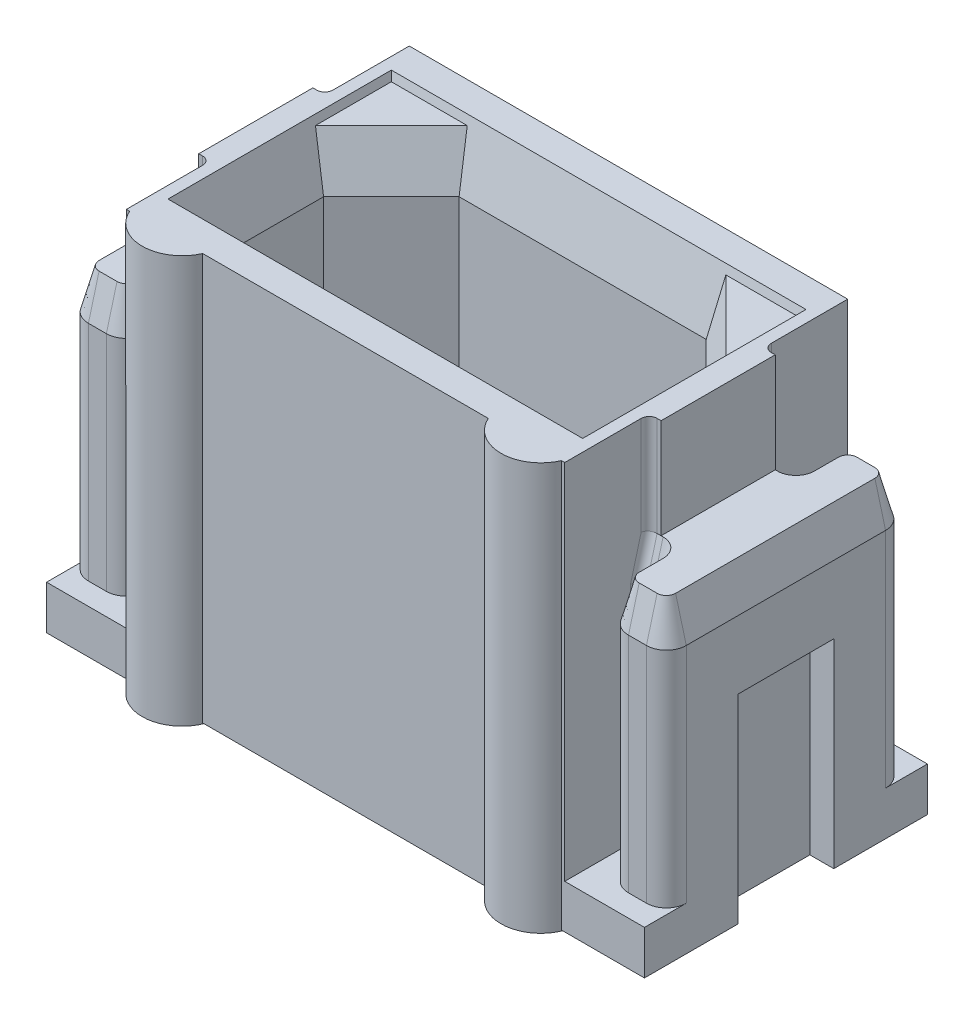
ISO-10303-21;
HEADER;
FILE_DESCRIPTION(('STEP AP214'),'2;1');
FILE_NAME('part.step','',(''),(''),'','','');
FILE_SCHEMA(('AUTOMOTIVE_DESIGN { 1 0 10303 214 1 1 1 1 }'));
ENDSEC;
DATA;
#1=APPLICATION_CONTEXT('core data for automotive mechanical design processes');
#2=APPLICATION_PROTOCOL_DEFINITION('international standard','automotive_design',2000,#1);
#3=PRODUCT_CONTEXT('',#1,'mechanical');
#4=PRODUCT('Part','Part','',(#3));
#5=PRODUCT_RELATED_PRODUCT_CATEGORY('part','',(#4));
#6=PRODUCT_DEFINITION_FORMATION('','',#4);
#7=PRODUCT_DEFINITION_CONTEXT('part definition',#1,'design');
#8=PRODUCT_DEFINITION('design','',#6,#7);
#9=PRODUCT_DEFINITION_SHAPE('','',#8);
#10=(LENGTH_UNIT() NAMED_UNIT(*) SI_UNIT(.MILLI.,.METRE.));
#11=(NAMED_UNIT(*) PLANE_ANGLE_UNIT() SI_UNIT($,.RADIAN.));
#12=(NAMED_UNIT(*) SI_UNIT($,.STERADIAN.) SOLID_ANGLE_UNIT());
#13=UNCERTAINTY_MEASURE_WITH_UNIT(LENGTH_MEASURE(1.E-05),#10,'distance_accuracy_value','');
#14=(GEOMETRIC_REPRESENTATION_CONTEXT(3) GLOBAL_UNCERTAINTY_ASSIGNED_CONTEXT((#13)) GLOBAL_UNIT_ASSIGNED_CONTEXT((#10,
#11,#12)) REPRESENTATION_CONTEXT('',''));
#15=CARTESIAN_POINT('',(0.,0.,0.));
#16=DIRECTION('',(0.,0.,1.));
#17=DIRECTION('',(1.,0.,0.));
#18=AXIS2_PLACEMENT_3D('',#15,#16,#17);
#19=CARTESIAN_POINT('',(-2.885679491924,3.85,1.420666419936));
#20=DIRECTION('',(0.,-1.,0.));
#21=DIRECTION('',(-1.,0.,0.));
#22=AXIS2_PLACEMENT_3D('',#19,#20,#21);
#23=PLANE('',#22);
#24=CARTESIAN_POINT('',(-2.925,3.8500000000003,-0.95));
#25=DIRECTION('',(0.,1.,0.));
#26=DIRECTION('',(0.,0.,1.));
#27=AXIS2_PLACEMENT_3D('',#24,#25,#26);
#28=CIRCLE('',#27,0.233974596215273);
#29=CARTESIAN_POINT('',(-3.15897459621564,3.8500000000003,-0.950000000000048));
#30=VERTEX_POINT('',#29);
#31=CARTESIAN_POINT('',(-2.92500000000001,3.85000000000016,-0.716025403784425));
#32=VERTEX_POINT('',#31);
#33=EDGE_CURVE('E1423',#30,#32,#28,.T.);
#34=ORIENTED_EDGE('',*,*,#33,.F.);
#35=DIRECTION('',(0.,0.,1.));
#36=VECTOR('',#35,1.);
#37=CARTESIAN_POINT('',(-3.158974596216,3.85,0.));
#38=LINE('',#37,#36);
#39=CARTESIAN_POINT('',(-3.15897459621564,3.8500000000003,-1.25000000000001));
#40=VERTEX_POINT('',#39);
#41=EDGE_CURVE('E1426',#40,#30,#38,.T.);
#42=ORIENTED_EDGE('',*,*,#41,.F.);
#43=CARTESIAN_POINT('',(-3.275,3.8500000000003,-1.25));
#44=DIRECTION('',(0.,-1.,0.));
#45=DIRECTION('',(0.,0.,-1.));
#46=AXIS2_PLACEMENT_3D('',#43,#44,#45);
#47=CIRCLE('',#46,0.116025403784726);
#48=CARTESIAN_POINT('',(-3.27499999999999,3.8500000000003,-1.36602540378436));
#49=VERTEX_POINT('',#48);
#50=EDGE_CURVE('E1429',#49,#40,#47,.T.);
#51=ORIENTED_EDGE('',*,*,#50,.F.);
#52=DIRECTION('',(1.,0.,0.));
#53=VECTOR('',#52,1.);
#54=CARTESIAN_POINT('',(-3.258012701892,3.85,-1.366025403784));
#55=LINE('',#54,#53);
#56=CARTESIAN_POINT('',(-3.50000000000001,3.8500000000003,-1.36602540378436));
#57=VERTEX_POINT('',#56);
#58=EDGE_CURVE('E1430',#57,#49,#55,.T.);
#59=ORIENTED_EDGE('',*,*,#58,.F.);
#60=CARTESIAN_POINT('',(-3.5,3.8500000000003,-1.25));
#61=DIRECTION('',(0.,-1.,0.));
#62=DIRECTION('',(0.,0.,-1.));
#63=AXIS2_PLACEMENT_3D('',#60,#61,#62);
#64=CIRCLE('',#63,0.116025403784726);
#65=CARTESIAN_POINT('',(-3.61602540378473,3.8500000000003,-1.25));
#66=VERTEX_POINT('',#65);
#67=EDGE_CURVE('E1433',#66,#57,#64,.T.);
#68=ORIENTED_EDGE('',*,*,#67,.F.);
#69=DIRECTION('',(0.,0.,1.));
#70=VECTOR('',#69,1.);
#71=CARTESIAN_POINT('',(-3.61602540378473,3.8500000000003,0.));
#72=LINE('',#71,#70);
#73=CARTESIAN_POINT('',(-3.61602540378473,3.8500000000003,1.25));
#74=VERTEX_POINT('',#73);
#75=EDGE_CURVE('E1293',#66,#74,#72,.T.);
#76=ORIENTED_EDGE('',*,*,#75,.T.);
#77=CARTESIAN_POINT('',(-3.5,3.8500000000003,1.25));
#78=DIRECTION('',(0.,-1.,0.));
#79=DIRECTION('',(0.,0.,-1.));
#80=AXIS2_PLACEMENT_3D('',#77,#78,#79);
#81=CIRCLE('',#80,0.116025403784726);
#82=CARTESIAN_POINT('',(-3.5,3.8500000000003,1.36602540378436));
#83=VERTEX_POINT('',#82);
#84=EDGE_CURVE('E1437',#83,#74,#81,.T.);
#85=ORIENTED_EDGE('',*,*,#84,.F.);
#86=DIRECTION('',(-1.,0.,0.));
#87=VECTOR('',#86,1.);
#88=CARTESIAN_POINT('',(-3.258012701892,3.85,1.366025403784));
#89=LINE('',#88,#87);
#90=CARTESIAN_POINT('',(-3.27500000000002,3.8500000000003,1.36602540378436));
#91=VERTEX_POINT('',#90);
#92=EDGE_CURVE('E1434',#91,#83,#89,.T.);
#93=ORIENTED_EDGE('',*,*,#92,.F.);
#94=CARTESIAN_POINT('',(-3.275,3.8500000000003,1.25));
#95=DIRECTION('',(0.,-1.,0.));
#96=DIRECTION('',(0.,0.,-1.));
#97=AXIS2_PLACEMENT_3D('',#94,#95,#96);
#98=CIRCLE('',#97,0.116025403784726);
#99=CARTESIAN_POINT('',(-3.15897459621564,3.8500000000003,1.25));
#100=VERTEX_POINT('',#99);
#101=EDGE_CURVE('E1438',#100,#91,#98,.T.);
#102=ORIENTED_EDGE('',*,*,#101,.F.);
#103=DIRECTION('',(0.,0.,1.));
#104=VECTOR('',#103,1.);
#105=CARTESIAN_POINT('',(-3.158974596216,3.85,0.));
#106=LINE('',#105,#104);
#107=CARTESIAN_POINT('',(-3.15897459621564,3.8500000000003,0.95));
#108=VERTEX_POINT('',#107);
#109=EDGE_CURVE('E1439',#108,#100,#106,.T.);
#110=ORIENTED_EDGE('',*,*,#109,.F.);
#111=CARTESIAN_POINT('',(-2.925,3.8500000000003,0.95));
#112=DIRECTION('',(0.,1.,0.));
#113=DIRECTION('',(0.,0.,1.));
#114=AXIS2_PLACEMENT_3D('',#111,#112,#113);
#115=CIRCLE('',#114,0.233974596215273);
#116=CARTESIAN_POINT('',(-2.925,3.85000000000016,0.716025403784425));
#117=VERTEX_POINT('',#116);
#118=EDGE_CURVE('E21',#117,#108,#115,.T.);
#119=ORIENTED_EDGE('',*,*,#118,.F.);
#120=DIRECTION('',(-1.,0.,0.));
#121=VECTOR('',#120,1.);
#122=CARTESIAN_POINT('',(-3.258012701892,3.85,0.7160254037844));
#123=LINE('',#122,#121);
#124=CARTESIAN_POINT('',(-2.9,3.85,0.7160254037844));
#125=VERTEX_POINT('',#124);
#126=EDGE_CURVE('E425',#125,#117,#123,.T.);
#127=ORIENTED_EDGE('',*,*,#126,.F.);
#128=DIRECTION('',(0.,0.,1.));
#129=VECTOR('',#128,1.);
#130=CARTESIAN_POINT('',(-2.9,3.85,0.));
#131=LINE('',#130,#129);
#132=CARTESIAN_POINT('',(-2.9,3.85,-0.716025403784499));
#133=VERTEX_POINT('',#132);
#134=EDGE_CURVE('E1443',#133,#125,#131,.T.);
#135=ORIENTED_EDGE('',*,*,#134,.F.);
#136=DIRECTION('',(1.,0.,0.));
#137=VECTOR('',#136,1.);
#138=CARTESIAN_POINT('',(-3.258012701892,3.85,-0.7160254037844));
#139=LINE('',#138,#137);
#140=EDGE_CURVE('E1406',#32,#133,#139,.T.);
#141=ORIENTED_EDGE('',*,*,#140,.F.);
#142=EDGE_LOOP('',(#34,#42,#51,#59,#68,#76,#85,#93,#102,#110,#119,#127,#135,#141));
#143=FACE_BOUND('',#142,.T.);
#144=ADVANCED_FACE('F17',(#143),#23,.F.);
#145=CARTESIAN_POINT('',(-3.45,2.601,-0.624));
#146=DIRECTION('',(-1.,0.,0.));
#147=DIRECTION('',(0.,-1.,0.));
#148=AXIS2_PLACEMENT_3D('',#145,#146,#147);
#149=PLANE('',#148);
#150=DIRECTION('',(0.,0.,1.));
#151=VECTOR('',#150,1.);
#152=CARTESIAN_POINT('',(-3.45000000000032,2.55000000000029,0.));
#153=LINE('',#152,#151);
#154=CARTESIAN_POINT('',(-3.45000000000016,2.55000000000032,-0.6));
#155=VERTEX_POINT('',#154);
#156=CARTESIAN_POINT('',(-3.45000000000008,2.55000000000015,0.6));
#157=VERTEX_POINT('',#156);
#158=EDGE_CURVE('E1314',#155,#157,#153,.T.);
#159=ORIENTED_EDGE('',*,*,#158,.F.);
#160=DIRECTION('',(0.,-1.,0.));
#161=VECTOR('',#160,1.);
#162=CARTESIAN_POINT('',(-3.45,1.275,-0.6));
#163=LINE('',#162,#161);
#164=CARTESIAN_POINT('',(-3.45,0.,-0.6));
#165=VERTEX_POINT('',#164);
#166=EDGE_CURVE('E1420',#155,#165,#163,.T.);
#167=ORIENTED_EDGE('',*,*,#166,.T.);
#168=DIRECTION('',(0.,0.,1.));
#169=VECTOR('',#168,1.);
#170=CARTESIAN_POINT('',(-3.45,0.,0.));
#171=LINE('',#170,#169);
#172=CARTESIAN_POINT('',(-3.45,0.,0.6));
#173=VERTEX_POINT('',#172);
#174=EDGE_CURVE('E1404',#165,#173,#171,.T.);
#175=ORIENTED_EDGE('',*,*,#174,.T.);
#176=DIRECTION('',(0.,-1.,0.));
#177=VECTOR('',#176,1.);
#178=CARTESIAN_POINT('',(-3.45,1.275,0.6));
#179=LINE('',#178,#177);
#180=EDGE_CURVE('E1267',#157,#173,#179,.T.);
#181=ORIENTED_EDGE('',*,*,#180,.F.);
#182=EDGE_LOOP('',(#159,#167,#175,#181));
#183=FACE_BOUND('',#182,.T.);
#184=ADVANCED_FACE('F2918',(#183),#149,.T.);
#185=CARTESIAN_POINT('',(2.885679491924,3.85,1.420666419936));
#186=DIRECTION('',(0.,1.,0.));
#187=DIRECTION('',(1.,0.,0.));
#188=AXIS2_PLACEMENT_3D('',#185,#186,#187);
#189=PLANE('',#188);
#190=CARTESIAN_POINT('',(2.925,3.85000000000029,-0.95));
#191=DIRECTION('',(0.,1.,0.));
#192=DIRECTION('',(0.,0.,1.));
#193=AXIS2_PLACEMENT_3D('',#190,#191,#192);
#194=CIRCLE('',#193,0.233974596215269);
#195=CARTESIAN_POINT('',(3.15897459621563,3.85000000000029,-0.950000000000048));
#196=VERTEX_POINT('',#195);
#197=CARTESIAN_POINT('',(2.92500000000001,3.85000000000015,-0.716025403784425));
#198=VERTEX_POINT('',#197);
#199=EDGE_CURVE('E1374',#196,#198,#194,.F.);
#200=ORIENTED_EDGE('',*,*,#199,.T.);
#201=DIRECTION('',(-1.,0.,0.));
#202=VECTOR('',#201,1.);
#203=CARTESIAN_POINT('',(3.258012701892,3.85,-0.7160254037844));
#204=LINE('',#203,#202);
#205=CARTESIAN_POINT('',(2.90000000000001,3.85,-0.7160254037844));
#206=VERTEX_POINT('',#205);
#207=EDGE_CURVE('E1360',#198,#206,#204,.T.);
#208=ORIENTED_EDGE('',*,*,#207,.T.);
#209=DIRECTION('',(0.,0.,1.));
#210=VECTOR('',#209,1.);
#211=CARTESIAN_POINT('',(2.9,3.85,0.));
#212=LINE('',#211,#210);
#213=CARTESIAN_POINT('',(2.9,3.85,0.716025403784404));
#214=VERTEX_POINT('',#213);
#215=EDGE_CURVE('E1392',#206,#214,#212,.T.);
#216=ORIENTED_EDGE('',*,*,#215,.T.);
#217=DIRECTION('',(1.,0.,0.));
#218=VECTOR('',#217,1.);
#219=CARTESIAN_POINT('',(3.258012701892,3.85,0.7160254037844));
#220=LINE('',#219,#218);
#221=CARTESIAN_POINT('',(2.925,3.85000000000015,0.716025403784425));
#222=VERTEX_POINT('',#221);
#223=EDGE_CURVE('E1390',#214,#222,#220,.T.);
#224=ORIENTED_EDGE('',*,*,#223,.T.);
#225=CARTESIAN_POINT('',(2.925,3.85000000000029,0.95));
#226=DIRECTION('',(0.,1.,0.));
#227=DIRECTION('',(0.,0.,1.));
#228=AXIS2_PLACEMENT_3D('',#225,#226,#227);
#229=CIRCLE('',#228,0.233974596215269);
#230=CARTESIAN_POINT('',(3.15897459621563,3.85000000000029,0.95));
#231=VERTEX_POINT('',#230);
#232=EDGE_CURVE('E1389',#222,#231,#229,.F.);
#233=ORIENTED_EDGE('',*,*,#232,.T.);
#234=DIRECTION('',(0.,0.,1.));
#235=VECTOR('',#234,1.);
#236=CARTESIAN_POINT('',(3.158974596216,3.85,0.));
#237=LINE('',#236,#235);
#238=CARTESIAN_POINT('',(3.15897459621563,3.85000000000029,1.25));
#239=VERTEX_POINT('',#238);
#240=EDGE_CURVE('E1387',#231,#239,#237,.T.);
#241=ORIENTED_EDGE('',*,*,#240,.T.);
#242=CARTESIAN_POINT('',(3.275,3.85000000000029,1.25));
#243=DIRECTION('',(0.,-1.,0.));
#244=DIRECTION('',(0.,0.,-1.));
#245=AXIS2_PLACEMENT_3D('',#242,#243,#244);
#246=CIRCLE('',#245,0.11602540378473);
#247=CARTESIAN_POINT('',(3.27500000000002,3.85000000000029,1.36602540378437));
#248=VERTEX_POINT('',#247);
#249=EDGE_CURVE('E1386',#239,#248,#246,.F.);
#250=ORIENTED_EDGE('',*,*,#249,.T.);
#251=DIRECTION('',(1.,0.,0.));
#252=VECTOR('',#251,1.);
#253=CARTESIAN_POINT('',(3.258012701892,3.85,1.366025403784));
#254=LINE('',#253,#252);
#255=CARTESIAN_POINT('',(3.5,3.85000000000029,1.36602540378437));
#256=VERTEX_POINT('',#255);
#257=EDGE_CURVE('E1383',#248,#256,#254,.T.);
#258=ORIENTED_EDGE('',*,*,#257,.T.);
#259=CARTESIAN_POINT('',(3.5,3.85000000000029,1.25));
#260=DIRECTION('',(0.,-1.,0.));
#261=DIRECTION('',(0.,0.,-1.));
#262=AXIS2_PLACEMENT_3D('',#259,#260,#261);
#263=CIRCLE('',#262,0.116025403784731);
#264=CARTESIAN_POINT('',(3.61602540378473,3.85000000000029,1.25));
#265=VERTEX_POINT('',#264);
#266=EDGE_CURVE('E1385',#256,#265,#263,.F.);
#267=ORIENTED_EDGE('',*,*,#266,.T.);
#268=DIRECTION('',(0.,0.,-1.));
#269=VECTOR('',#268,1.);
#270=CARTESIAN_POINT('',(3.61602540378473,3.8500000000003,0.));
#271=LINE('',#270,#269);
#272=CARTESIAN_POINT('',(3.61602540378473,3.85000000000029,-1.25));
#273=VERTEX_POINT('',#272);
#274=EDGE_CURVE('E1221',#265,#273,#271,.T.);
#275=ORIENTED_EDGE('',*,*,#274,.T.);
#276=CARTESIAN_POINT('',(3.5,3.85000000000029,-1.25));
#277=DIRECTION('',(0.,-1.,0.));
#278=DIRECTION('',(0.,0.,-1.));
#279=AXIS2_PLACEMENT_3D('',#276,#277,#278);
#280=CIRCLE('',#279,0.116025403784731);
#281=CARTESIAN_POINT('',(3.50000000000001,3.85000000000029,-1.36602540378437));
#282=VERTEX_POINT('',#281);
#283=EDGE_CURVE('E1382',#273,#282,#280,.F.);
#284=ORIENTED_EDGE('',*,*,#283,.T.);
#285=DIRECTION('',(-1.,0.,0.));
#286=VECTOR('',#285,1.);
#287=CARTESIAN_POINT('',(3.258012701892,3.85,-1.366025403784));
#288=LINE('',#287,#286);
#289=CARTESIAN_POINT('',(3.27499999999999,3.85000000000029,-1.36602540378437));
#290=VERTEX_POINT('',#289);
#291=EDGE_CURVE('E1380',#282,#290,#288,.T.);
#292=ORIENTED_EDGE('',*,*,#291,.T.);
#293=CARTESIAN_POINT('',(3.275,3.85000000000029,-1.25));
#294=DIRECTION('',(0.,-1.,0.));
#295=DIRECTION('',(0.,0.,-1.));
#296=AXIS2_PLACEMENT_3D('',#293,#294,#295);
#297=CIRCLE('',#296,0.11602540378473);
#298=CARTESIAN_POINT('',(3.15897459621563,3.85000000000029,-1.25000000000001));
#299=VERTEX_POINT('',#298);
#300=EDGE_CURVE('E1379',#290,#299,#297,.F.);
#301=ORIENTED_EDGE('',*,*,#300,.T.);
#302=DIRECTION('',(0.,0.,1.));
#303=VECTOR('',#302,1.);
#304=CARTESIAN_POINT('',(3.158974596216,3.85,0.));
#305=LINE('',#304,#303);
#306=EDGE_CURVE('E1377',#299,#196,#305,.T.);
#307=ORIENTED_EDGE('',*,*,#306,.T.);
#308=EDGE_LOOP('',(#200,#208,#216,#224,#233,#241,#250,#258,#267,#275,#284,#292,#301,#307));
#309=FACE_BOUND('',#308,.T.);
#310=ADVANCED_FACE('F2910',(#309),#189,.T.);
#311=CARTESIAN_POINT('',(3.45,2.601,-0.624));
#312=DIRECTION('',(-1.,0.,0.));
#313=DIRECTION('',(0.,-1.,0.));
#314=AXIS2_PLACEMENT_3D('',#311,#312,#313);
#315=PLANE('',#314);
#316=DIRECTION('',(0.,0.,1.));
#317=VECTOR('',#316,1.);
#318=CARTESIAN_POINT('',(3.45000000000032,2.55000000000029,0.));
#319=LINE('',#318,#317);
#320=CARTESIAN_POINT('',(3.45000000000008,2.55000000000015,-0.6));
#321=VERTEX_POINT('',#320);
#322=CARTESIAN_POINT('',(3.45000000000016,2.55000000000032,0.6));
#323=VERTEX_POINT('',#322);
#324=EDGE_CURVE('E1266',#321,#323,#319,.T.);
#325=ORIENTED_EDGE('',*,*,#324,.T.);
#326=DIRECTION('',(0.,-1.,0.));
#327=VECTOR('',#326,1.);
#328=CARTESIAN_POINT('',(3.45,1.275,0.6));
#329=LINE('',#328,#327);
#330=CARTESIAN_POINT('',(3.45,0.,0.6));
#331=VERTEX_POINT('',#330);
#332=EDGE_CURVE('E1353',#323,#331,#329,.T.);
#333=ORIENTED_EDGE('',*,*,#332,.T.);
#334=DIRECTION('',(0.,0.,1.));
#335=VECTOR('',#334,1.);
#336=CARTESIAN_POINT('',(3.45,0.,0.));
#337=LINE('',#336,#335);
#338=CARTESIAN_POINT('',(3.45,0.,-0.6));
#339=VERTEX_POINT('',#338);
#340=EDGE_CURVE('E1350',#339,#331,#337,.T.);
#341=ORIENTED_EDGE('',*,*,#340,.F.);
#342=DIRECTION('',(0.,-1.,0.));
#343=VECTOR('',#342,1.);
#344=CARTESIAN_POINT('',(3.45,1.275,-0.6));
#345=LINE('',#344,#343);
#346=EDGE_CURVE('E1244',#321,#339,#345,.T.);
#347=ORIENTED_EDGE('',*,*,#346,.F.);
#348=EDGE_LOOP('',(#325,#333,#341,#347));
#349=FACE_BOUND('',#348,.T.);
#350=ADVANCED_FACE('F2013',(#349),#315,.F.);
#351=CARTESIAN_POINT('',(-3.262986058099,0.494,1.5));
#352=DIRECTION('',(0.,0.,-1.));
#353=DIRECTION('',(-1.,0.,0.));
#354=AXIS2_PLACEMENT_3D('',#351,#352,#353);
#355=PLANE('',#354);
#356=DIRECTION('',(1.,0.,0.));
#357=VECTOR('',#356,1.);
#358=CARTESIAN_POINT('',(-3.3875,3.35,1.5));
#359=LINE('',#358,#357);
#360=CARTESIAN_POINT('',(-3.50000000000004,3.34999999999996,1.50000000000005));
#361=VERTEX_POINT('',#360);
#362=CARTESIAN_POINT('',(-3.27500000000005,3.35000000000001,1.50000000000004));
#363=VERTEX_POINT('',#362);
#364=EDGE_CURVE('E1334',#361,#363,#359,.T.);
#365=ORIENTED_EDGE('',*,*,#364,.F.);
#366=DIRECTION('',(0.,-1.,0.));
#367=VECTOR('',#366,1.);
#368=CARTESIAN_POINT('',(-3.50000000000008,1.95,1.5));
#369=LINE('',#368,#367);
#370=CARTESIAN_POINT('',(-3.50000000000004,0.550000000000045,1.5));
#371=VERTEX_POINT('',#370);
#372=EDGE_CURVE('E1281',#361,#371,#369,.T.);
#373=ORIENTED_EDGE('',*,*,#372,.T.);
#374=DIRECTION('',(-1.,0.,0.));
#375=VECTOR('',#374,1.);
#376=CARTESIAN_POINT('',(-3.3875,0.55,1.5));
#377=LINE('',#376,#375);
#378=CARTESIAN_POINT('',(-3.27500000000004,0.550000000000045,1.5));
#379=VERTEX_POINT('',#378);
#380=EDGE_CURVE('E1345',#379,#371,#377,.T.);
#381=ORIENTED_EDGE('',*,*,#380,.F.);
#382=DIRECTION('',(0.,1.,0.));
#383=VECTOR('',#382,1.);
#384=CARTESIAN_POINT('',(-3.27500000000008,1.95,1.5));
#385=LINE('',#384,#383);
#386=EDGE_CURVE('E1183',#379,#363,#385,.T.);
#387=ORIENTED_EDGE('',*,*,#386,.T.);
#388=EDGE_LOOP('',(#365,#373,#381,#387));
#389=FACE_BOUND('',#388,.T.);
#390=ADVANCED_FACE('F1705',(#389),#355,.F.);
#391=CARTESIAN_POINT('',(3.262986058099,0.494,1.5));
#392=DIRECTION('',(0.,0.,1.));
#393=DIRECTION('',(1.,0.,0.));
#394=AXIS2_PLACEMENT_3D('',#391,#392,#393);
#395=PLANE('',#394);
#396=DIRECTION('',(-1.,0.,0.));
#397=VECTOR('',#396,1.);
#398=CARTESIAN_POINT('',(3.3875,3.35,1.5));
#399=LINE('',#398,#397);
#400=CARTESIAN_POINT('',(3.50000000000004,3.34999999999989,1.50000000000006));
#401=VERTEX_POINT('',#400);
#402=CARTESIAN_POINT('',(3.27500000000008,3.34999999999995,1.50000000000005));
#403=VERTEX_POINT('',#402);
#404=EDGE_CURVE('E1328',#401,#403,#399,.T.);
#405=ORIENTED_EDGE('',*,*,#404,.T.);
#406=DIRECTION('',(0.,-1.,0.));
#407=VECTOR('',#406,1.);
#408=CARTESIAN_POINT('',(3.27500000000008,1.95,1.5));
#409=LINE('',#408,#407);
#410=CARTESIAN_POINT('',(3.27500000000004,0.550000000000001,1.5));
#411=VERTEX_POINT('',#410);
#412=EDGE_CURVE('E1169',#403,#411,#409,.T.);
#413=ORIENTED_EDGE('',*,*,#412,.T.);
#414=DIRECTION('',(1.,0.,0.));
#415=VECTOR('',#414,1.);
#416=CARTESIAN_POINT('',(3.3875,0.55,1.5));
#417=LINE('',#416,#415);
#418=CARTESIAN_POINT('',(3.50000000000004,0.550000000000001,1.5));
#419=VERTEX_POINT('',#418);
#420=EDGE_CURVE('E1330',#411,#419,#417,.T.);
#421=ORIENTED_EDGE('',*,*,#420,.T.);
#422=DIRECTION('',(0.,1.,0.));
#423=VECTOR('',#422,1.);
#424=CARTESIAN_POINT('',(3.50000000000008,1.95,1.5));
#425=LINE('',#424,#423);
#426=EDGE_CURVE('E1215',#419,#401,#425,.T.);
#427=ORIENTED_EDGE('',*,*,#426,.T.);
#428=EDGE_LOOP('',(#405,#413,#421,#427));
#429=FACE_BOUND('',#428,.T.);
#430=ADVANCED_FACE('F2887',(#429),#395,.T.);
#431=CARTESIAN_POINT('',(-3.761831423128,2.49501570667,-0.624));
#432=DIRECTION('',(0.173648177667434,-0.984807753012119,0.));
#433=DIRECTION('',(0.984807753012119,0.173648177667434,0.));
#434=AXIS2_PLACEMENT_3D('',#431,#432,#433);
#435=PLANE('',#434);
#436=ORIENTED_EDGE('',*,*,#158,.T.);
#437=DIRECTION('',(0.98480775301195,0.173648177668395,0.));
#438=VECTOR('',#437,1.);
#439=CARTESIAN_POINT('',(-3.75,2.497101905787,0.6));
#440=LINE('',#439,#438);
#441=CARTESIAN_POINT('',(-3.75,2.497101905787,0.6));
#442=VERTEX_POINT('',#441);
#443=EDGE_CURVE('E1401',#442,#157,#440,.T.);
#444=ORIENTED_EDGE('',*,*,#443,.F.);
#445=DIRECTION('',(0.,0.,-1.));
#446=VECTOR('',#445,1.);
#447=CARTESIAN_POINT('',(-3.75,2.497101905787,0.));
#448=LINE('',#447,#446);
#449=CARTESIAN_POINT('',(-3.75,2.49710190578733,-0.6));
#450=VERTEX_POINT('',#449);
#451=EDGE_CURVE('E1308',#442,#450,#448,.T.);
#452=ORIENTED_EDGE('',*,*,#451,.T.);
#453=DIRECTION('',(0.984807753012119,0.173648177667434,0.));
#454=VECTOR('',#453,1.);
#455=CARTESIAN_POINT('',(-3.761831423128,2.49501570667,-0.6));
#456=LINE('',#455,#454);
#457=EDGE_CURVE('E1313',#450,#155,#456,.T.);
#458=ORIENTED_EDGE('',*,*,#457,.T.);
#459=EDGE_LOOP('',(#436,#444,#452,#458));
#460=FACE_BOUND('',#459,.T.);
#461=ADVANCED_FACE('F1909',(#460),#435,.T.);
#462=CARTESIAN_POINT('',(-3.437986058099,-0.051,-0.6));
#463=DIRECTION('',(0.,0.,-1.));
#464=DIRECTION('',(-1.,0.,0.));
#465=AXIS2_PLACEMENT_3D('',#462,#463,#464);
#466=PLANE('',#465);
#467=ORIENTED_EDGE('',*,*,#457,.F.);
#468=DIRECTION('',(0.,-1.,0.));
#469=VECTOR('',#468,1.);
#470=CARTESIAN_POINT('',(-3.75,1.675,-0.599999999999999));
#471=LINE('',#470,#469);
#472=CARTESIAN_POINT('',(-3.75,0.,-0.6));
#473=VERTEX_POINT('',#472);
#474=EDGE_CURVE('E1303',#450,#473,#471,.T.);
#475=ORIENTED_EDGE('',*,*,#474,.T.);
#476=DIRECTION('',(-1.,0.,0.));
#477=VECTOR('',#476,1.);
#478=CARTESIAN_POINT('',(-3.6,0.,-0.6));
#479=LINE('',#478,#477);
#480=EDGE_CURVE('E1311',#165,#473,#479,.T.);
#481=ORIENTED_EDGE('',*,*,#480,.F.);
#482=ORIENTED_EDGE('',*,*,#166,.F.);
#483=EDGE_LOOP('',(#467,#475,#481,#482));
#484=FACE_BOUND('',#483,.T.);
#485=ADVANCED_FACE('F1906',(#484),#466,.F.);
#486=CARTESIAN_POINT('',(-3.612915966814,3.861604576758,-1.3));
#487=DIRECTION('',(0.965925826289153,-0.258819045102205,0.));
#488=DIRECTION('',(0.,0.,1.));
#489=AXIS2_PLACEMENT_3D('',#486,#487,#488);
#490=PLANE('',#489);
#491=DIRECTION('',(0.,0.,1.));
#492=VECTOR('',#491,1.);
#493=CARTESIAN_POINT('',(-3.75,3.35,0.));
#494=LINE('',#493,#492);
#495=CARTESIAN_POINT('',(-3.75000000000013,3.34999999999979,-1.25));
#496=VERTEX_POINT('',#495);
#497=CARTESIAN_POINT('',(-3.75000000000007,3.34999999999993,1.25));
#498=VERTEX_POINT('',#497);
#499=EDGE_CURVE('E1146',#496,#498,#494,.T.);
#500=ORIENTED_EDGE('',*,*,#499,.T.);
#501=DIRECTION('',(-0.258819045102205,-0.965925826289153,0.));
#502=VECTOR('',#501,1.);
#503=CARTESIAN_POINT('',(-3.6830127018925,3.6,1.25));
#504=LINE('',#503,#502);
#505=EDGE_CURVE('E1288',#74,#498,#504,.T.);
#506=ORIENTED_EDGE('',*,*,#505,.F.);
#507=ORIENTED_EDGE('',*,*,#75,.F.);
#508=DIRECTION('',(0.258819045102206,0.965925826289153,0.));
#509=VECTOR('',#508,1.);
#510=CARTESIAN_POINT('',(-3.6830127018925,3.6,-1.25));
#511=LINE('',#510,#509);
#512=EDGE_CURVE('E1285',#496,#66,#511,.T.);
#513=ORIENTED_EDGE('',*,*,#512,.F.);
#514=EDGE_LOOP('',(#500,#506,#507,#513));
#515=FACE_BOUND('',#514,.T.);
#516=ADVANCED_FACE('F1694',(#515),#490,.F.);
#517=CARTESIAN_POINT('',(-3.5,3.35,1.25));
#518=DIRECTION('',(0.,-1.,0.));
#519=DIRECTION('',(0.,0.,-1.));
#520=AXIS2_PLACEMENT_3D('',#517,#518,#519);
#521=CYLINDRICAL_SURFACE('',#520,0.25);
#522=CARTESIAN_POINT('',(-3.5,3.35,1.25));
#523=DIRECTION('',(0.,-1.,0.));
#524=DIRECTION('',(-1.,0.,0.));
#525=AXIS2_PLACEMENT_3D('',#522,#523,#524);
#526=CIRCLE('',#525,0.25);
#527=EDGE_CURVE('E1278',#498,#361,#526,.F.);
#528=ORIENTED_EDGE('',*,*,#527,.F.);
#529=DIRECTION('',(0.,-1.,0.));
#530=VECTOR('',#529,1.);
#531=CARTESIAN_POINT('',(-3.75,1.675,1.25));
#532=LINE('',#531,#530);
#533=CARTESIAN_POINT('',(-3.75,0.550000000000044,1.25));
#534=VERTEX_POINT('',#533);
#535=EDGE_CURVE('E1149',#498,#534,#532,.T.);
#536=ORIENTED_EDGE('',*,*,#535,.T.);
#537=CARTESIAN_POINT('',(-3.5,0.550000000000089,1.25));
#538=DIRECTION('',(0.,-1.,0.));
#539=DIRECTION('',(0.,0.,-1.));
#540=AXIS2_PLACEMENT_3D('',#537,#538,#539);
#541=CIRCLE('',#540,0.25);
#542=EDGE_CURVE('E1282',#371,#534,#541,.T.);
#543=ORIENTED_EDGE('',*,*,#542,.F.);
#544=ORIENTED_EDGE('',*,*,#372,.F.);
#545=EDGE_LOOP('',(#528,#536,#543,#544));
#546=FACE_BOUND('',#545,.T.);
#547=ADVANCED_FACE('F1704',(#546),#521,.T.);
#548=CARTESIAN_POINT('',(-3.437986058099,-0.051,0.6));
#549=DIRECTION('',(0.,0.,-1.));
#550=DIRECTION('',(-1.,0.,0.));
#551=AXIS2_PLACEMENT_3D('',#548,#549,#550);
#552=PLANE('',#551);
#553=ORIENTED_EDGE('',*,*,#180,.T.);
#554=DIRECTION('',(-1.,0.,0.));
#555=VECTOR('',#554,1.);
#556=CARTESIAN_POINT('',(-3.6,0.,0.6));
#557=LINE('',#556,#555);
#558=CARTESIAN_POINT('',(-3.75,0.,0.6));
#559=VERTEX_POINT('',#558);
#560=EDGE_CURVE('E1264',#173,#559,#557,.T.);
#561=ORIENTED_EDGE('',*,*,#560,.T.);
#562=DIRECTION('',(0.,1.,0.));
#563=VECTOR('',#562,1.);
#564=CARTESIAN_POINT('',(-3.75,1.675,0.6));
#565=LINE('',#564,#563);
#566=EDGE_CURVE('E1248',#559,#442,#565,.T.);
#567=ORIENTED_EDGE('',*,*,#566,.T.);
#568=ORIENTED_EDGE('',*,*,#443,.T.);
#569=EDGE_LOOP('',(#553,#561,#567,#568));
#570=FACE_BOUND('',#569,.T.);
#571=ADVANCED_FACE('F2021',(#570),#552,.T.);
#572=CARTESIAN_POINT('',(3.761831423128,2.49501570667,-0.624));
#573=DIRECTION('',(0.173648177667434,0.984807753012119,0.));
#574=DIRECTION('',(-0.984807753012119,0.173648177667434,0.));
#575=AXIS2_PLACEMENT_3D('',#572,#573,#574);
#576=PLANE('',#575);
#577=ORIENTED_EDGE('',*,*,#324,.F.);
#578=DIRECTION('',(-0.98480775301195,0.173648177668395,0.));
#579=VECTOR('',#578,1.);
#580=CARTESIAN_POINT('',(3.75,2.497101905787,-0.6));
#581=LINE('',#580,#579);
#582=CARTESIAN_POINT('',(3.75,2.497101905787,-0.6));
#583=VERTEX_POINT('',#582);
#584=EDGE_CURVE('E1352',#583,#321,#581,.T.);
#585=ORIENTED_EDGE('',*,*,#584,.F.);
#586=DIRECTION('',(0.,0.,-1.));
#587=VECTOR('',#586,1.);
#588=CARTESIAN_POINT('',(3.75,2.497101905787,0.));
#589=LINE('',#588,#587);
#590=CARTESIAN_POINT('',(3.75,2.49710190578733,0.6));
#591=VERTEX_POINT('',#590);
#592=EDGE_CURVE('E1239',#591,#583,#589,.T.);
#593=ORIENTED_EDGE('',*,*,#592,.F.);
#594=DIRECTION('',(-0.984807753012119,0.173648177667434,0.));
#595=VECTOR('',#594,1.);
#596=CARTESIAN_POINT('',(3.761831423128,2.49501570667,0.6));
#597=LINE('',#596,#595);
#598=EDGE_CURVE('E1198',#591,#323,#597,.T.);
#599=ORIENTED_EDGE('',*,*,#598,.T.);
#600=EDGE_LOOP('',(#577,#585,#593,#599));
#601=FACE_BOUND('',#600,.T.);
#602=ADVANCED_FACE('F2019',(#601),#576,.F.);
#603=CARTESIAN_POINT('',(3.437986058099,-0.051,-0.6));
#604=DIRECTION('',(0.,0.,1.));
#605=DIRECTION('',(1.,0.,0.));
#606=AXIS2_PLACEMENT_3D('',#603,#604,#605);
#607=PLANE('',#606);
#608=ORIENTED_EDGE('',*,*,#346,.T.);
#609=DIRECTION('',(1.,0.,0.));
#610=VECTOR('',#609,1.);
#611=CARTESIAN_POINT('',(3.6,0.,-0.6));
#612=LINE('',#611,#610);
#613=CARTESIAN_POINT('',(3.75,0.,-0.6));
#614=VERTEX_POINT('',#613);
#615=EDGE_CURVE('E1242',#339,#614,#612,.T.);
#616=ORIENTED_EDGE('',*,*,#615,.T.);
#617=DIRECTION('',(0.,-1.,0.));
#618=VECTOR('',#617,1.);
#619=CARTESIAN_POINT('',(3.75,1.675,-0.599999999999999));
#620=LINE('',#619,#618);
#621=EDGE_CURVE('E1234',#583,#614,#620,.T.);
#622=ORIENTED_EDGE('',*,*,#621,.F.);
#623=ORIENTED_EDGE('',*,*,#584,.T.);
#624=EDGE_LOOP('',(#608,#616,#622,#623));
#625=FACE_BOUND('',#624,.T.);
#626=ADVANCED_FACE('F2010',(#625),#607,.T.);
#627=CARTESIAN_POINT('',(3.612915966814,3.861604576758,1.3));
#628=DIRECTION('',(-0.965925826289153,-0.258819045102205,0.));
#629=DIRECTION('',(0.,0.,-1.));
#630=AXIS2_PLACEMENT_3D('',#627,#628,#629);
#631=PLANE('',#630);
#632=DIRECTION('',(0.,0.,1.));
#633=VECTOR('',#632,1.);
#634=CARTESIAN_POINT('',(3.75,3.35,0.));
#635=LINE('',#634,#633);
#636=CARTESIAN_POINT('',(3.75000000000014,3.34999999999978,-1.25));
#637=VERTEX_POINT('',#636);
#638=CARTESIAN_POINT('',(3.75000000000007,3.34999999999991,1.25));
#639=VERTEX_POINT('',#638);
#640=EDGE_CURVE('E1131',#637,#639,#635,.T.);
#641=ORIENTED_EDGE('',*,*,#640,.F.);
#642=DIRECTION('',(0.258819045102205,-0.965925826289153,0.));
#643=VECTOR('',#642,1.);
#644=CARTESIAN_POINT('',(3.6830127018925,3.6,-1.25));
#645=LINE('',#644,#643);
#646=EDGE_CURVE('E1218',#273,#637,#645,.T.);
#647=ORIENTED_EDGE('',*,*,#646,.F.);
#648=ORIENTED_EDGE('',*,*,#274,.F.);
#649=DIRECTION('',(-0.258819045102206,0.965925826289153,0.));
#650=VECTOR('',#649,1.);
#651=CARTESIAN_POINT('',(3.6830127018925,3.6,1.25));
#652=LINE('',#651,#650);
#653=EDGE_CURVE('E1220',#639,#265,#652,.T.);
#654=ORIENTED_EDGE('',*,*,#653,.F.);
#655=EDGE_LOOP('',(#641,#647,#648,#654));
#656=FACE_BOUND('',#655,.T.);
#657=ADVANCED_FACE('F2027',(#656),#631,.F.);
#658=CARTESIAN_POINT('',(3.5,0.550000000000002,1.25));
#659=DIRECTION('',(0.,1.,0.));
#660=DIRECTION('',(0.,0.,1.));
#661=AXIS2_PLACEMENT_3D('',#658,#659,#660);
#662=CYLINDRICAL_SURFACE('',#661,0.25);
#663=CARTESIAN_POINT('',(3.5,3.34999999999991,1.25));
#664=DIRECTION('',(0.,1.,0.));
#665=DIRECTION('',(1.,0.,0.));
#666=AXIS2_PLACEMENT_3D('',#663,#664,#665);
#667=CIRCLE('',#666,0.25);
#668=EDGE_CURVE('E1199',#401,#639,#667,.T.);
#669=ORIENTED_EDGE('',*,*,#668,.F.);
#670=ORIENTED_EDGE('',*,*,#426,.F.);
#671=CARTESIAN_POINT('',(3.5,0.550000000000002,1.25));
#672=DIRECTION('',(0.,1.,0.));
#673=DIRECTION('',(0.,0.,1.));
#674=AXIS2_PLACEMENT_3D('',#671,#672,#673);
#675=CIRCLE('',#674,0.25);
#676=CARTESIAN_POINT('',(3.75,0.550000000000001,1.25));
#677=VERTEX_POINT('',#676);
#678=EDGE_CURVE('E1226',#677,#419,#675,.F.);
#679=ORIENTED_EDGE('',*,*,#678,.F.);
#680=DIRECTION('',(0.,-1.,0.));
#681=VECTOR('',#680,1.);
#682=CARTESIAN_POINT('',(3.75,1.675,1.25));
#683=LINE('',#682,#681);
#684=EDGE_CURVE('E1134',#639,#677,#683,.T.);
#685=ORIENTED_EDGE('',*,*,#684,.F.);
#686=EDGE_LOOP('',(#669,#670,#679,#685));
#687=FACE_BOUND('',#686,.T.);
#688=ADVANCED_FACE('F2034',(#687),#662,.T.);
#689=CARTESIAN_POINT('',(3.437986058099,-0.051,0.6));
#690=DIRECTION('',(0.,0.,1.));
#691=DIRECTION('',(1.,0.,0.));
#692=AXIS2_PLACEMENT_3D('',#689,#690,#691);
#693=PLANE('',#692);
#694=ORIENTED_EDGE('',*,*,#598,.F.);
#695=DIRECTION('',(0.,1.,0.));
#696=VECTOR('',#695,1.);
#697=CARTESIAN_POINT('',(3.75,1.675,0.6));
#698=LINE('',#697,#696);
#699=CARTESIAN_POINT('',(3.75,0.,0.6));
#700=VERTEX_POINT('',#699);
#701=EDGE_CURVE('E1126',#700,#591,#698,.T.);
#702=ORIENTED_EDGE('',*,*,#701,.F.);
#703=DIRECTION('',(1.,0.,0.));
#704=VECTOR('',#703,1.);
#705=CARTESIAN_POINT('',(3.6,0.,0.6));
#706=LINE('',#705,#704);
#707=EDGE_CURVE('E1195',#331,#700,#706,.T.);
#708=ORIENTED_EDGE('',*,*,#707,.F.);
#709=ORIENTED_EDGE('',*,*,#332,.F.);
#710=EDGE_LOOP('',(#694,#702,#708,#709));
#711=FACE_BOUND('',#710,.T.);
#712=ADVANCED_FACE('F2017',(#711),#693,.F.);
#713=CARTESIAN_POINT('',(-3.275,3.35,1.25));
#714=DIRECTION('',(0.,-1.,0.));
#715=DIRECTION('',(0.,0.,-1.));
#716=AXIS2_PLACEMENT_3D('',#713,#714,#715);
#717=CYLINDRICAL_SURFACE('',#716,0.25);
#718=CARTESIAN_POINT('',(-3.275,3.35,1.25));
#719=DIRECTION('',(0.,-1.,0.));
#720=DIRECTION('',(-1.,0.,0.));
#721=AXIS2_PLACEMENT_3D('',#718,#719,#720);
#722=CIRCLE('',#721,0.249999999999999);
#723=CARTESIAN_POINT('',(-3.02499999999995,3.35000000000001,1.25000000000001));
#724=VERTEX_POINT('',#723);
#725=EDGE_CURVE('E1181',#363,#724,#722,.F.);
#726=ORIENTED_EDGE('',*,*,#725,.F.);
#727=ORIENTED_EDGE('',*,*,#386,.F.);
#728=CARTESIAN_POINT('',(-3.275,0.550000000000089,1.25));
#729=DIRECTION('',(0.,-1.,0.));
#730=DIRECTION('',(0.,0.,-1.));
#731=AXIS2_PLACEMENT_3D('',#728,#729,#730);
#732=CIRCLE('',#731,0.25);
#733=CARTESIAN_POINT('',(-3.025,0.550000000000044,1.25));
#734=VERTEX_POINT('',#733);
#735=EDGE_CURVE('E1341',#734,#379,#732,.T.);
#736=ORIENTED_EDGE('',*,*,#735,.F.);
#737=DIRECTION('',(0.,1.,0.));
#738=VECTOR('',#737,1.);
#739=CARTESIAN_POINT('',(-3.025,1.95,1.25));
#740=LINE('',#739,#738);
#741=EDGE_CURVE('E1116',#734,#724,#740,.T.);
#742=ORIENTED_EDGE('',*,*,#741,.T.);
#743=EDGE_LOOP('',(#726,#727,#736,#742));
#744=FACE_BOUND('',#743,.T.);
#745=ADVANCED_FACE('F1634',(#744),#717,.T.);
#746=CARTESIAN_POINT('',(3.275,0.550000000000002,1.25));
#747=DIRECTION('',(0.,1.,0.));
#748=DIRECTION('',(0.,0.,1.));
#749=AXIS2_PLACEMENT_3D('',#746,#747,#748);
#750=CYLINDRICAL_SURFACE('',#749,0.25);
#751=CARTESIAN_POINT('',(3.275,3.34999999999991,1.25));
#752=DIRECTION('',(0.,1.,0.));
#753=DIRECTION('',(1.,0.,0.));
#754=AXIS2_PLACEMENT_3D('',#751,#752,#753);
#755=CIRCLE('',#754,0.25);
#756=CARTESIAN_POINT('',(3.02499999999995,3.34999999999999,1.25000000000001));
#757=VERTEX_POINT('',#756);
#758=EDGE_CURVE('E1166',#757,#403,#755,.T.);
#759=ORIENTED_EDGE('',*,*,#758,.F.);
#760=DIRECTION('',(0.,1.,0.));
#761=VECTOR('',#760,1.);
#762=CARTESIAN_POINT('',(3.025,1.95,1.25));
#763=LINE('',#762,#761);
#764=CARTESIAN_POINT('',(3.025,0.550000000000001,1.25));
#765=VERTEX_POINT('',#764);
#766=EDGE_CURVE('E1104',#765,#757,#763,.T.);
#767=ORIENTED_EDGE('',*,*,#766,.F.);
#768=CARTESIAN_POINT('',(3.275,0.550000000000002,1.25));
#769=DIRECTION('',(0.,1.,0.));
#770=DIRECTION('',(0.,0.,1.));
#771=AXIS2_PLACEMENT_3D('',#768,#769,#770);
#772=CIRCLE('',#771,0.25);
#773=EDGE_CURVE('E1170',#411,#765,#772,.F.);
#774=ORIENTED_EDGE('',*,*,#773,.F.);
#775=ORIENTED_EDGE('',*,*,#412,.F.);
#776=EDGE_LOOP('',(#759,#767,#774,#775));
#777=FACE_BOUND('',#776,.T.);
#778=ADVANCED_FACE('F2040',(#777),#750,.T.);
#779=CARTESIAN_POINT('',(-3.75,-0.067,1.846));
#780=DIRECTION('',(1.,0.,0.));
#781=DIRECTION('',(0.,0.,-1.));
#782=AXIS2_PLACEMENT_3D('',#779,#780,#781);
#783=PLANE('',#782);
#784=DIRECTION('',(0.,0.,-1.));
#785=VECTOR('',#784,1.);
#786=CARTESIAN_POINT('',(-3.75,0.,0.));
#787=LINE('',#786,#785);
#788=CARTESIAN_POINT('',(-3.75,0.,1.775));
#789=VERTEX_POINT('',#788);
#790=EDGE_CURVE('E1252',#789,#559,#787,.T.);
#791=ORIENTED_EDGE('',*,*,#790,.F.);
#792=DIRECTION('',(0.,-1.,0.));
#793=VECTOR('',#792,1.);
#794=CARTESIAN_POINT('',(-3.75,1.675,1.775));
#795=LINE('',#794,#793);
#796=CARTESIAN_POINT('',(-3.75,0.549999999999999,1.775));
#797=VERTEX_POINT('',#796);
#798=EDGE_CURVE('E1249',#797,#789,#795,.T.);
#799=ORIENTED_EDGE('',*,*,#798,.F.);
#800=DIRECTION('',(0.,0.,1.));
#801=VECTOR('',#800,1.);
#802=CARTESIAN_POINT('',(-3.75,0.549999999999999,0.));
#803=LINE('',#802,#801);
#804=EDGE_CURVE('E1253',#534,#797,#803,.T.);
#805=ORIENTED_EDGE('',*,*,#804,.F.);
#806=ORIENTED_EDGE('',*,*,#535,.F.);
#807=ORIENTED_EDGE('',*,*,#499,.F.);
#808=DIRECTION('',(0.,-1.,0.));
#809=VECTOR('',#808,1.);
#810=CARTESIAN_POINT('',(-3.75,1.95,-1.25));
#811=LINE('',#810,#809);
#812=CARTESIAN_POINT('',(-3.75,0.550000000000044,-1.25));
#813=VERTEX_POINT('',#812);
#814=EDGE_CURVE('E1083',#496,#813,#811,.T.);
#815=ORIENTED_EDGE('',*,*,#814,.T.);
#816=DIRECTION('',(0.,0.,1.));
#817=VECTOR('',#816,1.);
#818=CARTESIAN_POINT('',(-3.75,0.549999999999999,0.));
#819=LINE('',#818,#817);
#820=CARTESIAN_POINT('',(-3.75,0.549999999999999,-1.775));
#821=VERTEX_POINT('',#820);
#822=EDGE_CURVE('E1150',#821,#813,#819,.T.);
#823=ORIENTED_EDGE('',*,*,#822,.F.);
#824=DIRECTION('',(0.,1.,0.));
#825=VECTOR('',#824,1.);
#826=CARTESIAN_POINT('',(-3.75,1.675,-1.775));
#827=LINE('',#826,#825);
#828=CARTESIAN_POINT('',(-3.75,0.,-1.775));
#829=VERTEX_POINT('',#828);
#830=EDGE_CURVE('E1155',#829,#821,#827,.T.);
#831=ORIENTED_EDGE('',*,*,#830,.F.);
#832=DIRECTION('',(0.,0.,-1.));
#833=VECTOR('',#832,1.);
#834=CARTESIAN_POINT('',(-3.75,0.,0.));
#835=LINE('',#834,#833);
#836=EDGE_CURVE('E1298',#473,#829,#835,.T.);
#837=ORIENTED_EDGE('',*,*,#836,.F.);
#838=ORIENTED_EDGE('',*,*,#474,.F.);
#839=ORIENTED_EDGE('',*,*,#451,.F.);
#840=ORIENTED_EDGE('',*,*,#566,.F.);
#841=EDGE_LOOP('',(#791,#799,#805,#806,#807,#815,#823,#831,#837,#838,#839,#840));
#842=FACE_BOUND('',#841,.T.);
#843=ADVANCED_FACE('F1701',(#842),#783,.F.);
#844=CARTESIAN_POINT('',(3.75,-0.067,1.846));
#845=DIRECTION('',(1.,0.,0.));
#846=DIRECTION('',(0.,0.,-1.));
#847=AXIS2_PLACEMENT_3D('',#844,#845,#846);
#848=PLANE('',#847);
#849=DIRECTION('',(0.,0.,-1.));
#850=VECTOR('',#849,1.);
#851=CARTESIAN_POINT('',(3.75,0.,0.));
#852=LINE('',#851,#850);
#853=CARTESIAN_POINT('',(3.75,0.,1.775));
#854=VERTEX_POINT('',#853);
#855=EDGE_CURVE('E1188',#854,#700,#852,.T.);
#856=ORIENTED_EDGE('',*,*,#855,.T.);
#857=ORIENTED_EDGE('',*,*,#701,.T.);
#858=ORIENTED_EDGE('',*,*,#592,.T.);
#859=ORIENTED_EDGE('',*,*,#621,.T.);
#860=DIRECTION('',(0.,0.,-1.));
#861=VECTOR('',#860,1.);
#862=CARTESIAN_POINT('',(3.75,0.,0.));
#863=LINE('',#862,#861);
#864=CARTESIAN_POINT('',(3.75,0.,-1.775));
#865=VERTEX_POINT('',#864);
#866=EDGE_CURVE('E1230',#614,#865,#863,.T.);
#867=ORIENTED_EDGE('',*,*,#866,.T.);
#868=DIRECTION('',(0.,1.,0.));
#869=VECTOR('',#868,1.);
#870=CARTESIAN_POINT('',(3.75,1.675,-1.775));
#871=LINE('',#870,#869);
#872=CARTESIAN_POINT('',(3.75,0.55,-1.775));
#873=VERTEX_POINT('',#872);
#874=EDGE_CURVE('E1139',#865,#873,#871,.T.);
#875=ORIENTED_EDGE('',*,*,#874,.T.);
#876=DIRECTION('',(0.,0.,1.));
#877=VECTOR('',#876,1.);
#878=CARTESIAN_POINT('',(3.75,0.549999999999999,0.));
#879=LINE('',#878,#877);
#880=CARTESIAN_POINT('',(3.75,0.550000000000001,-1.25));
#881=VERTEX_POINT('',#880);
#882=EDGE_CURVE('E1135',#873,#881,#879,.T.);
#883=ORIENTED_EDGE('',*,*,#882,.T.);
#884=DIRECTION('',(0.,1.,0.));
#885=VECTOR('',#884,1.);
#886=CARTESIAN_POINT('',(3.75,1.95,-1.25));
#887=LINE('',#886,#885);
#888=EDGE_CURVE('E1072',#881,#637,#887,.T.);
#889=ORIENTED_EDGE('',*,*,#888,.T.);
#890=ORIENTED_EDGE('',*,*,#640,.T.);
#891=ORIENTED_EDGE('',*,*,#684,.T.);
#892=DIRECTION('',(0.,0.,1.));
#893=VECTOR('',#892,1.);
#894=CARTESIAN_POINT('',(3.75,0.549999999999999,0.));
#895=LINE('',#894,#893);
#896=CARTESIAN_POINT('',(3.75,0.549999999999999,1.775));
#897=VERTEX_POINT('',#896);
#898=EDGE_CURVE('E1189',#677,#897,#895,.T.);
#899=ORIENTED_EDGE('',*,*,#898,.T.);
#900=DIRECTION('',(0.,-1.,0.));
#901=VECTOR('',#900,1.);
#902=CARTESIAN_POINT('',(3.75,1.675,1.775));
#903=LINE('',#902,#901);
#904=EDGE_CURVE('E1186',#897,#854,#903,.T.);
#905=ORIENTED_EDGE('',*,*,#904,.T.);
#906=EDGE_LOOP('',(#856,#857,#858,#859,#867,#875,#883,#889,#890,#891,#899,#905));
#907=FACE_BOUND('',#906,.T.);
#908=ADVANCED_FACE('F2005',(#907),#848,.T.);
#909=CARTESIAN_POINT('',(-3.025,0.494,0.937986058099));
#910=DIRECTION('',(-1.,0.,0.));
#911=DIRECTION('',(0.,0.,1.));
#912=AXIS2_PLACEMENT_3D('',#909,#910,#911);
#913=PLANE('',#912);
#914=DIRECTION('',(0.,0.,-1.));
#915=VECTOR('',#914,1.);
#916=CARTESIAN_POINT('',(-3.025,3.35,1.1));
#917=LINE('',#916,#915);
#918=CARTESIAN_POINT('',(-3.02499999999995,3.35000000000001,0.95));
#919=VERTEX_POINT('',#918);
#920=EDGE_CURVE('E1109',#724,#919,#917,.T.);
#921=ORIENTED_EDGE('',*,*,#920,.F.);
#922=ORIENTED_EDGE('',*,*,#741,.F.);
#923=DIRECTION('',(0.,0.,1.));
#924=VECTOR('',#923,1.);
#925=CARTESIAN_POINT('',(-3.025,0.55,1.1));
#926=LINE('',#925,#924);
#927=CARTESIAN_POINT('',(-3.025,0.550000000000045,0.950000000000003));
#928=VERTEX_POINT('',#927);
#929=EDGE_CURVE('E1123',#928,#734,#926,.T.);
#930=ORIENTED_EDGE('',*,*,#929,.F.);
#931=DIRECTION('',(0.,-1.,0.));
#932=VECTOR('',#931,1.);
#933=CARTESIAN_POINT('',(-3.025,1.95,0.95));
#934=LINE('',#933,#932);
#935=EDGE_CURVE('E1057',#919,#928,#934,.T.);
#936=ORIENTED_EDGE('',*,*,#935,.F.);
#937=EDGE_LOOP('',(#921,#922,#930,#936));
#938=FACE_BOUND('',#937,.T.);
#939=ADVANCED_FACE('F1639',(#938),#913,.F.);
#940=CARTESIAN_POINT('',(3.025,0.494,0.937986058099));
#941=DIRECTION('',(-1.,0.,0.));
#942=DIRECTION('',(0.,0.,1.));
#943=AXIS2_PLACEMENT_3D('',#940,#941,#942);
#944=PLANE('',#943);
#945=DIRECTION('',(0.,0.,-1.));
#946=VECTOR('',#945,1.);
#947=CARTESIAN_POINT('',(3.025,3.35,1.1));
#948=LINE('',#947,#946);
#949=CARTESIAN_POINT('',(3.02499999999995,3.34999999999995,0.949999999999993));
#950=VERTEX_POINT('',#949);
#951=EDGE_CURVE('E1101',#757,#950,#948,.T.);
#952=ORIENTED_EDGE('',*,*,#951,.T.);
#953=DIRECTION('',(0.,1.,0.));
#954=VECTOR('',#953,1.);
#955=CARTESIAN_POINT('',(3.025,1.95,0.95));
#956=LINE('',#955,#954);
#957=CARTESIAN_POINT('',(3.025,0.550000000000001,0.95));
#958=VERTEX_POINT('',#957);
#959=EDGE_CURVE('E1043',#958,#950,#956,.T.);
#960=ORIENTED_EDGE('',*,*,#959,.F.);
#961=DIRECTION('',(0.,0.,1.));
#962=VECTOR('',#961,1.);
#963=CARTESIAN_POINT('',(3.025,0.55,1.1));
#964=LINE('',#963,#962);
#965=EDGE_CURVE('E1107',#958,#765,#964,.T.);
#966=ORIENTED_EDGE('',*,*,#965,.T.);
#967=ORIENTED_EDGE('',*,*,#766,.T.);
#968=EDGE_LOOP('',(#952,#960,#966,#967));
#969=FACE_BOUND('',#968,.T.);
#970=ADVANCED_FACE('F2045',(#969),#944,.T.);
#971=CARTESIAN_POINT('',(-3.5,3.35,-1.25));
#972=DIRECTION('',(0.,-1.,0.));
#973=DIRECTION('',(0.,0.,-1.));
#974=AXIS2_PLACEMENT_3D('',#971,#972,#973);
#975=CYLINDRICAL_SURFACE('',#974,0.25);
#976=CARTESIAN_POINT('',(-3.5,3.34999999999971,-1.25));
#977=DIRECTION('',(0.,-1.,0.));
#978=DIRECTION('',(-1.,0.,0.));
#979=AXIS2_PLACEMENT_3D('',#976,#977,#978);
#980=CIRCLE('',#979,0.25000000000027);
#981=CARTESIAN_POINT('',(-3.50000000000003,3.34999999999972,-1.5000000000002));
#982=VERTEX_POINT('',#981);
#983=EDGE_CURVE('E1079',#496,#982,#980,.T.);
#984=ORIENTED_EDGE('',*,*,#983,.T.);
#985=DIRECTION('',(0.,-1.,0.));
#986=VECTOR('',#985,1.);
#987=CARTESIAN_POINT('',(-3.50000000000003,1.95,-1.5));
#988=LINE('',#987,#986);
#989=CARTESIAN_POINT('',(-3.50000000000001,0.550000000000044,-1.5));
#990=VERTEX_POINT('',#989);
#991=EDGE_CURVE('E1024',#982,#990,#988,.T.);
#992=ORIENTED_EDGE('',*,*,#991,.T.);
#993=CARTESIAN_POINT('',(-3.5,0.550000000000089,-1.25));
#994=DIRECTION('',(0.,-1.,0.));
#995=DIRECTION('',(0.,0.,-1.));
#996=AXIS2_PLACEMENT_3D('',#993,#994,#995);
#997=CIRCLE('',#996,0.25);
#998=EDGE_CURVE('E1103',#813,#990,#997,.T.);
#999=ORIENTED_EDGE('',*,*,#998,.F.);
#1000=ORIENTED_EDGE('',*,*,#814,.F.);
#1001=EDGE_LOOP('',(#984,#992,#999,#1000));
#1002=FACE_BOUND('',#1001,.T.);
#1003=ADVANCED_FACE('F1892',(#1002),#975,.T.);
#1004=CARTESIAN_POINT('',(-3.5,3.8500000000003,-1.25));
#1005=DIRECTION('',(0.,-1.,0.));
#1006=DIRECTION('',(0.,0.,-1.));
#1007=AXIS2_PLACEMENT_3D('',#1004,#1005,#1006);
#1008=CONICAL_SURFACE('',#1007,0.116025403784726,0.261799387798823);
#1009=ORIENTED_EDGE('',*,*,#983,.F.);
#1010=ORIENTED_EDGE('',*,*,#512,.T.);
#1011=ORIENTED_EDGE('',*,*,#67,.T.);
#1012=DIRECTION('',(0.,0.965925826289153,0.258819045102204));
#1013=VECTOR('',#1012,1.);
#1014=CARTESIAN_POINT('',(-3.50000000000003,3.6,-1.4330127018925));
#1015=LINE('',#1014,#1013);
#1016=EDGE_CURVE('E1023',#982,#57,#1015,.T.);
#1017=ORIENTED_EDGE('',*,*,#1016,.F.);
#1018=EDGE_LOOP('',(#1009,#1010,#1011,#1017));
#1019=FACE_BOUND('',#1018,.T.);
#1020=ADVANCED_FACE('F1690',(#1019),#1008,.T.);
#1021=CARTESIAN_POINT('',(-3.5,3.8500000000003,1.25));
#1022=DIRECTION('',(0.,-1.,0.));
#1023=DIRECTION('',(0.,0.,-1.));
#1024=AXIS2_PLACEMENT_3D('',#1021,#1022,#1023);
#1025=CONICAL_SURFACE('',#1024,0.116025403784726,0.261799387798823);
#1026=ORIENTED_EDGE('',*,*,#527,.T.);
#1027=DIRECTION('',(0.,-0.965925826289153,0.258819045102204));
#1028=VECTOR('',#1027,1.);
#1029=CARTESIAN_POINT('',(-3.5,3.6,1.4330127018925));
#1030=LINE('',#1029,#1028);
#1031=EDGE_CURVE('E1088',#83,#361,#1030,.T.);
#1032=ORIENTED_EDGE('',*,*,#1031,.F.);
#1033=ORIENTED_EDGE('',*,*,#84,.T.);
#1034=ORIENTED_EDGE('',*,*,#505,.T.);
#1035=EDGE_LOOP('',(#1026,#1032,#1033,#1034));
#1036=FACE_BOUND('',#1035,.T.);
#1037=ADVANCED_FACE('F1698',(#1036),#1025,.T.);
#1038=CARTESIAN_POINT('',(3.5,3.3499999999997,1.25));
#1039=DIRECTION('',(0.,-1.,0.));
#1040=DIRECTION('',(0.,0.,-1.));
#1041=AXIS2_PLACEMENT_3D('',#1038,#1039,#1040);
#1042=CONICAL_SURFACE('',#1041,0.250000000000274,0.261799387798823);
#1043=ORIENTED_EDGE('',*,*,#668,.T.);
#1044=ORIENTED_EDGE('',*,*,#653,.T.);
#1045=ORIENTED_EDGE('',*,*,#266,.F.);
#1046=DIRECTION('',(0.,-0.965925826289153,0.258819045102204));
#1047=VECTOR('',#1046,1.);
#1048=CARTESIAN_POINT('',(3.5,3.6,1.4330127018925));
#1049=LINE('',#1048,#1047);
#1050=EDGE_CURVE('E1010',#256,#401,#1049,.T.);
#1051=ORIENTED_EDGE('',*,*,#1050,.T.);
#1052=EDGE_LOOP('',(#1043,#1044,#1045,#1051));
#1053=FACE_BOUND('',#1052,.T.);
#1054=ADVANCED_FACE('F2762',(#1053),#1042,.T.);
#1055=CARTESIAN_POINT('',(3.5,0.550000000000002,-1.25));
#1056=DIRECTION('',(0.,1.,0.));
#1057=DIRECTION('',(0.,0.,1.));
#1058=AXIS2_PLACEMENT_3D('',#1055,#1056,#1057);
#1059=CYLINDRICAL_SURFACE('',#1058,0.25);
#1060=CARTESIAN_POINT('',(3.5,3.3499999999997,-1.25));
#1061=DIRECTION('',(0.,1.,0.));
#1062=DIRECTION('',(1.,0.,0.));
#1063=AXIS2_PLACEMENT_3D('',#1060,#1061,#1062);
#1064=CIRCLE('',#1063,0.250000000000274);
#1065=CARTESIAN_POINT('',(3.50000000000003,3.34999999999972,-1.5000000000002));
#1066=VERTEX_POINT('',#1065);
#1067=EDGE_CURVE('E1069',#1066,#637,#1064,.F.);
#1068=ORIENTED_EDGE('',*,*,#1067,.T.);
#1069=ORIENTED_EDGE('',*,*,#888,.F.);
#1070=CARTESIAN_POINT('',(3.5,0.550000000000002,-1.25));
#1071=DIRECTION('',(0.,1.,0.));
#1072=DIRECTION('',(0.,0.,1.));
#1073=AXIS2_PLACEMENT_3D('',#1070,#1071,#1072);
#1074=CIRCLE('',#1073,0.25);
#1075=CARTESIAN_POINT('',(3.50000000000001,0.550000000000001,-1.5));
#1076=VERTEX_POINT('',#1075);
#1077=EDGE_CURVE('E1082',#1076,#881,#1074,.F.);
#1078=ORIENTED_EDGE('',*,*,#1077,.F.);
#1079=DIRECTION('',(0.,-1.,0.));
#1080=VECTOR('',#1079,1.);
#1081=CARTESIAN_POINT('',(3.50000000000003,1.95,-1.5));
#1082=LINE('',#1081,#1080);
#1083=EDGE_CURVE('E1005',#1066,#1076,#1082,.T.);
#1084=ORIENTED_EDGE('',*,*,#1083,.F.);
#1085=EDGE_LOOP('',(#1068,#1069,#1078,#1084));
#1086=FACE_BOUND('',#1085,.T.);
#1087=ADVANCED_FACE('F2753',(#1086),#1059,.T.);
#1088=CARTESIAN_POINT('',(3.5,3.3499999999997,-1.25));
#1089=DIRECTION('',(0.,-1.,0.));
#1090=DIRECTION('',(0.,0.,-1.));
#1091=AXIS2_PLACEMENT_3D('',#1088,#1089,#1090);
#1092=CONICAL_SURFACE('',#1091,0.250000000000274,0.261799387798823);
#1093=ORIENTED_EDGE('',*,*,#1067,.F.);
#1094=DIRECTION('',(0.,0.965925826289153,0.258819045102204));
#1095=VECTOR('',#1094,1.);
#1096=CARTESIAN_POINT('',(3.50000000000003,3.6,-1.4330127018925));
#1097=LINE('',#1096,#1095);
#1098=EDGE_CURVE('E988',#1066,#282,#1097,.T.);
#1099=ORIENTED_EDGE('',*,*,#1098,.T.);
#1100=ORIENTED_EDGE('',*,*,#283,.F.);
#1101=ORIENTED_EDGE('',*,*,#646,.T.);
#1102=EDGE_LOOP('',(#1093,#1099,#1100,#1101));
#1103=FACE_BOUND('',#1102,.T.);
#1104=ADVANCED_FACE('F2745',(#1103),#1092,.T.);
#1105=CARTESIAN_POINT('',(-2.925,3.35,0.95));
#1106=DIRECTION('',(0.,-1.,0.));
#1107=DIRECTION('',(0.,0.,-1.));
#1108=AXIS2_PLACEMENT_3D('',#1105,#1106,#1107);
#1109=CYLINDRICAL_SURFACE('',#1108,0.0999999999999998);
#1110=CARTESIAN_POINT('',(-2.925,3.35,0.95));
#1111=DIRECTION('',(0.,-1.,0.));
#1112=DIRECTION('',(-1.,0.,0.));
#1113=AXIS2_PLACEMENT_3D('',#1110,#1111,#1112);
#1114=CIRCLE('',#1113,0.0999999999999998);
#1115=CARTESIAN_POINT('',(-2.925,3.34999999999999,0.849999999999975));
#1116=VERTEX_POINT('',#1115);
#1117=EDGE_CURVE('E1055',#1116,#919,#1114,.F.);
#1118=ORIENTED_EDGE('',*,*,#1117,.T.);
#1119=ORIENTED_EDGE('',*,*,#935,.T.);
#1120=CARTESIAN_POINT('',(-2.925,0.550000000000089,0.950000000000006));
#1121=DIRECTION('',(0.,-1.,0.));
#1122=DIRECTION('',(0.,0.,-1.));
#1123=AXIS2_PLACEMENT_3D('',#1120,#1121,#1122);
#1124=CIRCLE('',#1123,0.0999999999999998);
#1125=CARTESIAN_POINT('',(-2.925,0.550000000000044,0.85));
#1126=VERTEX_POINT('',#1125);
#1127=EDGE_CURVE('E1058',#928,#1126,#1124,.T.);
#1128=ORIENTED_EDGE('',*,*,#1127,.T.);
#1129=DIRECTION('',(0.,1.,0.));
#1130=VECTOR('',#1129,1.);
#1131=CARTESIAN_POINT('',(-2.925,1.95,0.85));
#1132=LINE('',#1131,#1130);
#1133=EDGE_CURVE('E987',#1126,#1116,#1132,.T.);
#1134=ORIENTED_EDGE('',*,*,#1133,.T.);
#1135=EDGE_LOOP('',(#1118,#1119,#1128,#1134));
#1136=FACE_BOUND('',#1135,.T.);
#1137=ADVANCED_FACE('F1710',(#1136),#1109,.F.);
#1138=CARTESIAN_POINT('',(2.925,0.550000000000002,0.95));
#1139=DIRECTION('',(0.,1.,0.));
#1140=DIRECTION('',(0.,0.,1.));
#1141=AXIS2_PLACEMENT_3D('',#1138,#1139,#1140);
#1142=CYLINDRICAL_SURFACE('',#1141,0.0999999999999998);
#1143=CARTESIAN_POINT('',(2.925,3.34999999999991,0.95));
#1144=DIRECTION('',(0.,1.,0.));
#1145=DIRECTION('',(1.,0.,0.));
#1146=AXIS2_PLACEMENT_3D('',#1143,#1144,#1145);
#1147=CIRCLE('',#1146,0.0999999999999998);
#1148=CARTESIAN_POINT('',(2.925,3.34999999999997,0.849999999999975));
#1149=VERTEX_POINT('',#1148);
#1150=EDGE_CURVE('E1030',#950,#1149,#1147,.T.);
#1151=ORIENTED_EDGE('',*,*,#1150,.T.);
#1152=DIRECTION('',(0.,1.,0.));
#1153=VECTOR('',#1152,1.);
#1154=CARTESIAN_POINT('',(2.925,1.95,0.85));
#1155=LINE('',#1154,#1153);
#1156=CARTESIAN_POINT('',(2.925,0.550000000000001,0.85));
#1157=VERTEX_POINT('',#1156);
#1158=EDGE_CURVE('E973',#1157,#1149,#1155,.T.);
#1159=ORIENTED_EDGE('',*,*,#1158,.F.);
#1160=CARTESIAN_POINT('',(2.925,0.550000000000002,0.95));
#1161=DIRECTION('',(0.,1.,0.));
#1162=DIRECTION('',(0.,0.,1.));
#1163=AXIS2_PLACEMENT_3D('',#1160,#1161,#1162);
#1164=CIRCLE('',#1163,0.0999999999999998);
#1165=EDGE_CURVE('E1098',#1157,#958,#1164,.F.);
#1166=ORIENTED_EDGE('',*,*,#1165,.T.);
#1167=ORIENTED_EDGE('',*,*,#959,.T.);
#1168=EDGE_LOOP('',(#1151,#1159,#1166,#1167));
#1169=FACE_BOUND('',#1168,.T.);
#1170=ADVANCED_FACE('F2051',(#1169),#1142,.F.);
#1171=CARTESIAN_POINT('',(-3.512013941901,0.494,-1.5));
#1172=DIRECTION('',(0.,0.,1.));
#1173=DIRECTION('',(1.,0.,0.));
#1174=AXIS2_PLACEMENT_3D('',#1171,#1172,#1173);
#1175=PLANE('',#1174);
#1176=DIRECTION('',(-1.,0.,0.));
#1177=VECTOR('',#1176,1.);
#1178=CARTESIAN_POINT('',(-3.3875,3.34999999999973,-1.50000000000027));
#1179=LINE('',#1178,#1177);
#1180=CARTESIAN_POINT('',(-3.27499999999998,3.34999999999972,-1.5000000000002));
#1181=VERTEX_POINT('',#1180);
#1182=EDGE_CURVE('E1020',#1181,#982,#1179,.T.);
#1183=ORIENTED_EDGE('',*,*,#1182,.F.);
#1184=DIRECTION('',(0.,-1.,0.));
#1185=VECTOR('',#1184,1.);
#1186=CARTESIAN_POINT('',(-3.27499999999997,1.95,-1.5));
#1187=LINE('',#1186,#1185);
#1188=CARTESIAN_POINT('',(-3.27499999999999,0.550000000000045,-1.5));
#1189=VERTEX_POINT('',#1188);
#1190=EDGE_CURVE('E1011',#1181,#1189,#1187,.T.);
#1191=ORIENTED_EDGE('',*,*,#1190,.T.);
#1192=DIRECTION('',(1.,0.,0.));
#1193=VECTOR('',#1192,1.);
#1194=CARTESIAN_POINT('',(-3.3875,0.55,-1.5));
#1195=LINE('',#1194,#1193);
#1196=EDGE_CURVE('E1027',#990,#1189,#1195,.T.);
#1197=ORIENTED_EDGE('',*,*,#1196,.F.);
#1198=ORIENTED_EDGE('',*,*,#991,.F.);
#1199=EDGE_LOOP('',(#1183,#1191,#1197,#1198));
#1200=FACE_BOUND('',#1199,.T.);
#1201=ADVANCED_FACE('F1890',(#1200),#1175,.F.);
#1202=CARTESIAN_POINT('',(-3.512013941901,3.861604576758,-1.362915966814));
#1203=DIRECTION('',(0.,0.258819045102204,-0.965925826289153));
#1204=DIRECTION('',(1.,0.,0.));
#1205=AXIS2_PLACEMENT_3D('',#1202,#1203,#1204);
#1206=PLANE('',#1205);
#1207=ORIENTED_EDGE('',*,*,#1182,.T.);
#1208=ORIENTED_EDGE('',*,*,#1016,.T.);
#1209=ORIENTED_EDGE('',*,*,#58,.T.);
#1210=DIRECTION('',(0.,-0.965925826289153,-0.258819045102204));
#1211=VECTOR('',#1210,1.);
#1212=CARTESIAN_POINT('',(-3.27499999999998,3.6,-1.4330127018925));
#1213=LINE('',#1212,#1211);
#1214=EDGE_CURVE('E956',#49,#1181,#1213,.T.);
#1215=ORIENTED_EDGE('',*,*,#1214,.T.);
#1216=EDGE_LOOP('',(#1207,#1208,#1209,#1215));
#1217=FACE_BOUND('',#1216,.T.);
#1218=ADVANCED_FACE('F1685',(#1217),#1206,.T.);
#1219=CARTESIAN_POINT('',(-3.262986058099,3.861604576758,1.362915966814));
#1220=DIRECTION('',(0.,0.258819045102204,0.965925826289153));
#1221=DIRECTION('',(-1.,0.,0.));
#1222=AXIS2_PLACEMENT_3D('',#1219,#1220,#1221);
#1223=PLANE('',#1222);
#1224=ORIENTED_EDGE('',*,*,#364,.T.);
#1225=DIRECTION('',(0.,0.965925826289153,-0.258819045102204));
#1226=VECTOR('',#1225,1.);
#1227=CARTESIAN_POINT('',(-3.27500000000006,3.6,1.4330127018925));
#1228=LINE('',#1227,#1226);
#1229=EDGE_CURVE('E955',#363,#91,#1228,.T.);
#1230=ORIENTED_EDGE('',*,*,#1229,.T.);
#1231=ORIENTED_EDGE('',*,*,#92,.T.);
#1232=ORIENTED_EDGE('',*,*,#1031,.T.);
#1233=EDGE_LOOP('',(#1224,#1230,#1231,#1232));
#1234=FACE_BOUND('',#1233,.T.);
#1235=ADVANCED_FACE('F1628',(#1234),#1223,.T.);
#1236=CARTESIAN_POINT('',(3.262986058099,3.861604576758,1.362915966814));
#1237=DIRECTION('',(0.,-0.258819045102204,-0.965925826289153));
#1238=DIRECTION('',(1.,0.,0.));
#1239=AXIS2_PLACEMENT_3D('',#1236,#1237,#1238);
#1240=PLANE('',#1239);
#1241=ORIENTED_EDGE('',*,*,#404,.F.);
#1242=ORIENTED_EDGE('',*,*,#1050,.F.);
#1243=ORIENTED_EDGE('',*,*,#257,.F.);
#1244=DIRECTION('',(0.,-0.965925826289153,0.258819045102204));
#1245=VECTOR('',#1244,1.);
#1246=CARTESIAN_POINT('',(3.27500000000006,3.6,1.4330127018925));
#1247=LINE('',#1246,#1245);
#1248=EDGE_CURVE('E1319',#248,#403,#1247,.T.);
#1249=ORIENTED_EDGE('',*,*,#1248,.T.);
#1250=EDGE_LOOP('',(#1241,#1242,#1243,#1249));
#1251=FACE_BOUND('',#1250,.T.);
#1252=ADVANCED_FACE('F2056',(#1251),#1240,.F.);
#1253=CARTESIAN_POINT('',(3.512013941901,0.494,-1.5));
#1254=DIRECTION('',(0.,0.,-1.));
#1255=DIRECTION('',(-1.,0.,0.));
#1256=AXIS2_PLACEMENT_3D('',#1253,#1254,#1255);
#1257=PLANE('',#1256);
#1258=DIRECTION('',(1.,0.,0.));
#1259=VECTOR('',#1258,1.);
#1260=CARTESIAN_POINT('',(3.3875,3.34999999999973,-1.50000000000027));
#1261=LINE('',#1260,#1259);
#1262=CARTESIAN_POINT('',(3.27499999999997,3.34999999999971,-1.5000000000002));
#1263=VERTEX_POINT('',#1262);
#1264=EDGE_CURVE('E1002',#1263,#1066,#1261,.T.);
#1265=ORIENTED_EDGE('',*,*,#1264,.T.);
#1266=ORIENTED_EDGE('',*,*,#1083,.T.);
#1267=DIRECTION('',(-1.,0.,0.));
#1268=VECTOR('',#1267,1.);
#1269=CARTESIAN_POINT('',(3.3875,0.55,-1.5));
#1270=LINE('',#1269,#1268);
#1271=CARTESIAN_POINT('',(3.27499999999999,0.550000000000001,-1.5));
#1272=VERTEX_POINT('',#1271);
#1273=EDGE_CURVE('E1008',#1076,#1272,#1270,.T.);
#1274=ORIENTED_EDGE('',*,*,#1273,.T.);
#1275=DIRECTION('',(0.,1.,0.));
#1276=VECTOR('',#1275,1.);
#1277=CARTESIAN_POINT('',(3.27499999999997,1.95,-1.5));
#1278=LINE('',#1277,#1276);
#1279=EDGE_CURVE('E945',#1272,#1263,#1278,.T.);
#1280=ORIENTED_EDGE('',*,*,#1279,.T.);
#1281=EDGE_LOOP('',(#1265,#1266,#1274,#1280));
#1282=FACE_BOUND('',#1281,.T.);
#1283=ADVANCED_FACE('F2059',(#1282),#1257,.T.);
#1284=CARTESIAN_POINT('',(3.512013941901,3.861604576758,-1.362915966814));
#1285=DIRECTION('',(0.,-0.258819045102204,0.965925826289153));
#1286=DIRECTION('',(-1.,0.,0.));
#1287=AXIS2_PLACEMENT_3D('',#1284,#1285,#1286);
#1288=PLANE('',#1287);
#1289=ORIENTED_EDGE('',*,*,#1264,.F.);
#1290=DIRECTION('',(0.,0.965925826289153,0.258819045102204));
#1291=VECTOR('',#1290,1.);
#1292=CARTESIAN_POINT('',(3.27499999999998,3.6,-1.4330127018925));
#1293=LINE('',#1292,#1291);
#1294=EDGE_CURVE('E944',#1263,#290,#1293,.T.);
#1295=ORIENTED_EDGE('',*,*,#1294,.T.);
#1296=ORIENTED_EDGE('',*,*,#291,.F.);
#1297=ORIENTED_EDGE('',*,*,#1098,.F.);
#1298=EDGE_LOOP('',(#1289,#1295,#1296,#1297));
#1299=FACE_BOUND('',#1298,.T.);
#1300=ADVANCED_FACE('F2063',(#1299),#1288,.F.);
#1301=CARTESIAN_POINT('',(-2.837986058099,0.494,0.85));
#1302=DIRECTION('',(0.,0.,-1.));
#1303=DIRECTION('',(-1.,0.,0.));
#1304=AXIS2_PLACEMENT_3D('',#1301,#1302,#1303);
#1305=PLANE('',#1304);
#1306=ORIENTED_EDGE('',*,*,#1133,.F.);
#1307=DIRECTION('',(-1.,0.,0.));
#1308=VECTOR('',#1307,1.);
#1309=CARTESIAN_POINT('',(-2.8875,0.55,0.85));
#1310=LINE('',#1309,#1308);
#1311=CARTESIAN_POINT('',(-2.85,0.549999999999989,0.85));
#1312=VERTEX_POINT('',#1311);
#1313=EDGE_CURVE('E984',#1312,#1126,#1310,.T.);
#1314=ORIENTED_EDGE('',*,*,#1313,.F.);
#1315=DIRECTION('',(0.,-1.,0.));
#1316=VECTOR('',#1315,1.);
#1317=CARTESIAN_POINT('',(-2.85000000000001,1.9565826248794,0.85));
#1318=LINE('',#1317,#1316);
#1319=CARTESIAN_POINT('',(-2.85,3.35,0.850000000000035));
#1320=VERTEX_POINT('',#1319);
#1321=EDGE_CURVE('E979',#1320,#1312,#1318,.T.);
#1322=ORIENTED_EDGE('',*,*,#1321,.F.);
#1323=DIRECTION('',(1.,0.,0.));
#1324=VECTOR('',#1323,1.);
#1325=CARTESIAN_POINT('',(-2.8875,3.35,0.85));
#1326=LINE('',#1325,#1324);
#1327=EDGE_CURVE('E978',#1116,#1320,#1326,.T.);
#1328=ORIENTED_EDGE('',*,*,#1327,.F.);
#1329=EDGE_LOOP('',(#1306,#1314,#1322,#1328));
#1330=FACE_BOUND('',#1329,.T.);
#1331=ADVANCED_FACE('F1713',(#1330),#1305,.F.);
#1332=CARTESIAN_POINT('',(2.837986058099,0.494,0.85));
#1333=DIRECTION('',(0.,0.,1.));
#1334=DIRECTION('',(1.,0.,0.));
#1335=AXIS2_PLACEMENT_3D('',#1332,#1333,#1334);
#1336=PLANE('',#1335);
#1337=ORIENTED_EDGE('',*,*,#1158,.T.);
#1338=DIRECTION('',(-1.,0.,0.));
#1339=VECTOR('',#1338,1.);
#1340=CARTESIAN_POINT('',(2.8875,3.35,0.85));
#1341=LINE('',#1340,#1339);
#1342=CARTESIAN_POINT('',(2.84999999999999,3.34999999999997,0.849999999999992));
#1343=VERTEX_POINT('',#1342);
#1344=EDGE_CURVE('E970',#1149,#1343,#1341,.T.);
#1345=ORIENTED_EDGE('',*,*,#1344,.T.);
#1346=DIRECTION('',(0.,1.,0.));
#1347=VECTOR('',#1346,1.);
#1348=CARTESIAN_POINT('',(2.85000000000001,1.9565826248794,0.85));
#1349=LINE('',#1348,#1347);
#1350=CARTESIAN_POINT('',(2.85,0.550000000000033,0.85));
#1351=VERTEX_POINT('',#1350);
#1352=EDGE_CURVE('E964',#1351,#1343,#1349,.T.);
#1353=ORIENTED_EDGE('',*,*,#1352,.F.);
#1354=DIRECTION('',(1.,0.,0.));
#1355=VECTOR('',#1354,1.);
#1356=CARTESIAN_POINT('',(2.8875,0.55,0.85));
#1357=LINE('',#1356,#1355);
#1358=EDGE_CURVE('E976',#1351,#1157,#1357,.T.);
#1359=ORIENTED_EDGE('',*,*,#1358,.T.);
#1360=EDGE_LOOP('',(#1337,#1345,#1353,#1359));
#1361=FACE_BOUND('',#1360,.T.);
#1362=ADVANCED_FACE('F2070',(#1361),#1336,.T.);
#1363=CARTESIAN_POINT('',(-3.275,3.35,-1.25));
#1364=DIRECTION('',(0.,-1.,0.));
#1365=DIRECTION('',(0.,0.,-1.));
#1366=AXIS2_PLACEMENT_3D('',#1363,#1364,#1365);
#1367=CYLINDRICAL_SURFACE('',#1366,0.25);
#1368=CARTESIAN_POINT('',(-3.275,3.34999999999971,-1.25));
#1369=DIRECTION('',(0.,-1.,0.));
#1370=DIRECTION('',(-1.,0.,0.));
#1371=AXIS2_PLACEMENT_3D('',#1368,#1369,#1370);
#1372=CIRCLE('',#1371,0.250000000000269);
#1373=CARTESIAN_POINT('',(-3.0249999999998,3.34999999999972,-1.25000000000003));
#1374=VERTEX_POINT('',#1373);
#1375=EDGE_CURVE('E952',#1181,#1374,#1372,.T.);
#1376=ORIENTED_EDGE('',*,*,#1375,.T.);
#1377=DIRECTION('',(0.,-1.,0.));
#1378=VECTOR('',#1377,1.);
#1379=CARTESIAN_POINT('',(-3.025,1.95,-1.25000000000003));
#1380=LINE('',#1379,#1378);
#1381=CARTESIAN_POINT('',(-3.025,0.550000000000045,-1.25000000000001));
#1382=VERTEX_POINT('',#1381);
#1383=EDGE_CURVE('E886',#1374,#1382,#1380,.T.);
#1384=ORIENTED_EDGE('',*,*,#1383,.T.);
#1385=CARTESIAN_POINT('',(-3.275,0.55000000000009,-1.25));
#1386=DIRECTION('',(0.,-1.,0.));
#1387=DIRECTION('',(0.,0.,-1.));
#1388=AXIS2_PLACEMENT_3D('',#1385,#1386,#1387);
#1389=CIRCLE('',#1388,0.25);
#1390=EDGE_CURVE('E972',#1189,#1382,#1389,.T.);
#1391=ORIENTED_EDGE('',*,*,#1390,.F.);
#1392=ORIENTED_EDGE('',*,*,#1190,.F.);
#1393=EDGE_LOOP('',(#1376,#1384,#1391,#1392));
#1394=FACE_BOUND('',#1393,.T.);
#1395=ADVANCED_FACE('F1888',(#1394),#1367,.T.);
#1396=CARTESIAN_POINT('',(-3.275,3.8500000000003,-1.25));
#1397=DIRECTION('',(0.,-1.,0.));
#1398=DIRECTION('',(0.,0.,-1.));
#1399=AXIS2_PLACEMENT_3D('',#1396,#1397,#1398);
#1400=CONICAL_SURFACE('',#1399,0.116025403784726,0.261799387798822);
#1401=ORIENTED_EDGE('',*,*,#1375,.F.);
#1402=ORIENTED_EDGE('',*,*,#1214,.F.);
#1403=ORIENTED_EDGE('',*,*,#50,.T.);
#1404=DIRECTION('',(-0.258819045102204,0.965925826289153,0.));
#1405=VECTOR('',#1404,1.);
#1406=CARTESIAN_POINT('',(-3.0919872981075,3.6,-1.25000000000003));
#1407=LINE('',#1406,#1405);
#1408=EDGE_CURVE('E885',#1374,#40,#1407,.T.);
#1409=ORIENTED_EDGE('',*,*,#1408,.F.);
#1410=EDGE_LOOP('',(#1401,#1402,#1403,#1409));
#1411=FACE_BOUND('',#1410,.T.);
#1412=ADVANCED_FACE('F1683',(#1411),#1400,.T.);
#1413=CARTESIAN_POINT('',(-3.275,3.8500000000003,1.25));
#1414=DIRECTION('',(0.,-1.,0.));
#1415=DIRECTION('',(0.,0.,-1.));
#1416=AXIS2_PLACEMENT_3D('',#1413,#1414,#1415);
#1417=CONICAL_SURFACE('',#1416,0.116025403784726,0.261799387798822);
#1418=ORIENTED_EDGE('',*,*,#725,.T.);
#1419=DIRECTION('',(0.258819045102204,-0.965925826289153,0.));
#1420=VECTOR('',#1419,1.);
#1421=CARTESIAN_POINT('',(-3.0919872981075,3.6,1.25));
#1422=LINE('',#1421,#1420);
#1423=EDGE_CURVE('E961',#100,#724,#1422,.T.);
#1424=ORIENTED_EDGE('',*,*,#1423,.F.);
#1425=ORIENTED_EDGE('',*,*,#101,.T.);
#1426=ORIENTED_EDGE('',*,*,#1229,.F.);
#1427=EDGE_LOOP('',(#1418,#1424,#1425,#1426));
#1428=FACE_BOUND('',#1427,.T.);
#1429=ADVANCED_FACE('F1624',(#1428),#1417,.T.);
#1430=CARTESIAN_POINT('',(3.275,3.3499999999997,1.25));
#1431=DIRECTION('',(0.,-1.,0.));
#1432=DIRECTION('',(0.,0.,-1.));
#1433=AXIS2_PLACEMENT_3D('',#1430,#1431,#1432);
#1434=CONICAL_SURFACE('',#1433,0.250000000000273,0.261799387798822);
#1435=ORIENTED_EDGE('',*,*,#758,.T.);
#1436=ORIENTED_EDGE('',*,*,#1248,.F.);
#1437=ORIENTED_EDGE('',*,*,#249,.F.);
#1438=DIRECTION('',(-0.258819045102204,-0.965925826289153,0.));
#1439=VECTOR('',#1438,1.);
#1440=CARTESIAN_POINT('',(3.0919872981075,3.6,1.25));
#1441=LINE('',#1440,#1439);
#1442=EDGE_CURVE('E878',#239,#757,#1441,.T.);
#1443=ORIENTED_EDGE('',*,*,#1442,.T.);
#1444=EDGE_LOOP('',(#1435,#1436,#1437,#1443));
#1445=FACE_BOUND('',#1444,.T.);
#1446=ADVANCED_FACE('F2659',(#1445),#1434,.T.);
#1447=CARTESIAN_POINT('',(3.275,0.550000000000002,-1.25));
#1448=DIRECTION('',(0.,1.,0.));
#1449=DIRECTION('',(0.,0.,1.));
#1450=AXIS2_PLACEMENT_3D('',#1447,#1448,#1449);
#1451=CYLINDRICAL_SURFACE('',#1450,0.25);
#1452=CARTESIAN_POINT('',(3.275,3.3499999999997,-1.25));
#1453=DIRECTION('',(0.,1.,0.));
#1454=DIRECTION('',(1.,0.,0.));
#1455=AXIS2_PLACEMENT_3D('',#1452,#1453,#1454);
#1456=CIRCLE('',#1455,0.250000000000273);
#1457=CARTESIAN_POINT('',(3.0249999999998,3.34999999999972,-1.25000000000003));
#1458=VERTEX_POINT('',#1457);
#1459=EDGE_CURVE('E941',#1458,#1263,#1456,.F.);
#1460=ORIENTED_EDGE('',*,*,#1459,.T.);
#1461=ORIENTED_EDGE('',*,*,#1279,.F.);
#1462=CARTESIAN_POINT('',(3.275,0.550000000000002,-1.25));
#1463=DIRECTION('',(0.,1.,0.));
#1464=DIRECTION('',(0.,0.,1.));
#1465=AXIS2_PLACEMENT_3D('',#1462,#1463,#1464);
#1466=CIRCLE('',#1465,0.25);
#1467=CARTESIAN_POINT('',(3.025,0.550000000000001,-1.25000000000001));
#1468=VERTEX_POINT('',#1467);
#1469=EDGE_CURVE('E995',#1468,#1272,#1466,.F.);
#1470=ORIENTED_EDGE('',*,*,#1469,.F.);
#1471=DIRECTION('',(0.,-1.,0.));
#1472=VECTOR('',#1471,1.);
#1473=CARTESIAN_POINT('',(3.025,1.95,-1.25000000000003));
#1474=LINE('',#1473,#1472);
#1475=EDGE_CURVE('E873',#1458,#1468,#1474,.T.);
#1476=ORIENTED_EDGE('',*,*,#1475,.F.);
#1477=EDGE_LOOP('',(#1460,#1461,#1470,#1476));
#1478=FACE_BOUND('',#1477,.T.);
#1479=ADVANCED_FACE('F2650',(#1478),#1451,.T.);
#1480=CARTESIAN_POINT('',(3.275,3.3499999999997,-1.25));
#1481=DIRECTION('',(0.,-1.,0.));
#1482=DIRECTION('',(0.,0.,-1.));
#1483=AXIS2_PLACEMENT_3D('',#1480,#1481,#1482);
#1484=CONICAL_SURFACE('',#1483,0.250000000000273,0.261799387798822);
#1485=ORIENTED_EDGE('',*,*,#1459,.F.);
#1486=DIRECTION('',(0.258819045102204,0.965925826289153,0.));
#1487=VECTOR('',#1486,1.);
#1488=CARTESIAN_POINT('',(3.0919872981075,3.6,-1.25000000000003));
#1489=LINE('',#1488,#1487);
#1490=EDGE_CURVE('E872',#1458,#299,#1489,.T.);
#1491=ORIENTED_EDGE('',*,*,#1490,.T.);
#1492=ORIENTED_EDGE('',*,*,#300,.F.);
#1493=ORIENTED_EDGE('',*,*,#1294,.F.);
#1494=EDGE_LOOP('',(#1485,#1491,#1492,#1493));
#1495=FACE_BOUND('',#1494,.T.);
#1496=ADVANCED_FACE('F2643',(#1495),#1484,.T.);
#1497=CARTESIAN_POINT('',(-2.85,0.549999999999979,0.95));
#1498=DIRECTION('',(0.,1.,0.));
#1499=DIRECTION('',(0.,0.,1.));
#1500=AXIS2_PLACEMENT_3D('',#1497,#1498,#1499);
#1501=CYLINDRICAL_SURFACE('',#1500,0.1);
#1502=CARTESIAN_POINT('',(-2.85,0.549999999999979,0.95));
#1503=DIRECTION('',(0.,1.,0.));
#1504=DIRECTION('',(0.,0.,1.));
#1505=AXIS2_PLACEMENT_3D('',#1502,#1503,#1504);
#1506=CIRCLE('',#1505,0.1);
#1507=CARTESIAN_POINT('',(-2.75,0.549999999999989,0.95));
#1508=VERTEX_POINT('',#1507);
#1509=EDGE_CURVE('E982',#1312,#1508,#1506,.F.);
#1510=ORIENTED_EDGE('',*,*,#1509,.T.);
#1511=DIRECTION('',(0.,-1.,0.));
#1512=VECTOR('',#1511,1.);
#1513=CARTESIAN_POINT('',(-2.75,2.825,0.950000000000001));
#1514=LINE('',#1513,#1512);
#1515=CARTESIAN_POINT('',(-2.75,3.36316524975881,0.950000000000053));
#1516=VERTEX_POINT('',#1515);
#1517=EDGE_CURVE('E853',#1516,#1508,#1514,.T.);
#1518=ORIENTED_EDGE('',*,*,#1517,.F.);
#1519=CARTESIAN_POINT('',(-2.85,3.3631652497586,0.950000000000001));
#1520=DIRECTION('',(0.,0.991444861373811,-0.130526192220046));
#1521=DIRECTION('',(0.,0.130526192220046,0.991444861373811));
#1522=AXIS2_PLACEMENT_3D('',#1519,#1520,#1521);
#1523=ELLIPSE('',#1522,0.100862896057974,0.099999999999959);
#1524=EDGE_CURVE('E983',#1516,#1320,#1523,.T.);
#1525=ORIENTED_EDGE('',*,*,#1524,.T.);
#1526=ORIENTED_EDGE('',*,*,#1321,.T.);
#1527=EDGE_LOOP('',(#1510,#1518,#1525,#1526));
#1528=FACE_BOUND('',#1527,.T.);
#1529=ADVANCED_FACE('F1720',(#1528),#1501,.F.);
#1530=CARTESIAN_POINT('',(2.85,3.38004424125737,0.95));
#1531=DIRECTION('',(0.,-1.,0.));
#1532=DIRECTION('',(0.,0.,-1.));
#1533=AXIS2_PLACEMENT_3D('',#1530,#1531,#1532);
#1534=CYLINDRICAL_SURFACE('',#1533,0.0999999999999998);
#1535=ORIENTED_EDGE('',*,*,#1352,.T.);
#1536=CARTESIAN_POINT('',(2.85000000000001,3.35000000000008,0.85));
#1537=CARTESIAN_POINT('',(2.84868506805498,3.34999903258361,0.849999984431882));
#1538=CARTESIAN_POINT('',(2.8473701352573,3.35000171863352,0.850025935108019));
#1539=CARTESIAN_POINT('',(2.84474241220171,3.35001428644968,0.850129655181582));
#1540=CARTESIAN_POINT('',(2.84342962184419,3.35002416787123,0.850207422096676));
#1541=CARTESIAN_POINT('',(2.84080825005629,3.3500510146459,0.850414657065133));
#1542=CARTESIAN_POINT('',(2.83949966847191,3.35006797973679,0.850544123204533));
#1543=CARTESIAN_POINT('',(2.83688877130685,3.35010888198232,0.850854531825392));
#1544=CARTESIAN_POINT('',(2.83558645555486,3.35013281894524,0.851035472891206));
#1545=CARTESIAN_POINT('',(2.83299013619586,3.35018755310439,0.85144852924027));
#1546=CARTESIAN_POINT('',(2.83169613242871,3.35021835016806,0.8516806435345));
#1547=CARTESIAN_POINT('',(2.82911846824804,3.35028669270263,0.852195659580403));
#1548=CARTESIAN_POINT('',(2.82783480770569,3.35032423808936,0.852478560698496));
#1549=CARTESIAN_POINT('',(2.82527984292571,3.35040596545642,0.853094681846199));
#1550=CARTESIAN_POINT('',(2.82400853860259,3.35045014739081,0.853427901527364));
#1551=CARTESIAN_POINT('',(2.82148027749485,3.35054503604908,0.85414410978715));
#1552=CARTESIAN_POINT('',(2.82022332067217,3.35059574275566,0.854527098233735));
#1553=CARTESIAN_POINT('',(2.81772572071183,3.35070356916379,0.85534221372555));
#1554=CARTESIAN_POINT('',(2.81648507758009,3.35076068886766,0.855774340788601));
#1555=CARTESIAN_POINT('',(2.81402204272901,3.35088122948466,0.856687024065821));
#1556=CARTESIAN_POINT('',(2.81279965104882,3.35094465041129,0.857167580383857));
#1557=CARTESIAN_POINT('',(2.81037502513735,3.35107768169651,0.858176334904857));
#1558=CARTESIAN_POINT('',(2.80917279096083,3.3511472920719,0.85870453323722));
#1559=CARTESIAN_POINT('',(2.80679035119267,3.35129259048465,0.859807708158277));
#1560=CARTESIAN_POINT('',(2.80561014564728,3.35136827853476,0.860382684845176));
#1561=CARTESIAN_POINT('',(2.80327359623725,3.35152562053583,0.861578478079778));
#1562=CARTESIAN_POINT('',(2.80211725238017,3.35160727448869,0.862199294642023));
#1563=CARTESIAN_POINT('',(2.7998302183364,3.35177643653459,0.863485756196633));
#1564=CARTESIAN_POINT('',(2.79869952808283,3.35186394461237,0.864151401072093));
#1565=CARTESIAN_POINT('',(2.79646554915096,3.35204470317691,0.865526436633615));
#1566=CARTESIAN_POINT('',(2.79536226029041,3.35213795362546,0.866235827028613));
#1567=CARTESIAN_POINT('',(2.79318478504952,3.35233008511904,0.867697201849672));
#1568=CARTESIAN_POINT('',(2.79211059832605,3.35242896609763,0.86844918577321));
#1569=CARTESIAN_POINT('',(2.78999297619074,3.35263224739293,0.869994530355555));
#1570=CARTESIAN_POINT('',(2.78894954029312,3.35273664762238,0.870787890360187));
#1571=CARTESIAN_POINT('',(2.78689500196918,3.35295076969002,0.872414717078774));
#1572=CARTESIAN_POINT('',(2.78588389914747,3.3530604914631,0.873248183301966));
#1573=CARTESIAN_POINT('',(2.78389555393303,3.35328505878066,0.874953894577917));
#1574=CARTESIAN_POINT('',(2.78291831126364,3.35339990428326,0.875826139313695));
#1575=CARTESIAN_POINT('',(2.78099915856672,3.35363452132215,0.877608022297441));
#1576=CARTESIAN_POINT('',(2.78005724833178,3.35375429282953,0.878517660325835));
#1577=CARTESIAN_POINT('',(2.77821017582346,3.3539985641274,0.880372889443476));
#1578=CARTESIAN_POINT('',(2.77730501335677,3.35412306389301,0.881318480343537));
#1579=CARTESIAN_POINT('',(2.77553279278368,3.35437659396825,0.883244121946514));
#1580=CARTESIAN_POINT('',(2.7746657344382,3.35450562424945,0.884224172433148));
#1581=CARTESIAN_POINT('',(2.77297101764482,3.35476801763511,0.886217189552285));
#1582=CARTESIAN_POINT('',(2.77214335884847,3.35490138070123,0.887230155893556));
#1583=CARTESIAN_POINT('',(2.77052867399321,3.35517224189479,0.889287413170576));
#1584=CARTESIAN_POINT('',(2.76974164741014,3.35530973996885,0.890331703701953));
#1585=CARTESIAN_POINT('',(2.76820939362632,3.3555886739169,0.892449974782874));
#1586=CARTESIAN_POINT('',(2.76746416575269,3.35573010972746,0.893523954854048));
#1587=CARTESIAN_POINT('',(2.76601660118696,3.35601667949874,0.895699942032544));
#1588=CARTESIAN_POINT('',(2.76531426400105,3.35616181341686,0.896801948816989));
#1589=CARTESIAN_POINT('',(2.7639535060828,3.35645553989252,0.899032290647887));
#1590=CARTESIAN_POINT('',(2.76329508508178,3.3566041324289,0.900160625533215));
#1591=CARTESIAN_POINT('',(2.76202311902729,3.35690453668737,0.90244188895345));
#1592=CARTESIAN_POINT('',(2.76140957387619,3.35705634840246,0.903594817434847));
#1593=CARTESIAN_POINT('',(2.76022825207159,3.35736295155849,0.905923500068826));
#1594=CARTESIAN_POINT('',(2.75966047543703,3.35751774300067,0.907099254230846));
#1595=CARTESIAN_POINT('',(2.7585715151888,3.35783006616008,0.909471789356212));
#1596=CARTESIAN_POINT('',(2.75805033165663,3.35798759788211,0.910668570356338));
#1597=CARTESIAN_POINT('',(2.75705531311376,3.35830516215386,0.913081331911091));
#1598=CARTESIAN_POINT('',(2.75658147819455,3.35846519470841,0.914297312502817));
#1599=CARTESIAN_POINT('',(2.75568184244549,3.3587875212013,0.916746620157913));
#1600=CARTESIAN_POINT('',(2.75525604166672,3.35894981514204,0.917979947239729));
#1601=CARTESIAN_POINT('',(2.75445308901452,3.35927642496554,0.920462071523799));
#1602=CARTESIAN_POINT('',(2.75407593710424,3.35944074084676,0.921710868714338));
#1603=CARTESIAN_POINT('',(2.75337082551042,3.3597711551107,0.924222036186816));
#1604=CARTESIAN_POINT('',(2.75304286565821,3.3599372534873,0.925484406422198));
#1605=CARTESIAN_POINT('',(2.7524366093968,3.36027099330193,0.928020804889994));
#1606=CARTESIAN_POINT('',(2.75215831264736,3.36043863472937,0.929294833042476));
#1607=CARTESIAN_POINT('',(2.75165178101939,3.36077522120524,0.931852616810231));
#1608=CARTESIAN_POINT('',(2.75142354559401,3.36094416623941,0.93313637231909));
#1609=CARTESIAN_POINT('',(2.75101746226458,3.36128312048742,0.935711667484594));
#1610=CARTESIAN_POINT('',(2.75083961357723,3.36145312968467,0.937003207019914));
#1611=CARTESIAN_POINT('',(2.75053455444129,3.36179397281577,0.939592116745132));
#1612=CARTESIAN_POINT('',(2.7504073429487,3.36196480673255,0.940889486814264));
#1613=CARTESIAN_POINT('',(2.75020374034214,3.36230705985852,0.943488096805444));
#1614=CARTESIAN_POINT('',(2.75012734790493,3.36247847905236,0.944789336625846));
#1615=CARTESIAN_POINT('',(2.75002547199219,3.36282166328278,0.947393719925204));
#1616=CARTESIAN_POINT('',(2.74999998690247,3.36299342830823,0.948696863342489));
#1617=CARTESIAN_POINT('',(2.75,3.36316524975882,0.95));
#1618=B_SPLINE_CURVE_WITH_KNOTS('',3,(#1536,#1537,#1538,#1539,#1540,#1541,#1542,#1543,#1544,
#1545,#1546,#1547,#1548,#1549,#1550,#1551,#1552,#1553,#1554,#1555,#1556,#1557,#1558,#1559,#1560,
#1561,#1562,#1563,#1564,#1565,#1566,#1567,#1568,#1569,#1570,#1571,#1572,#1573,#1574,#1575,#1576,
#1577,#1578,#1579,#1580,#1581,#1582,#1583,#1584,#1585,#1586,#1587,#1588,#1589,#1590,#1591,#1592,
#1593,#1594,#1595,#1596,#1597,#1598,#1599,#1600,#1601,#1602,#1603,#1604,#1605,#1606,#1607,#1608,
#1609,#1610,#1611,#1612,#1613,#1614,#1615,#1616,#1617),.UNSPECIFIED.,.F.,.F.,(4,2,2,2,2,2,2,2,2,
2,2,2,2,2,2,2,2,2,2,2,2,2,2,2,2,2,2,2,2,2,2,2,2,2,2,2,2,2,2,2,4),(0.,0.00394453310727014,
0.00788887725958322,0.0118330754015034,0.015777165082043,0.0197211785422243,0.0236651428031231,
0.0276090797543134,0.0315530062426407,0.035496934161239,0.0394408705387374,0.043384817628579,
0.0473287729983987,0.051272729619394,0.0552166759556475,0.0591605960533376,0.0631044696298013,
0.067048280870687,0.0709920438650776,0.0749357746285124,0.0788794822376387,0.0828231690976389,
0.086766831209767,0.09071045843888,0.0946540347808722,0.0985975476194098,0.102541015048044,
0.106484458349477,0.110427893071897,0.114371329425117,0.118314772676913,0.12225822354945,
0.126201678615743,0.130145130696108,0.134088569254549,0.138031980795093,0.141975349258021,
0.145918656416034,0.149861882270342,0.153805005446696,0.157748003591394),.UNSPECIFIED.);
#1619=CARTESIAN_POINT('',(2.75,3.36316524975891,0.95));
#1620=VERTEX_POINT('',#1619);
#1621=EDGE_CURVE('E897',#1343,#1620,#1618,.T.);
#1622=ORIENTED_EDGE('',*,*,#1621,.T.);
#1623=DIRECTION('',(0.,1.,0.));
#1624=VECTOR('',#1623,1.);
#1625=CARTESIAN_POINT('',(2.75,2.825,0.95));
#1626=LINE('',#1625,#1624);
#1627=CARTESIAN_POINT('',(2.75,0.550000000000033,0.95));
#1628=VERTEX_POINT('',#1627);
#1629=EDGE_CURVE('E846',#1628,#1620,#1626,.T.);
#1630=ORIENTED_EDGE('',*,*,#1629,.F.);
#1631=CARTESIAN_POINT('',(2.85,0.550000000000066,0.95));
#1632=DIRECTION('',(0.,-1.,0.));
#1633=DIRECTION('',(0.,0.,-1.));
#1634=AXIS2_PLACEMENT_3D('',#1631,#1632,#1633);
#1635=CIRCLE('',#1634,0.0999999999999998);
#1636=EDGE_CURVE('E967',#1628,#1351,#1635,.T.);
#1637=ORIENTED_EDGE('',*,*,#1636,.T.);
#1638=EDGE_LOOP('',(#1535,#1622,#1630,#1637));
#1639=FACE_BOUND('',#1638,.T.);
#1640=ADVANCED_FACE('F916',(#1639),#1534,.F.);
#1641=CARTESIAN_POINT('',(-3.025,0.494,-1.262013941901));
#1642=DIRECTION('',(-1.,0.,0.));
#1643=DIRECTION('',(0.,0.,1.));
#1644=AXIS2_PLACEMENT_3D('',#1641,#1642,#1643);
#1645=PLANE('',#1644);
#1646=DIRECTION('',(0.,0.,-1.));
#1647=VECTOR('',#1646,1.);
#1648=CARTESIAN_POINT('',(-3.02499999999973,3.34999999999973,-1.1));
#1649=LINE('',#1648,#1647);
#1650=CARTESIAN_POINT('',(-3.0249999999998,3.34999999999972,-0.950000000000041));
#1651=VERTEX_POINT('',#1650);
#1652=EDGE_CURVE('E882',#1651,#1374,#1649,.T.);
#1653=ORIENTED_EDGE('',*,*,#1652,.F.);
#1654=DIRECTION('',(0.,1.,0.));
#1655=VECTOR('',#1654,1.);
#1656=CARTESIAN_POINT('',(-3.025,1.95,-0.950000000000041));
#1657=LINE('',#1656,#1655);
#1658=CARTESIAN_POINT('',(-3.025,0.550000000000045,-0.950000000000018));
#1659=VERTEX_POINT('',#1658);
#1660=EDGE_CURVE('E816',#1659,#1651,#1657,.T.);
#1661=ORIENTED_EDGE('',*,*,#1660,.F.);
#1662=DIRECTION('',(0.,0.,1.));
#1663=VECTOR('',#1662,1.);
#1664=CARTESIAN_POINT('',(-3.025,0.55,-1.1));
#1665=LINE('',#1664,#1663);
#1666=EDGE_CURVE('E894',#1382,#1659,#1665,.T.);
#1667=ORIENTED_EDGE('',*,*,#1666,.F.);
#1668=ORIENTED_EDGE('',*,*,#1383,.F.);
#1669=EDGE_LOOP('',(#1653,#1661,#1667,#1668));
#1670=FACE_BOUND('',#1669,.T.);
#1671=ADVANCED_FACE('F1886',(#1670),#1645,.F.);
#1672=CARTESIAN_POINT('',(-3.162084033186,3.861604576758,-1.262013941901));
#1673=DIRECTION('',(0.965925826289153,0.258819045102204,0.));
#1674=DIRECTION('',(0.,0.,1.));
#1675=AXIS2_PLACEMENT_3D('',#1672,#1673,#1674);
#1676=PLANE('',#1675);
#1677=ORIENTED_EDGE('',*,*,#1652,.T.);
#1678=ORIENTED_EDGE('',*,*,#1408,.T.);
#1679=ORIENTED_EDGE('',*,*,#41,.T.);
#1680=DIRECTION('',(-0.258819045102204,0.965925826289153,-1.06885790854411E-13));
#1681=VECTOR('',#1680,1.);
#1682=CARTESIAN_POINT('',(-3.0919872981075,3.6,-0.950000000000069));
#1683=LINE('',#1682,#1681);
#1684=EDGE_CURVE('E815',#1651,#30,#1683,.T.);
#1685=ORIENTED_EDGE('',*,*,#1684,.F.);
#1686=EDGE_LOOP('',(#1677,#1678,#1679,#1685));
#1687=FACE_BOUND('',#1686,.T.);
#1688=ADVANCED_FACE('F1678',(#1687),#1676,.T.);
#1689=CARTESIAN_POINT('',(-3.162084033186,3.861604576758,0.937986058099));
#1690=DIRECTION('',(0.965925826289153,0.258819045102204,0.));
#1691=DIRECTION('',(0.,0.,1.));
#1692=AXIS2_PLACEMENT_3D('',#1689,#1690,#1691);
#1693=PLANE('',#1692);
#1694=ORIENTED_EDGE('',*,*,#920,.T.);
#1695=DIRECTION('',(0.258819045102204,-0.965925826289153,0.));
#1696=VECTOR('',#1695,1.);
#1697=CARTESIAN_POINT('',(-3.0919872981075,3.6,0.95));
#1698=LINE('',#1697,#1696);
#1699=EDGE_CURVE('E891',#108,#919,#1698,.T.);
#1700=ORIENTED_EDGE('',*,*,#1699,.F.);
#1701=ORIENTED_EDGE('',*,*,#109,.T.);
#1702=ORIENTED_EDGE('',*,*,#1423,.T.);
#1703=EDGE_LOOP('',(#1694,#1700,#1701,#1702));
#1704=FACE_BOUND('',#1703,.T.);
#1705=ADVANCED_FACE('F1641',(#1704),#1693,.T.);
#1706=CARTESIAN_POINT('',(3.162084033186,3.861604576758,0.937986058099));
#1707=DIRECTION('',(0.965925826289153,-0.258819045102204,0.));
#1708=DIRECTION('',(0.,0.,1.));
#1709=AXIS2_PLACEMENT_3D('',#1706,#1707,#1708);
#1710=PLANE('',#1709);
#1711=ORIENTED_EDGE('',*,*,#951,.F.);
#1712=ORIENTED_EDGE('',*,*,#1442,.F.);
#1713=ORIENTED_EDGE('',*,*,#240,.F.);
#1714=DIRECTION('',(0.258819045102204,0.965925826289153,0.));
#1715=VECTOR('',#1714,1.);
#1716=CARTESIAN_POINT('',(3.0919872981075,3.6,0.95));
#1717=LINE('',#1716,#1715);
#1718=EDGE_CURVE('E1091',#950,#231,#1717,.T.);
#1719=ORIENTED_EDGE('',*,*,#1718,.F.);
#1720=EDGE_LOOP('',(#1711,#1712,#1713,#1719));
#1721=FACE_BOUND('',#1720,.T.);
#1722=ADVANCED_FACE('F2080',(#1721),#1710,.F.);
#1723=CARTESIAN_POINT('',(3.025,0.494,-1.262013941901));
#1724=DIRECTION('',(-1.,0.,0.));
#1725=DIRECTION('',(0.,0.,1.));
#1726=AXIS2_PLACEMENT_3D('',#1723,#1724,#1725);
#1727=PLANE('',#1726);
#1728=DIRECTION('',(0.,0.,-1.));
#1729=VECTOR('',#1728,1.);
#1730=CARTESIAN_POINT('',(3.02499999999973,3.34999999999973,-1.1));
#1731=LINE('',#1730,#1729);
#1732=CARTESIAN_POINT('',(3.0249999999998,3.34999999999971,-0.950000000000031));
#1733=VERTEX_POINT('',#1732);
#1734=EDGE_CURVE('E869',#1733,#1458,#1731,.T.);
#1735=ORIENTED_EDGE('',*,*,#1734,.T.);
#1736=ORIENTED_EDGE('',*,*,#1475,.T.);
#1737=DIRECTION('',(0.,0.,1.));
#1738=VECTOR('',#1737,1.);
#1739=CARTESIAN_POINT('',(3.025,0.55,-1.1));
#1740=LINE('',#1739,#1738);
#1741=CARTESIAN_POINT('',(3.025,0.550000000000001,-0.950000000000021));
#1742=VERTEX_POINT('',#1741);
#1743=EDGE_CURVE('E876',#1468,#1742,#1740,.T.);
#1744=ORIENTED_EDGE('',*,*,#1743,.T.);
#1745=DIRECTION('',(0.,-1.,0.));
#1746=VECTOR('',#1745,1.);
#1747=CARTESIAN_POINT('',(3.025,1.95,-0.950000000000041));
#1748=LINE('',#1747,#1746);
#1749=EDGE_CURVE('E859',#1733,#1742,#1748,.T.);
#1750=ORIENTED_EDGE('',*,*,#1749,.F.);
#1751=EDGE_LOOP('',(#1735,#1736,#1744,#1750));
#1752=FACE_BOUND('',#1751,.T.);
#1753=ADVANCED_FACE('F2083',(#1752),#1727,.T.);
#1754=CARTESIAN_POINT('',(3.162084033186,3.861604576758,-1.262013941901));
#1755=DIRECTION('',(0.965925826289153,-0.258819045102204,0.));
#1756=DIRECTION('',(0.,0.,1.));
#1757=AXIS2_PLACEMENT_3D('',#1754,#1755,#1756);
#1758=PLANE('',#1757);
#1759=ORIENTED_EDGE('',*,*,#1734,.F.);
#1760=DIRECTION('',(-0.258819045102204,-0.965925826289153,1.06885790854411E-13));
#1761=VECTOR('',#1760,1.);
#1762=CARTESIAN_POINT('',(3.0919872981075,3.6,-0.950000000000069));
#1763=LINE('',#1762,#1761);
#1764=EDGE_CURVE('E805',#196,#1733,#1763,.T.);
#1765=ORIENTED_EDGE('',*,*,#1764,.F.);
#1766=ORIENTED_EDGE('',*,*,#306,.F.);
#1767=ORIENTED_EDGE('',*,*,#1490,.F.);
#1768=EDGE_LOOP('',(#1759,#1765,#1766,#1767));
#1769=FACE_BOUND('',#1768,.T.);
#1770=ADVANCED_FACE('F2087',(#1769),#1758,.F.);
#1771=CARTESIAN_POINT('',(-2.75,0.459,-1.846));
#1772=DIRECTION('',(-1.,0.,0.));
#1773=DIRECTION('',(0.,0.,1.));
#1774=AXIS2_PLACEMENT_3D('',#1771,#1772,#1773);
#1775=PLANE('',#1774);
#1776=DIRECTION('',(0.,-1.,0.));
#1777=VECTOR('',#1776,1.);
#1778=CARTESIAN_POINT('',(-2.75,2.825,0.816025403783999));
#1779=LINE('',#1778,#1777);
#1780=CARTESIAN_POINT('',(-2.75,5.09999999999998,0.816025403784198));
#1781=VERTEX_POINT('',#1780);
#1782=CARTESIAN_POINT('',(-2.75,3.86316524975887,0.8160254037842));
#1783=VERTEX_POINT('',#1782);
#1784=EDGE_CURVE('E852',#1781,#1783,#1779,.T.);
#1785=ORIENTED_EDGE('',*,*,#1784,.T.);
#1786=DIRECTION('',(0.,-0.965925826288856,0.258819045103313));
#1787=VECTOR('',#1786,1.);
#1788=CARTESIAN_POINT('',(-2.75,3.863165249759,0.816025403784));
#1789=LINE('',#1788,#1787);
#1790=EDGE_CURVE('E847',#1783,#1516,#1789,.T.);
#1791=ORIENTED_EDGE('',*,*,#1790,.T.);
#1792=ORIENTED_EDGE('',*,*,#1517,.T.);
#1793=DIRECTION('',(0.,0.,1.));
#1794=VECTOR('',#1793,1.);
#1795=CARTESIAN_POINT('',(-2.75,0.55,0.));
#1796=LINE('',#1795,#1794);
#1797=CARTESIAN_POINT('',(-2.75,0.55,1.775));
#1798=VERTEX_POINT('',#1797);
#1799=EDGE_CURVE('E843',#1508,#1798,#1796,.T.);
#1800=ORIENTED_EDGE('',*,*,#1799,.T.);
#1801=DIRECTION('',(0.,-1.,0.));
#1802=VECTOR('',#1801,1.);
#1803=CARTESIAN_POINT('',(-2.75,2.55,1.775));
#1804=LINE('',#1803,#1802);
#1805=CARTESIAN_POINT('',(-2.75,5.1,1.775));
#1806=VERTEX_POINT('',#1805);
#1807=EDGE_CURVE('E775',#1806,#1798,#1804,.T.);
#1808=ORIENTED_EDGE('',*,*,#1807,.F.);
#1809=DIRECTION('',(0.,0.,-1.));
#1810=VECTOR('',#1809,1.);
#1811=CARTESIAN_POINT('',(-2.75,5.1,0.));
#1812=LINE('',#1811,#1810);
#1813=EDGE_CURVE('E850',#1806,#1781,#1812,.T.);
#1814=ORIENTED_EDGE('',*,*,#1813,.T.);
#1815=EDGE_LOOP('',(#1785,#1791,#1792,#1800,#1808,#1814));
#1816=FACE_BOUND('',#1815,.T.);
#1817=ADVANCED_FACE('F1722',(#1816),#1775,.T.);
#1818=CARTESIAN_POINT('',(-2.73,0.55,-1.846));
#1819=DIRECTION('',(0.,-1.,0.));
#1820=DIRECTION('',(0.,0.,1.));
#1821=AXIS2_PLACEMENT_3D('',#1818,#1819,#1820);
#1822=PLANE('',#1821);
#1823=ORIENTED_EDGE('',*,*,#1127,.F.);
#1824=ORIENTED_EDGE('',*,*,#929,.T.);
#1825=ORIENTED_EDGE('',*,*,#735,.T.);
#1826=ORIENTED_EDGE('',*,*,#380,.T.);
#1827=ORIENTED_EDGE('',*,*,#542,.T.);
#1828=ORIENTED_EDGE('',*,*,#804,.T.);
#1829=DIRECTION('',(-1.,0.,0.));
#1830=VECTOR('',#1829,1.);
#1831=CARTESIAN_POINT('',(0.,0.55,1.775));
#1832=LINE('',#1831,#1830);
#1833=EDGE_CURVE('E832',#1798,#797,#1832,.T.);
#1834=ORIENTED_EDGE('',*,*,#1833,.F.);
#1835=ORIENTED_EDGE('',*,*,#1799,.F.);
#1836=ORIENTED_EDGE('',*,*,#1509,.F.);
#1837=ORIENTED_EDGE('',*,*,#1313,.T.);
#1838=EDGE_LOOP('',(#1823,#1824,#1825,#1826,#1827,#1828,#1834,#1835,#1836,#1837));
#1839=FACE_BOUND('',#1838,.T.);
#1840=ADVANCED_FACE('F1708',(#1839),#1822,.F.);
#1841=CARTESIAN_POINT('',(2.75,0.459,1.846));
#1842=DIRECTION('',(1.,0.,0.));
#1843=DIRECTION('',(0.,0.,-1.));
#1844=AXIS2_PLACEMENT_3D('',#1841,#1842,#1843);
#1845=PLANE('',#1844);
#1846=DIRECTION('',(0.,1.,0.));
#1847=VECTOR('',#1846,1.);
#1848=CARTESIAN_POINT('',(2.75,2.55,1.775));
#1849=LINE('',#1848,#1847);
#1850=CARTESIAN_POINT('',(2.75,0.55,1.775));
#1851=VERTEX_POINT('',#1850);
#1852=CARTESIAN_POINT('',(2.75,5.1,1.775));
#1853=VERTEX_POINT('',#1852);
#1854=EDGE_CURVE('E763',#1851,#1853,#1849,.T.);
#1855=ORIENTED_EDGE('',*,*,#1854,.F.);
#1856=DIRECTION('',(0.,0.,1.));
#1857=VECTOR('',#1856,1.);
#1858=CARTESIAN_POINT('',(2.75,0.55,0.));
#1859=LINE('',#1858,#1857);
#1860=EDGE_CURVE('E824',#1628,#1851,#1859,.T.);
#1861=ORIENTED_EDGE('',*,*,#1860,.F.);
#1862=ORIENTED_EDGE('',*,*,#1629,.T.);
#1863=DIRECTION('',(0.,0.96592582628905,-0.258819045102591));
#1864=VECTOR('',#1863,1.);
#1865=CARTESIAN_POINT('',(2.75,3.363165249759,0.95));
#1866=LINE('',#1865,#1864);
#1867=CARTESIAN_POINT('',(2.75,3.86316524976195,0.816025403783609));
#1868=VERTEX_POINT('',#1867);
#1869=EDGE_CURVE('E900',#1620,#1868,#1866,.T.);
#1870=ORIENTED_EDGE('',*,*,#1869,.T.);
#1871=DIRECTION('',(0.,1.,0.));
#1872=VECTOR('',#1871,1.);
#1873=CARTESIAN_POINT('',(2.75,2.825,0.8160254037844));
#1874=LINE('',#1873,#1872);
#1875=CARTESIAN_POINT('',(2.75,5.1,0.8160254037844));
#1876=VERTEX_POINT('',#1875);
#1877=EDGE_CURVE('E836',#1868,#1876,#1874,.T.);
#1878=ORIENTED_EDGE('',*,*,#1877,.T.);
#1879=DIRECTION('',(0.,0.,1.));
#1880=VECTOR('',#1879,1.);
#1881=CARTESIAN_POINT('',(2.75,5.1,0.));
#1882=LINE('',#1881,#1880);
#1883=EDGE_CURVE('E827',#1876,#1853,#1882,.T.);
#1884=ORIENTED_EDGE('',*,*,#1883,.T.);
#1885=EDGE_LOOP('',(#1855,#1861,#1862,#1870,#1878,#1884));
#1886=FACE_BOUND('',#1885,.T.);
#1887=ADVANCED_FACE('F2096',(#1886),#1845,.T.);
#1888=CARTESIAN_POINT('',(2.73,0.55,-1.846));
#1889=DIRECTION('',(0.,1.,0.));
#1890=DIRECTION('',(0.,0.,1.));
#1891=AXIS2_PLACEMENT_3D('',#1888,#1889,#1890);
#1892=PLANE('',#1891);
#1893=ORIENTED_EDGE('',*,*,#1165,.F.);
#1894=ORIENTED_EDGE('',*,*,#1358,.F.);
#1895=ORIENTED_EDGE('',*,*,#1636,.F.);
#1896=ORIENTED_EDGE('',*,*,#1860,.T.);
#1897=DIRECTION('',(-1.,0.,0.));
#1898=VECTOR('',#1897,1.);
#1899=CARTESIAN_POINT('',(0.,0.55,1.775));
#1900=LINE('',#1899,#1898);
#1901=EDGE_CURVE('E768',#897,#1851,#1900,.T.);
#1902=ORIENTED_EDGE('',*,*,#1901,.F.);
#1903=ORIENTED_EDGE('',*,*,#898,.F.);
#1904=ORIENTED_EDGE('',*,*,#678,.T.);
#1905=ORIENTED_EDGE('',*,*,#420,.F.);
#1906=ORIENTED_EDGE('',*,*,#773,.T.);
#1907=ORIENTED_EDGE('',*,*,#965,.F.);
#1908=EDGE_LOOP('',(#1893,#1894,#1895,#1896,#1902,#1903,#1904,#1905,#1906,#1907));
#1909=FACE_BOUND('',#1908,.T.);
#1910=ADVANCED_FACE('F2099',(#1909),#1892,.T.);
#1911=CARTESIAN_POINT('',(-2.925,3.35,-0.95));
#1912=DIRECTION('',(0.,-1.,0.));
#1913=DIRECTION('',(0.,0.,-1.));
#1914=AXIS2_PLACEMENT_3D('',#1911,#1912,#1913);
#1915=CYLINDRICAL_SURFACE('',#1914,0.0999999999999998);
#1916=CARTESIAN_POINT('',(-2.925,3.34999999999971,-0.95));
#1917=DIRECTION('',(0.,-1.,0.));
#1918=DIRECTION('',(-1.,0.,0.));
#1919=AXIS2_PLACEMENT_3D('',#1916,#1917,#1918);
#1920=CIRCLE('',#1919,0.0999999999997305);
#1921=CARTESIAN_POINT('',(-2.92500000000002,3.34999999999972,-0.850000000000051));
#1922=VERTEX_POINT('',#1921);
#1923=EDGE_CURVE('E812',#1922,#1651,#1920,.T.);
#1924=ORIENTED_EDGE('',*,*,#1923,.F.);
#1925=DIRECTION('',(0.,-1.,0.));
#1926=VECTOR('',#1925,1.);
#1927=CARTESIAN_POINT('',(-2.92500000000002,1.95,-0.85));
#1928=LINE('',#1927,#1926);
#1929=CARTESIAN_POINT('',(-2.92500000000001,0.550000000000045,-0.85));
#1930=VERTEX_POINT('',#1929);
#1931=EDGE_CURVE('E754',#1922,#1930,#1928,.T.);
#1932=ORIENTED_EDGE('',*,*,#1931,.T.);
#1933=CARTESIAN_POINT('',(-2.925,0.550000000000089,-0.949999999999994));
#1934=DIRECTION('',(0.,-1.,0.));
#1935=DIRECTION('',(0.,0.,-1.));
#1936=AXIS2_PLACEMENT_3D('',#1933,#1934,#1935);
#1937=CIRCLE('',#1936,0.0999999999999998);
#1938=EDGE_CURVE('E826',#1930,#1659,#1937,.T.);
#1939=ORIENTED_EDGE('',*,*,#1938,.T.);
#1940=ORIENTED_EDGE('',*,*,#1660,.T.);
#1941=EDGE_LOOP('',(#1924,#1932,#1939,#1940));
#1942=FACE_BOUND('',#1941,.T.);
#1943=ADVANCED_FACE('F914',(#1942),#1915,.F.);
#1944=CARTESIAN_POINT('',(-2.925,3.8500000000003,-0.95));
#1945=DIRECTION('',(0.,1.,0.));
#1946=DIRECTION('',(0.,0.,1.));
#1947=AXIS2_PLACEMENT_3D('',#1944,#1945,#1946);
#1948=CONICAL_SURFACE('',#1947,0.233974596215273,0.261799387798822);
#1949=ORIENTED_EDGE('',*,*,#1923,.T.);
#1950=ORIENTED_EDGE('',*,*,#1684,.T.);
#1951=ORIENTED_EDGE('',*,*,#33,.T.);
#1952=DIRECTION('',(0.,0.965925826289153,0.258819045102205));
#1953=VECTOR('',#1952,1.);
#1954=CARTESIAN_POINT('',(-2.92500000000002,3.6,-0.7830127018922));
#1955=LINE('',#1954,#1953);
#1956=EDGE_CURVE('E745',#1922,#32,#1955,.T.);
#1957=ORIENTED_EDGE('',*,*,#1956,.F.);
#1958=EDGE_LOOP('',(#1949,#1950,#1951,#1957));
#1959=FACE_BOUND('',#1958,.T.);
#1960=ADVANCED_FACE('F1674',(#1959),#1948,.F.);
#1961=CARTESIAN_POINT('',(-2.925,3.8500000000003,0.95));
#1962=DIRECTION('',(0.,1.,0.));
#1963=DIRECTION('',(0.,0.,1.));
#1964=AXIS2_PLACEMENT_3D('',#1961,#1962,#1963);
#1965=CONICAL_SURFACE('',#1964,0.233974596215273,0.261799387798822);
#1966=ORIENTED_EDGE('',*,*,#1117,.F.);
#1967=DIRECTION('',(0.,-0.965925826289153,0.258819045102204));
#1968=VECTOR('',#1967,1.);
#1969=CARTESIAN_POINT('',(-2.925,3.6,0.7830127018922));
#1970=LINE('',#1969,#1968);
#1971=EDGE_CURVE('E821',#117,#1116,#1970,.T.);
#1972=ORIENTED_EDGE('',*,*,#1971,.F.);
#1973=ORIENTED_EDGE('',*,*,#118,.T.);
#1974=ORIENTED_EDGE('',*,*,#1699,.T.);
#1975=EDGE_LOOP('',(#1966,#1972,#1973,#1974));
#1976=FACE_BOUND('',#1975,.T.);
#1977=ADVANCED_FACE('F1643',(#1976),#1965,.F.);
#1978=CARTESIAN_POINT('',(2.925,3.3499999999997,0.95));
#1979=DIRECTION('',(0.,1.,0.));
#1980=DIRECTION('',(0.,0.,1.));
#1981=AXIS2_PLACEMENT_3D('',#1978,#1979,#1980);
#1982=CONICAL_SURFACE('',#1981,0.0999999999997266,0.261799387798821);
#1983=ORIENTED_EDGE('',*,*,#1150,.F.);
#1984=ORIENTED_EDGE('',*,*,#1718,.T.);
#1985=ORIENTED_EDGE('',*,*,#232,.F.);
#1986=DIRECTION('',(0.,-0.965925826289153,0.258819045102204));
#1987=VECTOR('',#1986,1.);
#1988=CARTESIAN_POINT('',(2.925,3.6,0.7830127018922));
#1989=LINE('',#1988,#1987);
#1990=EDGE_CURVE('E1031',#222,#1149,#1989,.T.);
#1991=ORIENTED_EDGE('',*,*,#1990,.T.);
#1992=EDGE_LOOP('',(#1983,#1984,#1985,#1991));
#1993=FACE_BOUND('',#1992,.T.);
#1994=ADVANCED_FACE('F2550',(#1993),#1982,.F.);
#1995=CARTESIAN_POINT('',(2.925,0.550000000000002,-0.95));
#1996=DIRECTION('',(0.,1.,0.));
#1997=DIRECTION('',(0.,0.,1.));
#1998=AXIS2_PLACEMENT_3D('',#1995,#1996,#1997);
#1999=CYLINDRICAL_SURFACE('',#1998,0.0999999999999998);
#2000=CARTESIAN_POINT('',(2.925,3.3499999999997,-0.95));
#2001=DIRECTION('',(0.,1.,0.));
#2002=DIRECTION('',(1.,0.,0.));
#2003=AXIS2_PLACEMENT_3D('',#2000,#2001,#2002);
#2004=CIRCLE('',#2003,0.0999999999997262);
#2005=CARTESIAN_POINT('',(2.92500000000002,3.34999999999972,-0.850000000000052));
#2006=VERTEX_POINT('',#2005);
#2007=EDGE_CURVE('E789',#1733,#2006,#2004,.F.);
#2008=ORIENTED_EDGE('',*,*,#2007,.F.);
#2009=ORIENTED_EDGE('',*,*,#1749,.T.);
#2010=CARTESIAN_POINT('',(2.925,0.550000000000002,-0.95));
#2011=DIRECTION('',(0.,1.,0.));
#2012=DIRECTION('',(0.,0.,1.));
#2013=AXIS2_PLACEMENT_3D('',#2010,#2011,#2012);
#2014=CIRCLE('',#2013,0.0999999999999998);
#2015=CARTESIAN_POINT('',(2.92500000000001,0.550000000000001,-0.85));
#2016=VERTEX_POINT('',#2015);
#2017=EDGE_CURVE('E862',#1742,#2016,#2014,.F.);
#2018=ORIENTED_EDGE('',*,*,#2017,.T.);
#2019=DIRECTION('',(0.,-1.,0.));
#2020=VECTOR('',#2019,1.);
#2021=CARTESIAN_POINT('',(2.92500000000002,1.95,-0.85));
#2022=LINE('',#2021,#2020);
#2023=EDGE_CURVE('E790',#2006,#2016,#2022,.T.);
#2024=ORIENTED_EDGE('',*,*,#2023,.F.);
#2025=EDGE_LOOP('',(#2008,#2009,#2018,#2024));
#2026=FACE_BOUND('',#2025,.T.);
#2027=ADVANCED_FACE('F2541',(#2026),#1999,.F.);
#2028=CARTESIAN_POINT('',(2.925,3.3499999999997,-0.95));
#2029=DIRECTION('',(0.,1.,0.));
#2030=DIRECTION('',(0.,0.,1.));
#2031=AXIS2_PLACEMENT_3D('',#2028,#2029,#2030);
#2032=CONICAL_SURFACE('',#2031,0.0999999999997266,0.261799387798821);
#2033=ORIENTED_EDGE('',*,*,#2007,.T.);
#2034=DIRECTION('',(0.,0.965925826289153,0.258819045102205));
#2035=VECTOR('',#2034,1.);
#2036=CARTESIAN_POINT('',(2.92500000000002,3.6,-0.7830127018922));
#2037=LINE('',#2036,#2035);
#2038=EDGE_CURVE('E797',#2006,#198,#2037,.T.);
#2039=ORIENTED_EDGE('',*,*,#2038,.T.);
#2040=ORIENTED_EDGE('',*,*,#199,.F.);
#2041=ORIENTED_EDGE('',*,*,#1764,.T.);
#2042=EDGE_LOOP('',(#2033,#2039,#2040,#2041));
#2043=FACE_BOUND('',#2042,.T.);
#2044=ADVANCED_FACE('F2108',(#2043),#2032,.F.);
#2045=CARTESIAN_POINT('',(-1.533,1.902,-1.217));
#2046=DIRECTION('',(-0.707106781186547,0.,-0.707106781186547));
#2047=DIRECTION('',(-0.707106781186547,0.,0.707106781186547));
#2048=AXIS2_PLACEMENT_3D('',#2045,#2046,#2047);
#2049=PLANE('',#2048);
#2050=DIRECTION('',(0.,1.,0.));
#2051=VECTOR('',#2050,1.);
#2052=CARTESIAN_POINT('',(-1.55,3.15,-1.2));
#2053=LINE('',#2052,#2051);
#2054=CARTESIAN_POINT('',(-1.55000000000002,1.95,-1.19999999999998));
#2055=VERTEX_POINT('',#2054);
#2056=CARTESIAN_POINT('',(-1.5499999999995,4.34999999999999,-1.20000000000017));
#2057=VERTEX_POINT('',#2056);
#2058=EDGE_CURVE('E800',#2055,#2057,#2053,.T.);
#2059=ORIENTED_EDGE('',*,*,#2058,.T.);
#2060=DIRECTION('',(0.707106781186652,0.,-0.707106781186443));
#2061=VECTOR('',#2060,1.);
#2062=CARTESIAN_POINT('',(-1.97499999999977,4.35,-0.774999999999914));
#2063=LINE('',#2062,#2061);
#2064=CARTESIAN_POINT('',(-2.40000000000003,4.35,-0.349999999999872));
#2065=VERTEX_POINT('',#2064);
#2066=EDGE_CURVE('E1034',#2065,#2057,#2063,.T.);
#2067=ORIENTED_EDGE('',*,*,#2066,.F.);
#2068=DIRECTION('',(0.,-1.,0.));
#2069=VECTOR('',#2068,1.);
#2070=CARTESIAN_POINT('',(-2.4,3.15,-0.35));
#2071=LINE('',#2070,#2069);
#2072=CARTESIAN_POINT('',(-2.39999999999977,1.95,-0.35000000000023));
#2073=VERTEX_POINT('',#2072);
#2074=EDGE_CURVE('E589',#2065,#2073,#2071,.T.);
#2075=ORIENTED_EDGE('',*,*,#2074,.T.);
#2076=DIRECTION('',(-0.707106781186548,0.,0.707106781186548));
#2077=VECTOR('',#2076,1.);
#2078=CARTESIAN_POINT('',(-1.975,1.95,-0.775));
#2079=LINE('',#2078,#2077);
#2080=EDGE_CURVE('E585',#2055,#2073,#2079,.T.);
#2081=ORIENTED_EDGE('',*,*,#2080,.F.);
#2082=EDGE_LOOP('',(#2059,#2067,#2075,#2081));
#2083=FACE_BOUND('',#2082,.T.);
#2084=ADVANCED_FACE('F2104',(#2083),#2049,.F.);
#2085=CARTESIAN_POINT('',(1.533,1.902,-1.217));
#2086=DIRECTION('',(-0.707106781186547,0.,0.707106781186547));
#2087=DIRECTION('',(0.707106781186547,0.,0.707106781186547));
#2088=AXIS2_PLACEMENT_3D('',#2085,#2086,#2087);
#2089=PLANE('',#2088);
#2090=DIRECTION('',(0.707106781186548,0.,0.707106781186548));
#2091=VECTOR('',#2090,1.);
#2092=CARTESIAN_POINT('',(1.975,1.95,-0.775));
#2093=LINE('',#2092,#2091);
#2094=CARTESIAN_POINT('',(1.55000000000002,1.95,-1.19999999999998));
#2095=VERTEX_POINT('',#2094);
#2096=CARTESIAN_POINT('',(2.39999999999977,1.95,-0.35000000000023));
#2097=VERTEX_POINT('',#2096);
#2098=EDGE_CURVE('E786',#2095,#2097,#2093,.T.);
#2099=ORIENTED_EDGE('',*,*,#2098,.T.);
#2100=DIRECTION('',(0.,1.,0.));
#2101=VECTOR('',#2100,1.);
#2102=CARTESIAN_POINT('',(2.4,3.15,-0.35));
#2103=LINE('',#2102,#2101);
#2104=CARTESIAN_POINT('',(2.40000000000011,4.35,-0.349999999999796));
#2105=VERTEX_POINT('',#2104);
#2106=EDGE_CURVE('E1479',#2097,#2105,#2103,.T.);
#2107=ORIENTED_EDGE('',*,*,#2106,.T.);
#2108=DIRECTION('',(0.707106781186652,0.,0.707106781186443));
#2109=VECTOR('',#2108,1.);
#2110=CARTESIAN_POINT('',(1.97499999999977,4.35,-0.774999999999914));
#2111=LINE('',#2110,#2109);
#2112=CARTESIAN_POINT('',(1.54999999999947,4.35000000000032,-1.20000000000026));
#2113=VERTEX_POINT('',#2112);
#2114=EDGE_CURVE('E1482',#2113,#2105,#2111,.T.);
#2115=ORIENTED_EDGE('',*,*,#2114,.F.);
#2116=DIRECTION('',(0.,-1.,0.));
#2117=VECTOR('',#2116,1.);
#2118=CARTESIAN_POINT('',(1.55,3.15,-1.2));
#2119=LINE('',#2118,#2117);
#2120=EDGE_CURVE('E599',#2113,#2095,#2119,.T.);
#2121=ORIENTED_EDGE('',*,*,#2120,.T.);
#2122=EDGE_LOOP('',(#2099,#2107,#2115,#2121));
#2123=FACE_BOUND('',#2122,.T.);
#2124=ADVANCED_FACE('F2107',(#2123),#2089,.T.);
#2125=CARTESIAN_POINT('',(-2.4,4.398,1.231));
#2126=DIRECTION('',(-1.,0.,0.));
#2127=DIRECTION('',(0.,0.,-1.));
#2128=AXIS2_PLACEMENT_3D('',#2125,#2126,#2127);
#2129=PLANE('',#2128);
#2130=DIRECTION('',(0.,-1.,0.));
#2131=VECTOR('',#2130,1.);
#2132=CARTESIAN_POINT('',(-2.4,3.15,1.2));
#2133=LINE('',#2132,#2131);
#2134=CARTESIAN_POINT('',(-2.40000000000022,4.34999999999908,1.20000000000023));
#2135=VERTEX_POINT('',#2134);
#2136=CARTESIAN_POINT('',(-2.4,1.95,1.2));
#2137=VERTEX_POINT('',#2136);
#2138=EDGE_CURVE('E592',#2135,#2137,#2133,.T.);
#2139=ORIENTED_EDGE('',*,*,#2138,.T.);
#2140=DIRECTION('',(0.,0.,1.));
#2141=VECTOR('',#2140,1.);
#2142=CARTESIAN_POINT('',(-2.4,1.95,0.425));
#2143=LINE('',#2142,#2141);
#2144=EDGE_CURVE('E578',#2073,#2137,#2143,.T.);
#2145=ORIENTED_EDGE('',*,*,#2144,.F.);
#2146=ORIENTED_EDGE('',*,*,#2074,.F.);
#2147=DIRECTION('',(0.,0.,-1.));
#2148=VECTOR('',#2147,1.);
#2149=CARTESIAN_POINT('',(-2.4,4.35,0.425));
#2150=LINE('',#2149,#2148);
#2151=EDGE_CURVE('E588',#2135,#2065,#2150,.T.);
#2152=ORIENTED_EDGE('',*,*,#2151,.F.);
#2153=EDGE_LOOP('',(#2139,#2145,#2146,#2152));
#2154=FACE_BOUND('',#2153,.T.);
#2155=ADVANCED_FACE('F593',(#2154),#2129,.F.);
#2156=CARTESIAN_POINT('',(2.4,4.398,-0.381));
#2157=DIRECTION('',(1.,0.,0.));
#2158=DIRECTION('',(0.,0.,1.));
#2159=AXIS2_PLACEMENT_3D('',#2156,#2157,#2158);
#2160=PLANE('',#2159);
#2161=DIRECTION('',(0.,1.,0.));
#2162=VECTOR('',#2161,1.);
#2163=CARTESIAN_POINT('',(2.4,3.15,1.2));
#2164=LINE('',#2163,#2162);
#2165=CARTESIAN_POINT('',(2.4,1.95,1.2));
#2166=VERTEX_POINT('',#2165);
#2167=CARTESIAN_POINT('',(2.40000000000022,4.34999999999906,1.20000000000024));
#2168=VERTEX_POINT('',#2167);
#2169=EDGE_CURVE('E598',#2166,#2168,#2164,.T.);
#2170=ORIENTED_EDGE('',*,*,#2169,.T.);
#2171=DIRECTION('',(0.,0.,1.));
#2172=VECTOR('',#2171,1.);
#2173=CARTESIAN_POINT('',(2.4,4.35,0.425));
#2174=LINE('',#2173,#2172);
#2175=EDGE_CURVE('E784',#2105,#2168,#2174,.T.);
#2176=ORIENTED_EDGE('',*,*,#2175,.F.);
#2177=ORIENTED_EDGE('',*,*,#2106,.F.);
#2178=DIRECTION('',(0.,0.,-1.));
#2179=VECTOR('',#2178,1.);
#2180=CARTESIAN_POINT('',(2.4,1.95,0.425));
#2181=LINE('',#2180,#2179);
#2182=EDGE_CURVE('E781',#2166,#2097,#2181,.T.);
#2183=ORIENTED_EDGE('',*,*,#2182,.F.);
#2184=EDGE_LOOP('',(#2170,#2176,#2177,#2183));
#2185=FACE_BOUND('',#2184,.T.);
#2186=ADVANCED_FACE('F2115',(#2185),#2160,.F.);
#2187=CARTESIAN_POINT('',(-3.9,-0.102,1.775));
#2188=DIRECTION('',(0.,0.,1.));
#2189=DIRECTION('',(1.,0.,0.));
#2190=AXIS2_PLACEMENT_3D('',#2187,#2188,#2189);
#2191=PLANE('',#2190);
#2192=ORIENTED_EDGE('',*,*,#1833,.T.);
#2193=ORIENTED_EDGE('',*,*,#798,.T.);
#2194=DIRECTION('',(1.,0.,0.));
#2195=VECTOR('',#2194,1.);
#2196=CARTESIAN_POINT('',(0.,0.,1.775));
#2197=LINE('',#2196,#2195);
#2198=CARTESIAN_POINT('',(-2.70825756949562,-1.3834419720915E-13,1.77499999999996));
#2199=VERTEX_POINT('',#2198);
#2200=EDGE_CURVE('E776',#789,#2199,#2197,.T.);
#2201=ORIENTED_EDGE('',*,*,#2200,.T.);
#2202=DIRECTION('',(0.,1.,0.));
#2203=VECTOR('',#2202,1.);
#2204=CARTESIAN_POINT('',(-2.70825756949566,2.54433756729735,1.77499999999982));
#2205=LINE('',#2204,#2203);
#2206=CARTESIAN_POINT('',(-2.70825756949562,5.09999999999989,1.77499999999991));
#2207=VERTEX_POINT('',#2206);
#2208=EDGE_CURVE('E758',#2199,#2207,#2205,.T.);
#2209=ORIENTED_EDGE('',*,*,#2208,.T.);
#2210=DIRECTION('',(-1.,0.,0.));
#2211=VECTOR('',#2210,1.);
#2212=CARTESIAN_POINT('',(0.,5.1,1.775));
#2213=LINE('',#2212,#2211);
#2214=EDGE_CURVE('E773',#2207,#1806,#2213,.T.);
#2215=ORIENTED_EDGE('',*,*,#2214,.T.);
#2216=ORIENTED_EDGE('',*,*,#1807,.T.);
#2217=EDGE_LOOP('',(#2192,#2193,#2201,#2209,#2215,#2216));
#2218=FACE_BOUND('',#2217,.T.);
#2219=ADVANCED_FACE('F1918',(#2218),#2191,.T.);
#2220=CARTESIAN_POINT('',(-3.9,-0.102,1.775));
#2221=DIRECTION('',(0.,0.,1.));
#2222=DIRECTION('',(1.,0.,0.));
#2223=AXIS2_PLACEMENT_3D('',#2220,#2221,#2222);
#2224=PLANE('',#2223);
#2225=ORIENTED_EDGE('',*,*,#904,.F.);
#2226=ORIENTED_EDGE('',*,*,#1901,.T.);
#2227=ORIENTED_EDGE('',*,*,#1854,.T.);
#2228=DIRECTION('',(-1.,0.,0.));
#2229=VECTOR('',#2228,1.);
#2230=CARTESIAN_POINT('',(0.,5.1,1.775));
#2231=LINE('',#2230,#2229);
#2232=CARTESIAN_POINT('',(2.70825756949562,5.09999999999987,1.77499999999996));
#2233=VERTEX_POINT('',#2232);
#2234=EDGE_CURVE('E759',#1853,#2233,#2231,.T.);
#2235=ORIENTED_EDGE('',*,*,#2234,.T.);
#2236=DIRECTION('',(0.,-1.,0.));
#2237=VECTOR('',#2236,1.);
#2238=CARTESIAN_POINT('',(2.70825756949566,2.54433756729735,1.77499999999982));
#2239=LINE('',#2238,#2237);
#2240=CARTESIAN_POINT('',(2.70825756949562,0.,1.77499999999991));
#2241=VERTEX_POINT('',#2240);
#2242=EDGE_CURVE('E755',#2233,#2241,#2239,.T.);
#2243=ORIENTED_EDGE('',*,*,#2242,.T.);
#2244=DIRECTION('',(1.,0.,0.));
#2245=VECTOR('',#2244,1.);
#2246=CARTESIAN_POINT('',(0.,0.,1.775));
#2247=LINE('',#2246,#2245);
#2248=EDGE_CURVE('E762',#2241,#854,#2247,.T.);
#2249=ORIENTED_EDGE('',*,*,#2248,.T.);
#2250=EDGE_LOOP('',(#2225,#2226,#2227,#2235,#2243,#2249));
#2251=FACE_BOUND('',#2250,.T.);
#2252=ADVANCED_FACE('F1988',(#2251),#2224,.T.);
#2253=CARTESIAN_POINT('',(-2.937013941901,0.494,-0.85));
#2254=DIRECTION('',(0.,0.,1.));
#2255=DIRECTION('',(1.,0.,0.));
#2256=AXIS2_PLACEMENT_3D('',#2253,#2254,#2255);
#2257=PLANE('',#2256);
#2258=ORIENTED_EDGE('',*,*,#1931,.F.);
#2259=DIRECTION('',(-1.,0.,0.));
#2260=VECTOR('',#2259,1.);
#2261=CARTESIAN_POINT('',(-2.8875,3.34999999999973,-0.849999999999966));
#2262=LINE('',#2261,#2260);
#2263=CARTESIAN_POINT('',(-2.85000000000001,3.35000000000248,-0.849999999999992));
#2264=VERTEX_POINT('',#2263);
#2265=EDGE_CURVE('E742',#2264,#1922,#2262,.T.);
#2266=ORIENTED_EDGE('',*,*,#2265,.F.);
#2267=DIRECTION('',(0.,1.,0.));
#2268=VECTOR('',#2267,1.);
#2269=CARTESIAN_POINT('',(-2.85000000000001,1.9565826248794,-0.85));
#2270=LINE('',#2269,#2268);
#2271=CARTESIAN_POINT('',(-2.85,0.550000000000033,-0.85));
#2272=VERTEX_POINT('',#2271);
#2273=EDGE_CURVE('E749',#2272,#2264,#2270,.T.);
#2274=ORIENTED_EDGE('',*,*,#2273,.F.);
#2275=DIRECTION('',(1.,0.,0.));
#2276=VECTOR('',#2275,1.);
#2277=CARTESIAN_POINT('',(-2.8875,0.55,-0.85));
#2278=LINE('',#2277,#2276);
#2279=EDGE_CURVE('E746',#1930,#2272,#2278,.T.);
#2280=ORIENTED_EDGE('',*,*,#2279,.F.);
#2281=EDGE_LOOP('',(#2258,#2266,#2274,#2280));
#2282=FACE_BOUND('',#2281,.T.);
#2283=ADVANCED_FACE('F1881',(#2282),#2257,.F.);
#2284=CARTESIAN_POINT('',(-2.937013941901,3.861604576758,-0.7129159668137));
#2285=DIRECTION('',(0.,0.258819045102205,-0.965925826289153));
#2286=DIRECTION('',(1.,0.,0.));
#2287=AXIS2_PLACEMENT_3D('',#2284,#2285,#2286);
#2288=PLANE('',#2287);
#2289=ORIENTED_EDGE('',*,*,#140,.T.);
#2290=DIRECTION('',(1.,0.,0.));
#2291=VECTOR('',#2290,1.);
#2292=CARTESIAN_POINT('',(-2.875,3.85,-0.7160254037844));
#2293=LINE('',#2292,#2291);
#2294=CARTESIAN_POINT('',(-2.84999999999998,3.8500000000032,-0.7160254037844));
#2295=VERTEX_POINT('',#2294);
#2296=EDGE_CURVE('E726',#133,#2295,#2293,.T.);
#2297=ORIENTED_EDGE('',*,*,#2296,.T.);
#2298=DIRECTION('',(0.,0.965925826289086,0.258819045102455));
#2299=VECTOR('',#2298,1.);
#2300=CARTESIAN_POINT('',(-2.85,3.5936416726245,-0.78471641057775));
#2301=LINE('',#2300,#2299);
#2302=EDGE_CURVE('E738',#2264,#2295,#2301,.T.);
#2303=ORIENTED_EDGE('',*,*,#2302,.F.);
#2304=ORIENTED_EDGE('',*,*,#2265,.T.);
#2305=ORIENTED_EDGE('',*,*,#1956,.T.);
#2306=EDGE_LOOP('',(#2289,#2297,#2303,#2304,#2305));
#2307=FACE_BOUND('',#2306,.T.);
#2308=ADVANCED_FACE('F1669',(#2307),#2288,.T.);
#2309=CARTESIAN_POINT('',(-2.837986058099,3.861604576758,0.7129159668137));
#2310=DIRECTION('',(0.,0.258819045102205,0.965925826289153));
#2311=DIRECTION('',(-1.,0.,0.));
#2312=AXIS2_PLACEMENT_3D('',#2309,#2310,#2311);
#2313=PLANE('',#2312);
#2314=ORIENTED_EDGE('',*,*,#1971,.T.);
#2315=ORIENTED_EDGE('',*,*,#1327,.T.);
#2316=DIRECTION('',(0.,-0.965925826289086,0.258819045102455));
#2317=VECTOR('',#2316,1.);
#2318=CARTESIAN_POINT('',(-2.85,3.5936416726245,0.78471641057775));
#2319=LINE('',#2318,#2317);
#2320=CARTESIAN_POINT('',(-2.85000000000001,3.85000000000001,0.716025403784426));
#2321=VERTEX_POINT('',#2320);
#2322=EDGE_CURVE('E1048',#2321,#1320,#2319,.T.);
#2323=ORIENTED_EDGE('',*,*,#2322,.F.);
#2324=DIRECTION('',(-1.,0.,0.));
#2325=VECTOR('',#2324,1.);
#2326=CARTESIAN_POINT('',(-2.875,3.85,0.7160254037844));
#2327=LINE('',#2326,#2325);
#2328=EDGE_CURVE('E1648',#2321,#125,#2327,.T.);
#2329=ORIENTED_EDGE('',*,*,#2328,.T.);
#2330=ORIENTED_EDGE('',*,*,#126,.T.);
#2331=EDGE_LOOP('',(#2314,#2315,#2323,#2329,#2330));
#2332=FACE_BOUND('',#2331,.T.);
#2333=ADVANCED_FACE('F1646',(#2332),#2313,.T.);
#2334=CARTESIAN_POINT('',(-2.85,3.87896572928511,0.811791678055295));
#2335=DIRECTION('',(0.,-0.965925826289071,0.25881904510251));
#2336=DIRECTION('',(0.,-0.25881904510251,-0.965925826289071));
#2337=AXIS2_PLACEMENT_3D('',#2334,#2335,#2336);
#2338=CYLINDRICAL_SURFACE('',#2337,0.0999999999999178);
#2339=ORIENTED_EDGE('',*,*,#1524,.F.);
#2340=ORIENTED_EDGE('',*,*,#1790,.F.);
#2341=CARTESIAN_POINT('',(-2.85000000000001,3.85,0.7160254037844));
#2342=CARTESIAN_POINT('',(-2.84868506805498,3.84999903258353,0.716025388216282));
#2343=CARTESIAN_POINT('',(-2.8473701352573,3.85000171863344,0.71605133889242));
#2344=CARTESIAN_POINT('',(-2.84474241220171,3.8500142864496,0.716155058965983));
#2345=CARTESIAN_POINT('',(-2.84342962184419,3.85002416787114,0.716232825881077));
#2346=CARTESIAN_POINT('',(-2.84080825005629,3.85005101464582,0.716440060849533));
#2347=CARTESIAN_POINT('',(-2.83949966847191,3.8500679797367,0.716569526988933));
#2348=CARTESIAN_POINT('',(-2.83688877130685,3.85010888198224,0.716879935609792));
#2349=CARTESIAN_POINT('',(-2.83558645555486,3.85013281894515,0.717060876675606));
#2350=CARTESIAN_POINT('',(-2.83299013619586,3.85018755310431,0.71747393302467));
#2351=CARTESIAN_POINT('',(-2.83169613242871,3.85021835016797,0.717706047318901));
#2352=CARTESIAN_POINT('',(-2.82911846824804,3.85028669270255,0.718221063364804));
#2353=CARTESIAN_POINT('',(-2.82783480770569,3.85032423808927,0.718503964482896));
#2354=CARTESIAN_POINT('',(-2.82527984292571,3.85040596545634,0.719120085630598));
#2355=CARTESIAN_POINT('',(-2.82400853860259,3.85045014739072,0.719453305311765));
#2356=CARTESIAN_POINT('',(-2.82148027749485,3.850545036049,0.72016951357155));
#2357=CARTESIAN_POINT('',(-2.82022332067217,3.85059574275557,0.720552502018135));
#2358=CARTESIAN_POINT('',(-2.81772572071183,3.8507035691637,0.721367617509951));
#2359=CARTESIAN_POINT('',(-2.81648507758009,3.85076068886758,0.721799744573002));
#2360=CARTESIAN_POINT('',(-2.81402204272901,3.85088122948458,0.722712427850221));
#2361=CARTESIAN_POINT('',(-2.81279965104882,3.85094465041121,0.723192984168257));
#2362=CARTESIAN_POINT('',(-2.81037502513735,3.85107768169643,0.724201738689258));
#2363=CARTESIAN_POINT('',(-2.80917279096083,3.85114729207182,0.72472993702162));
#2364=CARTESIAN_POINT('',(-2.80679035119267,3.85129259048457,0.725833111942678));
#2365=CARTESIAN_POINT('',(-2.80561014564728,3.85136827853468,0.726408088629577));
#2366=CARTESIAN_POINT('',(-2.80327359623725,3.85152562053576,0.727603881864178));
#2367=CARTESIAN_POINT('',(-2.80211725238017,3.85160727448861,0.728224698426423));
#2368=CARTESIAN_POINT('',(-2.7998302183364,3.85177643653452,0.729511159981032));
#2369=CARTESIAN_POINT('',(-2.79869952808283,3.85186394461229,0.730176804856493));
#2370=CARTESIAN_POINT('',(-2.79646554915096,3.85204470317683,0.731551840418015));
#2371=CARTESIAN_POINT('',(-2.79536226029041,3.85213795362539,0.732261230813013));
#2372=CARTESIAN_POINT('',(-2.79318478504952,3.85233008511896,0.733722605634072));
#2373=CARTESIAN_POINT('',(-2.79211059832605,3.85242896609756,0.73447458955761));
#2374=CARTESIAN_POINT('',(-2.78999297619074,3.85263224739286,0.736019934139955));
#2375=CARTESIAN_POINT('',(-2.78894954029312,3.8527366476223,0.736813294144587));
#2376=CARTESIAN_POINT('',(-2.78689500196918,3.85295076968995,0.738440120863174));
#2377=CARTESIAN_POINT('',(-2.78588389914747,3.85306049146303,0.739273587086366));
#2378=CARTESIAN_POINT('',(-2.78389555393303,3.85328505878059,0.740979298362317));
#2379=CARTESIAN_POINT('',(-2.78291831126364,3.85339990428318,0.741851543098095));
#2380=CARTESIAN_POINT('',(-2.78099915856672,3.85363452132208,0.743633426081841));
#2381=CARTESIAN_POINT('',(-2.78005724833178,3.85375429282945,0.744543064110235));
#2382=CARTESIAN_POINT('',(-2.77821017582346,3.85399856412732,0.746398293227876));
#2383=CARTESIAN_POINT('',(-2.77730501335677,3.85412306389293,0.747343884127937));
#2384=CARTESIAN_POINT('',(-2.77553279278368,3.85437659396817,0.749269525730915));
#2385=CARTESIAN_POINT('',(-2.7746657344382,3.85450562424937,0.750249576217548));
#2386=CARTESIAN_POINT('',(-2.77297101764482,3.85476801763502,0.752242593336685));
#2387=CARTESIAN_POINT('',(-2.77214335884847,3.85490138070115,0.753255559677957));
#2388=CARTESIAN_POINT('',(-2.77052867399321,3.85517224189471,0.755312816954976));
#2389=CARTESIAN_POINT('',(-2.76974164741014,3.85530973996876,0.756357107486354));
#2390=CARTESIAN_POINT('',(-2.76820939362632,3.85558867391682,0.758475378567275));
#2391=CARTESIAN_POINT('',(-2.76746416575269,3.85573010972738,0.759549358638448));
#2392=CARTESIAN_POINT('',(-2.76601660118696,3.85601667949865,0.761725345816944));
#2393=CARTESIAN_POINT('',(-2.76531426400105,3.85616181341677,0.76282735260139));
#2394=CARTESIAN_POINT('',(-2.7639535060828,3.85645553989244,0.765057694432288));
#2395=CARTESIAN_POINT('',(-2.76329508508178,3.85660413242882,0.766186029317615));
#2396=CARTESIAN_POINT('',(-2.76202311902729,3.85690453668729,0.76846729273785));
#2397=CARTESIAN_POINT('',(-2.76140957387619,3.85705634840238,0.769620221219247));
#2398=CARTESIAN_POINT('',(-2.76022825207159,3.85736295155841,0.771948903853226));
#2399=CARTESIAN_POINT('',(-2.75966047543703,3.85751774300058,0.773124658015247));
#2400=CARTESIAN_POINT('',(-2.7585715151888,3.85783006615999,0.775497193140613));
#2401=CARTESIAN_POINT('',(-2.75805033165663,3.85798759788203,0.776693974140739));
#2402=CARTESIAN_POINT('',(-2.75705531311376,3.85830516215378,0.779106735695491));
#2403=CARTESIAN_POINT('',(-2.75658147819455,3.85846519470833,0.780322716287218));
#2404=CARTESIAN_POINT('',(-2.75568184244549,3.85878752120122,0.782772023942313));
#2405=CARTESIAN_POINT('',(-2.75525604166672,3.85894981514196,0.784005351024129));
#2406=CARTESIAN_POINT('',(-2.75445308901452,3.85927642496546,0.786487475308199));
#2407=CARTESIAN_POINT('',(-2.75407593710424,3.85944074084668,0.787736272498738));
#2408=CARTESIAN_POINT('',(-2.75337082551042,3.85977115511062,0.790247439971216));
#2409=CARTESIAN_POINT('',(-2.75304286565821,3.85993725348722,0.791509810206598));
#2410=CARTESIAN_POINT('',(-2.7524366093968,3.86027099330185,0.794046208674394));
#2411=CARTESIAN_POINT('',(-2.75215831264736,3.86043863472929,0.795320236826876));
#2412=CARTESIAN_POINT('',(-2.75165178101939,3.86077522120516,0.797878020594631));
#2413=CARTESIAN_POINT('',(-2.75142354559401,3.86094416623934,0.79916177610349));
#2414=CARTESIAN_POINT('',(-2.75101746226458,3.86128312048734,0.801737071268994));
#2415=CARTESIAN_POINT('',(-2.75083961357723,3.8614531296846,0.803028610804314));
#2416=CARTESIAN_POINT('',(-2.75053455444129,3.8617939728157,0.805617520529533));
#2417=CARTESIAN_POINT('',(-2.7504073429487,3.86196480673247,0.806914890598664));
#2418=CARTESIAN_POINT('',(-2.75020374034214,3.86230705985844,0.809513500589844));
#2419=CARTESIAN_POINT('',(-2.75012734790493,3.86247847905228,0.810814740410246));
#2420=CARTESIAN_POINT('',(-2.75002547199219,3.8628216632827,0.813419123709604));
#2421=CARTESIAN_POINT('',(-2.74999998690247,3.86299342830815,0.81472226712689));
#2422=CARTESIAN_POINT('',(-2.75,3.86316524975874,0.8160254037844));
#2423=B_SPLINE_CURVE_WITH_KNOTS('',3,(#2341,#2342,#2343,#2344,#2345,#2346,#2347,#2348,#2349,
#2350,#2351,#2352,#2353,#2354,#2355,#2356,#2357,#2358,#2359,#2360,#2361,#2362,#2363,#2364,#2365,
#2366,#2367,#2368,#2369,#2370,#2371,#2372,#2373,#2374,#2375,#2376,#2377,#2378,#2379,#2380,#2381,
#2382,#2383,#2384,#2385,#2386,#2387,#2388,#2389,#2390,#2391,#2392,#2393,#2394,#2395,#2396,#2397,
#2398,#2399,#2400,#2401,#2402,#2403,#2404,#2405,#2406,#2407,#2408,#2409,#2410,#2411,#2412,#2413,
#2414,#2415,#2416,#2417,#2418,#2419,#2420,#2421,#2422),.UNSPECIFIED.,.F.,.F.,(4,2,2,2,2,2,2,2,2,
2,2,2,2,2,2,2,2,2,2,2,2,2,2,2,2,2,2,2,2,2,2,2,2,2,2,2,2,2,2,2,4),(0.,0.00394453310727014,
0.00788887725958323,0.0118330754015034,0.015777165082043,0.0197211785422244,0.023665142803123,
0.0276090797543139,0.0315530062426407,0.035496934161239,0.0394408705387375,0.0433848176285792,
0.0473287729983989,0.0512727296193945,0.0552166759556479,0.0591605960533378,0.0631044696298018,
0.0670482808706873,0.070992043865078,0.0749357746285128,0.0788794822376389,0.082823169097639,
0.0867668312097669,0.0907104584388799,0.0946540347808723,0.0985975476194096,0.102541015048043,
0.106484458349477,0.110427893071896,0.114371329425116,0.118314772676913,0.12225822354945,
0.126201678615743,0.130145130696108,0.134088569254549,0.138031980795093,0.141975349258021,
0.145918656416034,0.149861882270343,0.153805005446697,0.157748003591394),.UNSPECIFIED.);
#2424=EDGE_CURVE('E724',#2321,#1783,#2423,.T.);
#2425=ORIENTED_EDGE('',*,*,#2424,.F.);
#2426=ORIENTED_EDGE('',*,*,#2322,.T.);
#2427=EDGE_LOOP('',(#2339,#2340,#2425,#2426));
#2428=FACE_BOUND('',#2427,.T.);
#2429=ADVANCED_FACE('F1728',(#2428),#2338,.F.);
#2430=CARTESIAN_POINT('',(2.85,3.36008890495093,0.950824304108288));
#2431=DIRECTION('',(0.,0.9659258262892,-0.258819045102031));
#2432=DIRECTION('',(0.,0.258819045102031,0.9659258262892));
#2433=AXIS2_PLACEMENT_3D('',#2430,#2431,#2432);
#2434=CYLINDRICAL_SURFACE('',#2433,0.100000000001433);
#2435=DIRECTION('',(0.,0.965925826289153,-0.258819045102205));
#2436=VECTOR('',#2435,1.);
#2437=CARTESIAN_POINT('',(2.84999999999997,3.6,0.7830127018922));
#2438=LINE('',#2437,#2436);
#2439=CARTESIAN_POINT('',(2.84999999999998,3.8500000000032,0.7160254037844));
#2440=VERTEX_POINT('',#2439);
#2441=EDGE_CURVE('E1035',#1343,#2440,#2438,.T.);
#2442=ORIENTED_EDGE('',*,*,#2441,.T.);
#2443=CARTESIAN_POINT('',(2.85,3.86316524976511,0.8160254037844));
#2444=DIRECTION('',(0.,-0.991444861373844,0.1305261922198));
#2445=DIRECTION('',(0.,-0.1305261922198,-0.991444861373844));
#2446=AXIS2_PLACEMENT_3D('',#2443,#2444,#2445);
#2447=ELLIPSE('',#2446,0.100862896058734,0.100000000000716);
#2448=EDGE_CURVE('E701',#1868,#2440,#2447,.T.);
#2449=ORIENTED_EDGE('',*,*,#2448,.F.);
#2450=ORIENTED_EDGE('',*,*,#1869,.F.);
#2451=ORIENTED_EDGE('',*,*,#1621,.F.);
#2452=EDGE_LOOP('',(#2442,#2449,#2450,#2451));
#2453=FACE_BOUND('',#2452,.T.);
#2454=ADVANCED_FACE('F2133',(#2453),#2434,.F.);
#2455=CARTESIAN_POINT('',(2.837986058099,3.861604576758,0.7129159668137));
#2456=DIRECTION('',(0.,-0.258819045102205,-0.965925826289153));
#2457=DIRECTION('',(1.,0.,0.));
#2458=AXIS2_PLACEMENT_3D('',#2455,#2456,#2457);
#2459=PLANE('',#2458);
#2460=ORIENTED_EDGE('',*,*,#1990,.F.);
#2461=ORIENTED_EDGE('',*,*,#223,.F.);
#2462=DIRECTION('',(1.,0.,0.));
#2463=VECTOR('',#2462,1.);
#2464=CARTESIAN_POINT('',(2.875,3.85,0.7160254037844));
#2465=LINE('',#2464,#2463);
#2466=EDGE_CURVE('E695',#2440,#214,#2465,.T.);
#2467=ORIENTED_EDGE('',*,*,#2466,.F.);
#2468=ORIENTED_EDGE('',*,*,#2441,.F.);
#2469=ORIENTED_EDGE('',*,*,#1344,.F.);
#2470=EDGE_LOOP('',(#2460,#2461,#2467,#2468,#2469));
#2471=FACE_BOUND('',#2470,.T.);
#2472=ADVANCED_FACE('F2129',(#2471),#2459,.F.);
#2473=CARTESIAN_POINT('',(-2.467589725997,4.337,-0.2774840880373));
#2474=DIRECTION('',(0.683012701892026,0.258819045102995,0.683012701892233));
#2475=DIRECTION('',(0.707106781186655,0.,-0.70710678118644));
#2476=AXIS2_PLACEMENT_3D('',#2473,#2474,#2475);
#2477=PLANE('',#2476);
#2478=DIRECTION('',(0.707106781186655,0.,-0.70710678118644));
#2479=VECTOR('',#2478,1.);
#2480=CARTESIAN_POINT('',(-2.59320746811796,4.99999999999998,-0.4031018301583));
#2481=LINE('',#2480,#2479);
#2482=CARTESIAN_POINT('',(-1.62214232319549,4.99999999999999,-1.37416697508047));
#2483=VERTEX_POINT('',#2482);
#2484=CARTESIAN_POINT('',(-2.57416697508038,4.99999999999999,-0.422142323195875));
#2485=VERTEX_POINT('',#2484);
#2486=EDGE_CURVE('E1477',#2483,#2485,#2481,.F.);
#2487=ORIENTED_EDGE('',*,*,#2486,.T.);
#2488=DIRECTION('',(0.257344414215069,-0.96042242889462,0.106595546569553));
#2489=VECTOR('',#2488,1.);
#2490=CARTESIAN_POINT('',(-2.57416697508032,5.00000000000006,-0.422142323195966));
#2491=LINE('',#2490,#2489);
#2492=EDGE_CURVE('E1465',#2485,#2065,#2491,.T.);
#2493=ORIENTED_EDGE('',*,*,#2492,.T.);
#2494=ORIENTED_EDGE('',*,*,#2066,.T.);
#2495=DIRECTION('',(-0.106595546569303,0.960422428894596,-0.257344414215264));
#2496=VECTOR('',#2495,1.);
#2497=CARTESIAN_POINT('',(-1.54999999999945,4.35000000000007,-1.20000000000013));
#2498=LINE('',#2497,#2496);
#2499=EDGE_CURVE('E1461',#2057,#2483,#2498,.T.);
#2500=ORIENTED_EDGE('',*,*,#2499,.T.);
#2501=EDGE_LOOP('',(#2487,#2493,#2494,#2500));
#2502=FACE_BOUND('',#2501,.T.);
#2503=ADVANCED_FACE('F2132',(#2502),#2477,.T.);
#2504=CARTESIAN_POINT('',(-2.593207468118,5.,-1.393207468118));
#2505=DIRECTION('',(0.,-1.,0.));
#2506=DIRECTION('',(1.,0.,0.));
#2507=AXIS2_PLACEMENT_3D('',#2504,#2505,#2506);
#2508=PLANE('',#2507);
#2509=ORIENTED_EDGE('',*,*,#2486,.F.);
#2510=DIRECTION('',(-1.,0.,0.));
#2511=VECTOR('',#2510,1.);
#2512=CARTESIAN_POINT('',(0.,5.00000000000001,-1.37416697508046));
#2513=LINE('',#2512,#2511);
#2514=CARTESIAN_POINT('',(-2.57416697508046,5.00000000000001,-1.37416697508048));
#2515=VERTEX_POINT('',#2514);
#2516=EDGE_CURVE('E1457',#2483,#2515,#2513,.T.);
#2517=ORIENTED_EDGE('',*,*,#2516,.T.);
#2518=DIRECTION('',(0.,0.,1.));
#2519=VECTOR('',#2518,1.);
#2520=CARTESIAN_POINT('',(-2.57416697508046,5.00000000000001,0.));
#2521=LINE('',#2520,#2519);
#2522=EDGE_CURVE('E1462',#2515,#2485,#2521,.T.);
#2523=ORIENTED_EDGE('',*,*,#2522,.T.);
#2524=EDGE_LOOP('',(#2509,#2517,#2523));
#2525=FACE_BOUND('',#2524,.T.);
#2526=ADVANCED_FACE('F2137',(#2525),#2508,.F.);
#2527=CARTESIAN_POINT('',(1.477484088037,4.337,-1.267589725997));
#2528=DIRECTION('',(-0.683012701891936,0.258819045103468,0.683012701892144));
#2529=DIRECTION('',(0.707106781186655,0.,0.70710678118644));
#2530=AXIS2_PLACEMENT_3D('',#2527,#2528,#2529);
#2531=PLANE('',#2530);
#2532=DIRECTION('',(0.707106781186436,0.,0.707106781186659));
#2533=VECTOR('',#2532,1.);
#2534=CARTESIAN_POINT('',(1.622142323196,5.,-1.37416697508));
#2535=LINE('',#2534,#2533);
#2536=CARTESIAN_POINT('',(1.62214232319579,5.00000000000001,-1.37416697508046));
#2537=VERTEX_POINT('',#2536);
#2538=CARTESIAN_POINT('',(2.57416697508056,4.99999999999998,-0.422142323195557));
#2539=VERTEX_POINT('',#2538);
#2540=EDGE_CURVE('E794',#2537,#2539,#2535,.T.);
#2541=ORIENTED_EDGE('',*,*,#2540,.F.);
#2542=DIRECTION('',(-0.106595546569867,-0.960422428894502,0.257344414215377));
#2543=VECTOR('',#2542,1.);
#2544=CARTESIAN_POINT('',(1.62214232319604,5.00000000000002,-1.37416697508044));
#2545=LINE('',#2544,#2543);
#2546=EDGE_CURVE('E1469',#2537,#2113,#2545,.T.);
#2547=ORIENTED_EDGE('',*,*,#2546,.T.);
#2548=ORIENTED_EDGE('',*,*,#2114,.T.);
#2549=DIRECTION('',(0.25734441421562,0.960422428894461,-0.106595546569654));
#2550=VECTOR('',#2549,1.);
#2551=CARTESIAN_POINT('',(2.40000000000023,4.35000000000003,-0.349999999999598));
#2552=LINE('',#2551,#2550);
#2553=EDGE_CURVE('E1474',#2105,#2539,#2552,.T.);
#2554=ORIENTED_EDGE('',*,*,#2553,.T.);
#2555=EDGE_LOOP('',(#2541,#2547,#2548,#2554));
#2556=FACE_BOUND('',#2555,.T.);
#2557=ADVANCED_FACE('F2141',(#2556),#2531,.T.);
#2558=CARTESIAN_POINT('',(2.593207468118,5.,-1.393207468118));
#2559=DIRECTION('',(0.,1.,0.));
#2560=DIRECTION('',(-1.,0.,0.));
#2561=AXIS2_PLACEMENT_3D('',#2558,#2559,#2560);
#2562=PLANE('',#2561);
#2563=DIRECTION('',(-1.,0.,0.));
#2564=VECTOR('',#2563,1.);
#2565=CARTESIAN_POINT('',(0.,5.00000000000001,-1.37416697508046));
#2566=LINE('',#2565,#2564);
#2567=CARTESIAN_POINT('',(2.57416697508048,5.00000000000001,-1.37416697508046));
#2568=VERTEX_POINT('',#2567);
#2569=EDGE_CURVE('E1466',#2568,#2537,#2566,.T.);
#2570=ORIENTED_EDGE('',*,*,#2569,.T.);
#2571=ORIENTED_EDGE('',*,*,#2540,.T.);
#2572=DIRECTION('',(0.,0.,-1.));
#2573=VECTOR('',#2572,1.);
#2574=CARTESIAN_POINT('',(2.57416697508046,5.00000000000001,0.));
#2575=LINE('',#2574,#2573);
#2576=EDGE_CURVE('E1470',#2539,#2568,#2575,.T.);
#2577=ORIENTED_EDGE('',*,*,#2576,.T.);
#2578=EDGE_LOOP('',(#2570,#2571,#2577));
#2579=FACE_BOUND('',#2578,.T.);
#2580=ADVANCED_FACE('F2145',(#2579),#2562,.T.);
#2581=CARTESIAN_POINT('',(2.937013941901,0.494,-0.85));
#2582=DIRECTION('',(0.,0.,-1.));
#2583=DIRECTION('',(-1.,0.,0.));
#2584=AXIS2_PLACEMENT_3D('',#2581,#2582,#2583);
#2585=PLANE('',#2584);
#2586=ORIENTED_EDGE('',*,*,#2023,.T.);
#2587=DIRECTION('',(-1.,0.,0.));
#2588=VECTOR('',#2587,1.);
#2589=CARTESIAN_POINT('',(2.8875,0.55,-0.85));
#2590=LINE('',#2589,#2588);
#2591=CARTESIAN_POINT('',(2.85,0.54999999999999,-0.85));
#2592=VERTEX_POINT('',#2591);
#2593=EDGE_CURVE('E793',#2016,#2592,#2590,.T.);
#2594=ORIENTED_EDGE('',*,*,#2593,.T.);
#2595=DIRECTION('',(0.,-1.,0.));
#2596=VECTOR('',#2595,1.);
#2597=CARTESIAN_POINT('',(2.85000000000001,1.9565826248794,-0.85));
#2598=LINE('',#2597,#2596);
#2599=CARTESIAN_POINT('',(2.85,3.35000000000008,-0.849999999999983));
#2600=VERTEX_POINT('',#2599);
#2601=EDGE_CURVE('E1549',#2600,#2592,#2598,.T.);
#2602=ORIENTED_EDGE('',*,*,#2601,.F.);
#2603=DIRECTION('',(1.,0.,0.));
#2604=VECTOR('',#2603,1.);
#2605=CARTESIAN_POINT('',(2.8875,3.34999999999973,-0.849999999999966));
#2606=LINE('',#2605,#2604);
#2607=EDGE_CURVE('E801',#2600,#2006,#2606,.T.);
#2608=ORIENTED_EDGE('',*,*,#2607,.T.);
#2609=EDGE_LOOP('',(#2586,#2594,#2602,#2608));
#2610=FACE_BOUND('',#2609,.T.);
#2611=ADVANCED_FACE('F2149',(#2610),#2585,.T.);
#2612=CARTESIAN_POINT('',(2.937013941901,3.861604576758,-0.7129159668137));
#2613=DIRECTION('',(0.,-0.258819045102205,0.965925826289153));
#2614=DIRECTION('',(-1.,0.,0.));
#2615=AXIS2_PLACEMENT_3D('',#2612,#2613,#2614);
#2616=PLANE('',#2615);
#2617=ORIENTED_EDGE('',*,*,#207,.F.);
#2618=ORIENTED_EDGE('',*,*,#2038,.F.);
#2619=ORIENTED_EDGE('',*,*,#2607,.F.);
#2620=DIRECTION('',(0.,-0.965925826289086,-0.258819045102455));
#2621=VECTOR('',#2620,1.);
#2622=CARTESIAN_POINT('',(2.85,3.5936416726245,-0.78471641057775));
#2623=LINE('',#2622,#2621);
#2624=CARTESIAN_POINT('',(2.85000000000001,3.8500000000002,-0.7160254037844));
#2625=VERTEX_POINT('',#2624);
#2626=EDGE_CURVE('E678',#2625,#2600,#2623,.T.);
#2627=ORIENTED_EDGE('',*,*,#2626,.F.);
#2628=DIRECTION('',(-1.,0.,0.));
#2629=VECTOR('',#2628,1.);
#2630=CARTESIAN_POINT('',(2.875,3.85,-0.7160254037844));
#2631=LINE('',#2630,#2629);
#2632=EDGE_CURVE('E683',#206,#2625,#2631,.T.);
#2633=ORIENTED_EDGE('',*,*,#2632,.F.);
#2634=EDGE_LOOP('',(#2617,#2618,#2619,#2627,#2633));
#2635=FACE_BOUND('',#2634,.T.);
#2636=ADVANCED_FACE('F2153',(#2635),#2616,.F.);
#2637=CARTESIAN_POINT('',(-1.612,4.398,-1.2));
#2638=DIRECTION('',(0.,0.,-1.));
#2639=DIRECTION('',(1.,0.,0.));
#2640=AXIS2_PLACEMENT_3D('',#2637,#2638,#2639);
#2641=PLANE('',#2640);
#2642=ORIENTED_EDGE('',*,*,#2120,.F.);
#2643=DIRECTION('',(-1.,0.,0.));
#2644=VECTOR('',#2643,1.);
#2645=CARTESIAN_POINT('',(0.,4.34999999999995,-1.20000000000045));
#2646=LINE('',#2645,#2644);
#2647=EDGE_CURVE('E1485',#2113,#2057,#2646,.T.);
#2648=ORIENTED_EDGE('',*,*,#2647,.T.);
#2649=ORIENTED_EDGE('',*,*,#2058,.F.);
#2650=DIRECTION('',(1.,0.,0.));
#2651=VECTOR('',#2650,1.);
#2652=CARTESIAN_POINT('',(0.,1.95,-1.2));
#2653=LINE('',#2652,#2651);
#2654=EDGE_CURVE('E605',#2055,#2095,#2653,.T.);
#2655=ORIENTED_EDGE('',*,*,#2654,.T.);
#2656=EDGE_LOOP('',(#2642,#2648,#2649,#2655));
#2657=FACE_BOUND('',#2656,.T.);
#2658=ADVANCED_FACE('F2157',(#2657),#2641,.F.);
#2659=CARTESIAN_POINT('',(2.496,4.398,1.2));
#2660=DIRECTION('',(0.,0.,1.));
#2661=DIRECTION('',(-1.,0.,0.));
#2662=AXIS2_PLACEMENT_3D('',#2659,#2660,#2661);
#2663=PLANE('',#2662);
#2664=DIRECTION('',(-1.,0.,0.));
#2665=VECTOR('',#2664,1.);
#2666=CARTESIAN_POINT('',(0.,1.95,1.2));
#2667=LINE('',#2666,#2665);
#2668=EDGE_CURVE('E583',#2166,#2137,#2667,.T.);
#2669=ORIENTED_EDGE('',*,*,#2668,.T.);
#2670=ORIENTED_EDGE('',*,*,#2138,.F.);
#2671=DIRECTION('',(1.,0.,0.));
#2672=VECTOR('',#2671,1.);
#2673=CARTESIAN_POINT('',(0.,4.34999999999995,1.20000000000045));
#2674=LINE('',#2673,#2672);
#2675=EDGE_CURVE('E1502',#2135,#2168,#2674,.T.);
#2676=ORIENTED_EDGE('',*,*,#2675,.T.);
#2677=ORIENTED_EDGE('',*,*,#2169,.F.);
#2678=EDGE_LOOP('',(#2669,#2670,#2676,#2677));
#2679=FACE_BOUND('',#2678,.T.);
#2680=ADVANCED_FACE('F602',(#2679),#2663,.F.);
#2681=CARTESIAN_POINT('',(-2.25,-0.0113248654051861,1.575));
#2682=DIRECTION('',(0.,1.,0.));
#2683=DIRECTION('',(0.,0.,1.));
#2684=AXIS2_PLACEMENT_3D('',#2681,#2682,#2683);
#2685=CONICAL_SURFACE('',#2684,0.500000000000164,1.04719755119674);
#2686=CARTESIAN_POINT('',(-2.25,-0.0113248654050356,1.575));
#2687=DIRECTION('',(0.,-1.,0.));
#2688=DIRECTION('',(0.,0.,-1.));
#2689=AXIS2_PLACEMENT_3D('',#2686,#2687,#2688);
#2690=CIRCLE('',#2689,0.5);
#2691=CARTESIAN_POINT('',(-2.25,-0.0113248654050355,1.075));
#2692=VERTEX_POINT('',#2691);
#2693=EDGE_CURVE('E607',#2692,#2692,#2690,.T.);
#2694=ORIENTED_EDGE('',*,*,#2693,.T.);
#2695=EDGE_LOOP('',(#2694));
#2696=FACE_BOUND('',#2695,.T.);
#2697=CARTESIAN_POINT('',(-2.25,-0.3,1.575));
#2698=VERTEX_POINT('',#2697);
#2699=VERTEX_LOOP('',#2698);
#2700=FACE_BOUND('',#2699,.T.);
#2701=ADVANCED_FACE('F2164',(#2696,#2700),#2685,.T.);
#2702=CARTESIAN_POINT('',(2.25,-0.3,1.575));
#2703=DIRECTION('',(0.,1.,0.));
#2704=DIRECTION('',(0.,0.,1.));
#2705=AXIS2_PLACEMENT_3D('',#2702,#2703,#2704);
#2706=CONICAL_SURFACE('',#2705,0.,1.04719755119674);
#2707=CARTESIAN_POINT('',(2.25,-0.3,1.575));
#2708=VERTEX_POINT('',#2707);
#2709=VERTEX_LOOP('',#2708);
#2710=FACE_BOUND('',#2709,.T.);
#2711=CARTESIAN_POINT('',(2.25,-0.011324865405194,1.575));
#2712=DIRECTION('',(0.,1.,0.));
#2713=DIRECTION('',(0.,0.,-1.));
#2714=AXIS2_PLACEMENT_3D('',#2711,#2712,#2713);
#2715=CIRCLE('',#2714,0.5);
#2716=CARTESIAN_POINT('',(2.25,-0.011324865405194,1.075));
#2717=VERTEX_POINT('',#2716);
#2718=EDGE_CURVE('E619',#2717,#2717,#2715,.F.);
#2719=ORIENTED_EDGE('',*,*,#2718,.T.);
#2720=EDGE_LOOP('',(#2719));
#2721=FACE_BOUND('',#2720,.T.);
#2722=ADVANCED_FACE('F2412',(#2710,#2721),#2706,.T.);
#2723=CARTESIAN_POINT('',(-2.85,3.38004424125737,-0.95));
#2724=DIRECTION('',(0.,-1.,0.));
#2725=DIRECTION('',(0.,0.,-1.));
#2726=AXIS2_PLACEMENT_3D('',#2723,#2724,#2725);
#2727=CYLINDRICAL_SURFACE('',#2726,0.0999999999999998);
#2728=ORIENTED_EDGE('',*,*,#2273,.T.);
#2729=CARTESIAN_POINT('',(-2.85,3.36316524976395,-0.95));
#2730=DIRECTION('',(0.,0.991444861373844,0.1305261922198));
#2731=DIRECTION('',(0.,-0.1305261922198,0.991444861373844));
#2732=AXIS2_PLACEMENT_3D('',#2729,#2730,#2731);
#2733=ELLIPSE('',#2732,0.100862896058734,0.100000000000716);
#2734=CARTESIAN_POINT('',(-2.75,3.36316524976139,-0.949999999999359));
#2735=VERTEX_POINT('',#2734);
#2736=EDGE_CURVE('E741',#2735,#2264,#2733,.F.);
#2737=ORIENTED_EDGE('',*,*,#2736,.F.);
#2738=DIRECTION('',(0.,1.,0.));
#2739=VECTOR('',#2738,1.);
#2740=CARTESIAN_POINT('',(-2.75,2.825,-0.95));
#2741=LINE('',#2740,#2739);
#2742=CARTESIAN_POINT('',(-2.75,0.550000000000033,-0.95));
#2743=VERTEX_POINT('',#2742);
#2744=EDGE_CURVE('E616',#2743,#2735,#2741,.T.);
#2745=ORIENTED_EDGE('',*,*,#2744,.F.);
#2746=CARTESIAN_POINT('',(-2.85,0.550000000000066,-0.95));
#2747=DIRECTION('',(0.,-1.,0.));
#2748=DIRECTION('',(0.,0.,-1.));
#2749=AXIS2_PLACEMENT_3D('',#2746,#2747,#2748);
#2750=CIRCLE('',#2749,0.0999999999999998);
#2751=EDGE_CURVE('E751',#2743,#2272,#2750,.T.);
#2752=ORIENTED_EDGE('',*,*,#2751,.T.);
#2753=EDGE_LOOP('',(#2728,#2737,#2745,#2752));
#2754=FACE_BOUND('',#2753,.T.);
#2755=ADVANCED_FACE('F2404',(#2754),#2727,.F.);
#2756=CARTESIAN_POINT('',(-2.85,3.36008890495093,-0.950824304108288));
#2757=DIRECTION('',(0.,0.9659258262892,0.258819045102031));
#2758=DIRECTION('',(0.,-0.258819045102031,0.9659258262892));
#2759=AXIS2_PLACEMENT_3D('',#2756,#2757,#2758);
#2760=CYLINDRICAL_SURFACE('',#2759,0.100000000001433);
#2761=ORIENTED_EDGE('',*,*,#2302,.T.);
#2762=CARTESIAN_POINT('',(-2.85,3.86316524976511,-0.8160254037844));
#2763=DIRECTION('',(0.,-0.991444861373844,-0.1305261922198));
#2764=DIRECTION('',(0.,-0.1305261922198,0.991444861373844));
#2765=AXIS2_PLACEMENT_3D('',#2762,#2763,#2764);
#2766=ELLIPSE('',#2765,0.100862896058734,0.100000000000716);
#2767=CARTESIAN_POINT('',(-2.75,3.86316524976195,-0.816025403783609));
#2768=VERTEX_POINT('',#2767);
#2769=EDGE_CURVE('E740',#2768,#2295,#2766,.T.);
#2770=ORIENTED_EDGE('',*,*,#2769,.F.);
#2771=DIRECTION('',(0.,0.96592582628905,0.258819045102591));
#2772=VECTOR('',#2771,1.);
#2773=CARTESIAN_POINT('',(-2.75,3.363165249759,-0.95));
#2774=LINE('',#2773,#2772);
#2775=EDGE_CURVE('E618',#2735,#2768,#2774,.T.);
#2776=ORIENTED_EDGE('',*,*,#2775,.F.);
#2777=ORIENTED_EDGE('',*,*,#2736,.T.);
#2778=EDGE_LOOP('',(#2761,#2770,#2776,#2777));
#2779=FACE_BOUND('',#2778,.T.);
#2780=ADVANCED_FACE('F1874',(#2779),#2760,.F.);
#2781=CARTESIAN_POINT('',(-2.85,5.1,-0.8160254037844));
#2782=DIRECTION('',(0.,-1.,0.));
#2783=DIRECTION('',(0.,0.,-1.));
#2784=AXIS2_PLACEMENT_3D('',#2781,#2782,#2783);
#2785=CYLINDRICAL_SURFACE('',#2784,0.0999999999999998);
#2786=DIRECTION('',(0.,1.,0.));
#2787=VECTOR('',#2786,1.);
#2788=CARTESIAN_POINT('',(-2.75,2.825,-0.8160254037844));
#2789=LINE('',#2788,#2787);
#2790=CARTESIAN_POINT('',(-2.75,5.1,-0.8160254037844));
#2791=VERTEX_POINT('',#2790);
#2792=EDGE_CURVE('E1543',#2768,#2791,#2789,.T.);
#2793=ORIENTED_EDGE('',*,*,#2792,.F.);
#2794=ORIENTED_EDGE('',*,*,#2769,.T.);
#2795=DIRECTION('',(0.,1.,0.));
#2796=VECTOR('',#2795,1.);
#2797=CARTESIAN_POINT('',(-2.84999999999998,4.475,-0.7160254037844));
#2798=LINE('',#2797,#2796);
#2799=CARTESIAN_POINT('',(-2.84999999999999,5.1,-0.7160254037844));
#2800=VERTEX_POINT('',#2799);
#2801=EDGE_CURVE('E735',#2295,#2800,#2798,.T.);
#2802=ORIENTED_EDGE('',*,*,#2801,.T.);
#2803=CARTESIAN_POINT('',(-2.85,5.1,-0.8160254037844));
#2804=DIRECTION('',(0.,-1.,0.));
#2805=DIRECTION('',(0.,0.,-1.));
#2806=AXIS2_PLACEMENT_3D('',#2803,#2804,#2805);
#2807=CIRCLE('',#2806,0.0999999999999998);
#2808=EDGE_CURVE('E1538',#2791,#2800,#2807,.T.);
#2809=ORIENTED_EDGE('',*,*,#2808,.F.);
#2810=EDGE_LOOP('',(#2793,#2794,#2802,#2809));
#2811=FACE_BOUND('',#2810,.T.);
#2812=ADVANCED_FACE('F1868',(#2811),#2785,.F.);
#2813=CARTESIAN_POINT('',(-2.912013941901,3.825,-0.7160254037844));
#2814=DIRECTION('',(0.,0.,1.));
#2815=DIRECTION('',(1.,0.,0.));
#2816=AXIS2_PLACEMENT_3D('',#2813,#2814,#2815);
#2817=PLANE('',#2816);
#2818=DIRECTION('',(0.,1.,0.));
#2819=VECTOR('',#2818,1.);
#2820=CARTESIAN_POINT('',(-2.9,4.475,-0.716025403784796));
#2821=LINE('',#2820,#2819);
#2822=CARTESIAN_POINT('',(-2.9,5.1,-0.716025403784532));
#2823=VERTEX_POINT('',#2822);
#2824=EDGE_CURVE('E734',#133,#2823,#2821,.T.);
#2825=ORIENTED_EDGE('',*,*,#2824,.T.);
#2826=DIRECTION('',(-1.,0.,0.));
#2827=VECTOR('',#2826,1.);
#2828=CARTESIAN_POINT('',(0.,5.1,-0.7160254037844));
#2829=LINE('',#2828,#2827);
#2830=EDGE_CURVE('E1540',#2800,#2823,#2829,.T.);
#2831=ORIENTED_EDGE('',*,*,#2830,.F.);
#2832=ORIENTED_EDGE('',*,*,#2801,.F.);
#2833=ORIENTED_EDGE('',*,*,#2296,.F.);
#2834=EDGE_LOOP('',(#2825,#2831,#2832,#2833));
#2835=FACE_BOUND('',#2834,.T.);
#2836=ADVANCED_FACE('F1872',(#2835),#2817,.F.);
#2837=CARTESIAN_POINT('',(-2.9,3.825,0.7446664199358));
#2838=DIRECTION('',(1.,0.,0.));
#2839=DIRECTION('',(0.,0.,-1.));
#2840=AXIS2_PLACEMENT_3D('',#2837,#2838,#2839);
#2841=PLANE('',#2840);
#2842=DIRECTION('',(0.,0.,1.));
#2843=VECTOR('',#2842,1.);
#2844=CARTESIAN_POINT('',(-2.9,5.1,0.15));
#2845=LINE('',#2844,#2843);
#2846=CARTESIAN_POINT('',(-2.9,5.1,0.7160254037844));
#2847=VERTEX_POINT('',#2846);
#2848=EDGE_CURVE('E1770',#2823,#2847,#2845,.T.);
#2849=ORIENTED_EDGE('',*,*,#2848,.F.);
#2850=ORIENTED_EDGE('',*,*,#2824,.F.);
#2851=ORIENTED_EDGE('',*,*,#134,.T.);
#2852=DIRECTION('',(0.,1.,0.));
#2853=VECTOR('',#2852,1.);
#2854=CARTESIAN_POINT('',(-2.9,4.475,0.7160254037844));
#2855=LINE('',#2854,#2853);
#2856=EDGE_CURVE('E1655',#125,#2847,#2855,.T.);
#2857=ORIENTED_EDGE('',*,*,#2856,.T.);
#2858=EDGE_LOOP('',(#2849,#2850,#2851,#2857));
#2859=FACE_BOUND('',#2858,.T.);
#2860=ADVANCED_FACE('F1664',(#2859),#2841,.F.);
#2861=CARTESIAN_POINT('',(-2.837986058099,3.825,0.7160254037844));
#2862=DIRECTION('',(0.,0.,-1.));
#2863=DIRECTION('',(-1.,0.,0.));
#2864=AXIS2_PLACEMENT_3D('',#2861,#2862,#2863);
#2865=PLANE('',#2864);
#2866=ORIENTED_EDGE('',*,*,#2856,.F.);
#2867=ORIENTED_EDGE('',*,*,#2328,.F.);
#2868=DIRECTION('',(0.,-1.,0.));
#2869=VECTOR('',#2868,1.);
#2870=CARTESIAN_POINT('',(-2.85000000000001,4.475,0.7160254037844));
#2871=LINE('',#2870,#2869);
#2872=CARTESIAN_POINT('',(-2.85,5.09999999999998,0.7160254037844));
#2873=VERTEX_POINT('',#2872);
#2874=EDGE_CURVE('E706',#2873,#2321,#2871,.T.);
#2875=ORIENTED_EDGE('',*,*,#2874,.F.);
#2876=DIRECTION('',(1.,0.,0.));
#2877=VECTOR('',#2876,1.);
#2878=CARTESIAN_POINT('',(0.,5.1,0.7160254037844));
#2879=LINE('',#2878,#2877);
#2880=EDGE_CURVE('E1537',#2847,#2873,#2879,.T.);
#2881=ORIENTED_EDGE('',*,*,#2880,.F.);
#2882=EDGE_LOOP('',(#2866,#2867,#2875,#2881));
#2883=FACE_BOUND('',#2882,.T.);
#2884=ADVANCED_FACE('F1659',(#2883),#2865,.F.);
#2885=CARTESIAN_POINT('',(-2.85,3.84249220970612,0.8160254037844));
#2886=DIRECTION('',(0.,1.,0.));
#2887=DIRECTION('',(0.,0.,1.));
#2888=AXIS2_PLACEMENT_3D('',#2885,#2886,#2887);
#2889=CYLINDRICAL_SURFACE('',#2888,0.0999999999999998);
#2890=ORIENTED_EDGE('',*,*,#2424,.T.);
#2891=ORIENTED_EDGE('',*,*,#1784,.F.);
#2892=CARTESIAN_POINT('',(-2.85,5.09999999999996,0.816025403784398));
#2893=DIRECTION('',(0.,1.,0.));
#2894=DIRECTION('',(0.,0.,1.));
#2895=AXIS2_PLACEMENT_3D('',#2892,#2893,#2894);
#2896=CIRCLE('',#2895,0.0999999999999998);
#2897=EDGE_CURVE('E1534',#2873,#1781,#2896,.F.);
#2898=ORIENTED_EDGE('',*,*,#2897,.F.);
#2899=ORIENTED_EDGE('',*,*,#2874,.T.);
#2900=EDGE_LOOP('',(#2890,#2891,#2898,#2899));
#2901=FACE_BOUND('',#2900,.T.);
#2902=ADVANCED_FACE('F717',(#2901),#2889,.F.);
#2903=CARTESIAN_POINT('',(2.85,5.1,0.8160254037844));
#2904=DIRECTION('',(0.,-1.,0.));
#2905=DIRECTION('',(0.,0.,-1.));
#2906=AXIS2_PLACEMENT_3D('',#2903,#2904,#2905);
#2907=CYLINDRICAL_SURFACE('',#2906,0.0999999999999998);
#2908=ORIENTED_EDGE('',*,*,#1877,.F.);
#2909=ORIENTED_EDGE('',*,*,#2448,.T.);
#2910=DIRECTION('',(0.,-1.,0.));
#2911=VECTOR('',#2910,1.);
#2912=CARTESIAN_POINT('',(2.84999999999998,4.475,0.7160254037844));
#2913=LINE('',#2912,#2911);
#2914=CARTESIAN_POINT('',(2.84999999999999,5.1,0.7160254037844));
#2915=VERTEX_POINT('',#2914);
#2916=EDGE_CURVE('E698',#2915,#2440,#2913,.T.);
#2917=ORIENTED_EDGE('',*,*,#2916,.F.);
#2918=CARTESIAN_POINT('',(2.85,5.1,0.8160254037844));
#2919=DIRECTION('',(0.,-1.,0.));
#2920=DIRECTION('',(0.,0.,-1.));
#2921=AXIS2_PLACEMENT_3D('',#2918,#2919,#2920);
#2922=CIRCLE('',#2921,0.0999999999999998);
#2923=EDGE_CURVE('E1528',#1876,#2915,#2922,.T.);
#2924=ORIENTED_EDGE('',*,*,#2923,.F.);
#2925=EDGE_LOOP('',(#2908,#2909,#2917,#2924));
#2926=FACE_BOUND('',#2925,.T.);
#2927=ADVANCED_FACE('F715',(#2926),#2907,.F.);
#2928=CARTESIAN_POINT('',(2.837986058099,3.825,0.7160254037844));
#2929=DIRECTION('',(0.,0.,1.));
#2930=DIRECTION('',(1.,0.,0.));
#2931=AXIS2_PLACEMENT_3D('',#2928,#2929,#2930);
#2932=PLANE('',#2931);
#2933=DIRECTION('',(0.,-1.,0.));
#2934=VECTOR('',#2933,1.);
#2935=CARTESIAN_POINT('',(2.9,4.475,0.716025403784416));
#2936=LINE('',#2935,#2934);
#2937=CARTESIAN_POINT('',(2.9,5.1,0.716025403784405));
#2938=VERTEX_POINT('',#2937);
#2939=EDGE_CURVE('E684',#2938,#214,#2936,.T.);
#2940=ORIENTED_EDGE('',*,*,#2939,.F.);
#2941=DIRECTION('',(1.,0.,0.));
#2942=VECTOR('',#2941,1.);
#2943=CARTESIAN_POINT('',(0.,5.1,0.7160254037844));
#2944=LINE('',#2943,#2942);
#2945=EDGE_CURVE('E690',#2915,#2938,#2944,.T.);
#2946=ORIENTED_EDGE('',*,*,#2945,.F.);
#2947=ORIENTED_EDGE('',*,*,#2916,.T.);
#2948=ORIENTED_EDGE('',*,*,#2466,.T.);
#2949=EDGE_LOOP('',(#2940,#2946,#2947,#2948));
#2950=FACE_BOUND('',#2949,.T.);
#2951=ADVANCED_FACE('F1833',(#2950),#2932,.T.);
#2952=CARTESIAN_POINT('',(2.9,3.825,0.7446664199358));
#2953=DIRECTION('',(1.,0.,0.));
#2954=DIRECTION('',(0.,0.,-1.));
#2955=AXIS2_PLACEMENT_3D('',#2952,#2953,#2954);
#2956=PLANE('',#2955);
#2957=DIRECTION('',(0.,0.,-1.));
#2958=VECTOR('',#2957,1.);
#2959=CARTESIAN_POINT('',(2.9,5.1,0.15));
#2960=LINE('',#2959,#2958);
#2961=CARTESIAN_POINT('',(2.90000000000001,5.1,-0.7160254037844));
#2962=VERTEX_POINT('',#2961);
#2963=EDGE_CURVE('E687',#2938,#2962,#2960,.T.);
#2964=ORIENTED_EDGE('',*,*,#2963,.F.);
#2965=ORIENTED_EDGE('',*,*,#2939,.T.);
#2966=ORIENTED_EDGE('',*,*,#215,.F.);
#2967=DIRECTION('',(0.,-1.,0.));
#2968=VECTOR('',#2967,1.);
#2969=CARTESIAN_POINT('',(2.90000000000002,4.475,-0.7160254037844));
#2970=LINE('',#2969,#2968);
#2971=EDGE_CURVE('E680',#2962,#206,#2970,.T.);
#2972=ORIENTED_EDGE('',*,*,#2971,.F.);
#2973=EDGE_LOOP('',(#2964,#2965,#2966,#2972));
#2974=FACE_BOUND('',#2973,.T.);
#2975=ADVANCED_FACE('F1838',(#2974),#2956,.T.);
#2976=CARTESIAN_POINT('',(2.912013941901,3.825,-0.7160254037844));
#2977=DIRECTION('',(0.,0.,-1.));
#2978=DIRECTION('',(-1.,0.,0.));
#2979=AXIS2_PLACEMENT_3D('',#2976,#2977,#2978);
#2980=PLANE('',#2979);
#2981=ORIENTED_EDGE('',*,*,#2971,.T.);
#2982=ORIENTED_EDGE('',*,*,#2632,.T.);
#2983=DIRECTION('',(0.,-1.,0.));
#2984=VECTOR('',#2983,1.);
#2985=CARTESIAN_POINT('',(2.85000000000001,4.475,-0.7160254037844));
#2986=LINE('',#2985,#2984);
#2987=CARTESIAN_POINT('',(2.85,5.09999999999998,-0.7160254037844));
#2988=VERTEX_POINT('',#2987);
#2989=EDGE_CURVE('E670',#2988,#2625,#2986,.T.);
#2990=ORIENTED_EDGE('',*,*,#2989,.F.);
#2991=DIRECTION('',(-1.,0.,0.));
#2992=VECTOR('',#2991,1.);
#2993=CARTESIAN_POINT('',(0.,5.1,-0.7160254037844));
#2994=LINE('',#2993,#2992);
#2995=EDGE_CURVE('E689',#2962,#2988,#2994,.T.);
#2996=ORIENTED_EDGE('',*,*,#2995,.F.);
#2997=EDGE_LOOP('',(#2981,#2982,#2990,#2996));
#2998=FACE_BOUND('',#2997,.T.);
#2999=ADVANCED_FACE('F1842',(#2998),#2980,.T.);
#3000=CARTESIAN_POINT('',(-2.60498113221,5.115,1.457000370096));
#3001=DIRECTION('',(-0.965925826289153,-0.258819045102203,0.));
#3002=DIRECTION('',(0.,0.,-1.));
#3003=AXIS2_PLACEMENT_3D('',#3000,#3001,#3002);
#3004=PLANE('',#3003);
#3005=DIRECTION('',(-0.250562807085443,0.935113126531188,-0.250562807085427));
#3006=VECTOR('',#3005,1.);
#3007=CARTESIAN_POINT('',(-2.57416697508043,4.99999999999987,-1.37416697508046));
#3008=LINE('',#3007,#3006);
#3009=CARTESIAN_POINT('',(-2.60096189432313,5.09999999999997,-1.40096189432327));
#3010=VERTEX_POINT('',#3009);
#3011=EDGE_CURVE('E1460',#2515,#3010,#3008,.T.);
#3012=ORIENTED_EDGE('',*,*,#3011,.T.);
#3013=DIRECTION('',(0.,0.,-1.));
#3014=VECTOR('',#3013,1.);
#3015=CARTESIAN_POINT('',(-2.600961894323,5.1,0.15));
#3016=LINE('',#3015,#3014);
#3017=CARTESIAN_POINT('',(-2.60096189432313,5.09999999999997,1.40096189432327));
#3018=VERTEX_POINT('',#3017);
#3019=EDGE_CURVE('E1488',#3018,#3010,#3016,.T.);
#3020=ORIENTED_EDGE('',*,*,#3019,.F.);
#3021=DIRECTION('',(0.250562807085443,-0.935113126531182,-0.25056280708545));
#3022=VECTOR('',#3021,1.);
#3023=CARTESIAN_POINT('',(-2.6009618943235,5.09999999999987,1.40096189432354));
#3024=LINE('',#3023,#3022);
#3025=EDGE_CURVE('E1505',#3018,#2135,#3024,.T.);
#3026=ORIENTED_EDGE('',*,*,#3025,.T.);
#3027=ORIENTED_EDGE('',*,*,#2151,.T.);
#3028=ORIENTED_EDGE('',*,*,#2492,.F.);
#3029=ORIENTED_EDGE('',*,*,#2522,.F.);
#3030=EDGE_LOOP('',(#3012,#3020,#3026,#3027,#3028,#3029));
#3031=FACE_BOUND('',#3030,.T.);
#3032=ADVANCED_FACE('F2175',(#3031),#3004,.F.);
#3033=CARTESIAN_POINT('',(-2.705000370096,5.115,-1.40498113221));
#3034=DIRECTION('',(0.,-0.258819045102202,-0.965925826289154));
#3035=DIRECTION('',(1.,0.,0.));
#3036=AXIS2_PLACEMENT_3D('',#3033,#3034,#3035);
#3037=PLANE('',#3036);
#3038=ORIENTED_EDGE('',*,*,#2546,.F.);
#3039=ORIENTED_EDGE('',*,*,#2569,.F.);
#3040=DIRECTION('',(0.250562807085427,0.935113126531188,-0.250562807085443));
#3041=VECTOR('',#3040,1.);
#3042=CARTESIAN_POINT('',(2.57416697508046,4.99999999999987,-1.37416697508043));
#3043=LINE('',#3042,#3041);
#3044=CARTESIAN_POINT('',(2.60096189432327,5.09999999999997,-1.40096189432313));
#3045=VERTEX_POINT('',#3044);
#3046=EDGE_CURVE('E1473',#2568,#3045,#3043,.T.);
#3047=ORIENTED_EDGE('',*,*,#3046,.T.);
#3048=DIRECTION('',(1.,0.,0.));
#3049=VECTOR('',#3048,1.);
#3050=CARTESIAN_POINT('',(0.,5.1,-1.400961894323));
#3051=LINE('',#3050,#3049);
#3052=EDGE_CURVE('E1490',#3010,#3045,#3051,.T.);
#3053=ORIENTED_EDGE('',*,*,#3052,.F.);
#3054=ORIENTED_EDGE('',*,*,#3011,.F.);
#3055=ORIENTED_EDGE('',*,*,#2516,.F.);
#3056=ORIENTED_EDGE('',*,*,#2499,.F.);
#3057=ORIENTED_EDGE('',*,*,#2647,.F.);
#3058=EDGE_LOOP('',(#3038,#3039,#3047,#3053,#3054,#3055,#3056,#3057));
#3059=FACE_BOUND('',#3058,.T.);
#3060=ADVANCED_FACE('F2178',(#3059),#3037,.F.);
#3061=CARTESIAN_POINT('',(2.60498113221,5.115,-1.457000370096));
#3062=DIRECTION('',(0.965925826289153,-0.258819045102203,0.));
#3063=DIRECTION('',(0.,0.,1.));
#3064=AXIS2_PLACEMENT_3D('',#3061,#3062,#3063);
#3065=PLANE('',#3064);
#3066=DIRECTION('',(0.250562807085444,0.935113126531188,0.250562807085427));
#3067=VECTOR('',#3066,1.);
#3068=CARTESIAN_POINT('',(2.4000000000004,4.34999999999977,1.20000000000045));
#3069=LINE('',#3068,#3067);
#3070=CARTESIAN_POINT('',(2.60096189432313,5.09999999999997,1.40096189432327));
#3071=VERTEX_POINT('',#3070);
#3072=EDGE_CURVE('E1504',#2168,#3071,#3069,.T.);
#3073=ORIENTED_EDGE('',*,*,#3072,.T.);
#3074=DIRECTION('',(0.,0.,1.));
#3075=VECTOR('',#3074,1.);
#3076=CARTESIAN_POINT('',(2.600961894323,5.1,0.15));
#3077=LINE('',#3076,#3075);
#3078=EDGE_CURVE('E1493',#3045,#3071,#3077,.T.);
#3079=ORIENTED_EDGE('',*,*,#3078,.F.);
#3080=ORIENTED_EDGE('',*,*,#3046,.F.);
#3081=ORIENTED_EDGE('',*,*,#2576,.F.);
#3082=ORIENTED_EDGE('',*,*,#2553,.F.);
#3083=ORIENTED_EDGE('',*,*,#2175,.T.);
#3084=EDGE_LOOP('',(#3073,#3079,#3080,#3081,#3082,#3083));
#3085=FACE_BOUND('',#3084,.T.);
#3086=ADVANCED_FACE('F2182',(#3085),#3065,.F.);
#3087=CARTESIAN_POINT('',(2.705000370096,5.115,1.40498113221));
#3088=DIRECTION('',(0.,-0.258819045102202,0.965925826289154));
#3089=DIRECTION('',(-1.,0.,0.));
#3090=AXIS2_PLACEMENT_3D('',#3087,#3088,#3089);
#3091=PLANE('',#3090);
#3092=ORIENTED_EDGE('',*,*,#2675,.F.);
#3093=ORIENTED_EDGE('',*,*,#3025,.F.);
#3094=DIRECTION('',(-1.,0.,0.));
#3095=VECTOR('',#3094,1.);
#3096=CARTESIAN_POINT('',(0.,5.1,1.400961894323));
#3097=LINE('',#3096,#3095);
#3098=EDGE_CURVE('E637',#3071,#3018,#3097,.T.);
#3099=ORIENTED_EDGE('',*,*,#3098,.F.);
#3100=ORIENTED_EDGE('',*,*,#3072,.F.);
#3101=EDGE_LOOP('',(#3092,#3093,#3099,#3100));
#3102=FACE_BOUND('',#3101,.T.);
#3103=ADVANCED_FACE('F2186',(#3102),#3091,.F.);
#3104=CARTESIAN_POINT('',(2.85,0.549999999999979,-0.95));
#3105=DIRECTION('',(0.,1.,0.));
#3106=DIRECTION('',(0.,0.,1.));
#3107=AXIS2_PLACEMENT_3D('',#3104,#3105,#3106);
#3108=CYLINDRICAL_SURFACE('',#3107,0.1);
#3109=DIRECTION('',(0.,-1.,0.));
#3110=VECTOR('',#3109,1.);
#3111=CARTESIAN_POINT('',(2.75,2.825,-0.950000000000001));
#3112=LINE('',#3111,#3110);
#3113=CARTESIAN_POINT('',(2.75000000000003,3.36316524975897,-0.949999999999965));
#3114=VERTEX_POINT('',#3113);
#3115=CARTESIAN_POINT('',(2.75,0.549999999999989,-0.95));
#3116=VERTEX_POINT('',#3115);
#3117=EDGE_CURVE('E633',#3114,#3116,#3112,.T.);
#3118=ORIENTED_EDGE('',*,*,#3117,.F.);
#3119=CARTESIAN_POINT('',(2.85,3.3500000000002,-0.849999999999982));
#3120=CARTESIAN_POINT('',(2.84868506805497,3.35000093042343,-0.849999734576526));
#3121=CARTESIAN_POINT('',(2.84737013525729,3.35000505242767,-0.850025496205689));
#3122=CARTESIAN_POINT('',(2.8447424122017,3.35001975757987,-0.850128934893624));
#3123=CARTESIAN_POINT('',(2.84342962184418,3.3500303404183,-0.850206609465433));
#3124=CARTESIAN_POINT('',(2.84080825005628,3.35005804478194,-0.85041373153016));
#3125=CARTESIAN_POINT('',(2.8394996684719,3.35007516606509,-0.850543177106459));
#3126=CARTESIAN_POINT('',(2.83688877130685,3.35011599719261,-0.850853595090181));
#3127=CARTESIAN_POINT('',(2.83558645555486,3.35013970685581,-0.851034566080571));
#3128=CARTESIAN_POINT('',(2.83299013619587,3.35019374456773,-0.851447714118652));
#3129=CARTESIAN_POINT('',(2.83169613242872,3.35022407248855,-0.851679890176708));
#3130=CARTESIAN_POINT('',(2.82911846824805,3.35029135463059,-0.852195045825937));
#3131=CARTESIAN_POINT('',(2.82783480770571,3.35032830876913,-0.852478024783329));
#3132=CARTESIAN_POINT('',(2.82527984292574,3.35040883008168,-0.853094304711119));
#3133=CARTESIAN_POINT('',(2.82400853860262,3.35045239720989,-0.853427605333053));
#3134=CARTESIAN_POINT('',(2.82148027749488,3.35054611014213,-0.854143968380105));
#3135=CARTESIAN_POINT('',(2.82022332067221,3.35059625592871,-0.854527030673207));
#3136=CARTESIAN_POINT('',(2.81772572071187,3.35070307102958,-0.855342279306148));
#3137=CARTESIAN_POINT('',(2.81648507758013,3.35075974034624,-0.855774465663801));
#3138=CARTESIAN_POINT('',(2.81402204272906,3.35087952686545,-0.856687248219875));
#3139=CARTESIAN_POINT('',(2.81279965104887,3.35094264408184,-0.857167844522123));
#3140=CARTESIAN_POINT('',(2.8103750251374,3.35107523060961,-0.858176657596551));
#3141=CARTESIAN_POINT('',(2.80917279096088,3.35114469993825,-0.858704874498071));
#3142=CARTESIAN_POINT('',(2.80679035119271,3.35128987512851,-0.859808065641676));
#3143=CARTESIAN_POINT('',(2.80561014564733,3.35136558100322,-0.860383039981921));
#3144=CARTESIAN_POINT('',(2.80327359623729,3.35152309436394,-0.861578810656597));
#3145=CARTESIAN_POINT('',(2.80211725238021,3.35160490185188,-0.862199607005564));
#3146=CARTESIAN_POINT('',(2.79983021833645,3.35177446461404,-0.863486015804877));
#3147=CARTESIAN_POINT('',(2.79869952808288,3.35186221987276,-0.86415162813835));
#3148=CARTESIAN_POINT('',(2.796465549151,3.35204350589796,-0.865526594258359));
#3149=CARTESIAN_POINT('',(2.79536226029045,3.35213703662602,-0.866235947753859));
#3150=CARTESIAN_POINT('',(2.79318478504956,3.35232968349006,-0.867697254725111));
#3151=CARTESIAN_POINT('',(2.7921105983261,3.35242879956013,-0.868449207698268));
#3152=CARTESIAN_POINT('',(2.78999297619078,3.35263240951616,-0.869994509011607));
#3153=CARTESIAN_POINT('',(2.78894954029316,3.35273690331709,-0.87078785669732));
#3154=CARTESIAN_POINT('',(2.78689500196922,3.35295113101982,-0.872414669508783));
#3155=CARTESIAN_POINT('',(2.78588389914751,3.35306086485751,-0.873248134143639));
#3156=CARTESIAN_POINT('',(2.78389555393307,3.3532854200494,-0.874953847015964));
#3157=CARTESIAN_POINT('',(2.78291831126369,3.35340024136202,-0.875826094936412));
#3158=CARTESIAN_POINT('',(2.78099915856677,3.3536348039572,-0.877607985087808));
#3159=CARTESIAN_POINT('',(2.78005724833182,3.35375454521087,-0.878517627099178));
#3160=CARTESIAN_POINT('',(2.7782101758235,3.35399876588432,-0.88037286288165));
#3161=CARTESIAN_POINT('',(2.77730501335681,3.35412324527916,-0.881318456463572));
#3162=CARTESIAN_POINT('',(2.77553279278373,3.35437674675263,-0.883244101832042));
#3163=CARTESIAN_POINT('',(2.77466573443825,3.35450576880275,-0.884224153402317));
#3164=CARTESIAN_POINT('',(2.77297101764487,3.35476814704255,-0.886217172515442));
#3165=CARTESIAN_POINT('',(2.77214335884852,3.35490150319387,-0.887230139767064));
#3166=CARTESIAN_POINT('',(2.77052867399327,3.35517232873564,-0.889287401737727));
#3167=CARTESIAN_POINT('',(2.76974164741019,3.35530979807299,-0.890331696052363));
#3168=CARTESIAN_POINT('',(2.76820939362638,3.35558861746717,-0.892449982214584));
#3169=CARTESIAN_POINT('',(2.76746416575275,3.35572996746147,-0.893523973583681));
#3170=CARTESIAN_POINT('',(2.76601660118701,3.35601634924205,-0.895699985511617));
#3171=CARTESIAN_POINT('',(2.76531426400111,3.35616138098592,-0.896802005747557));
#3172=CARTESIAN_POINT('',(2.76395350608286,3.35645491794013,-0.899032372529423));
#3173=CARTESIAN_POINT('',(2.76329508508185,3.35660342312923,-0.900160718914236));
#3174=CARTESIAN_POINT('',(2.76202311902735,3.35690368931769,-0.902442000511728));
#3175=CARTESIAN_POINT('',(2.76140957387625,3.35705545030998,-0.903594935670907));
#3176=CARTESIAN_POINT('',(2.76022825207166,3.35736200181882,-0.905923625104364));
#3177=CARTESIAN_POINT('',(2.7596604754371,3.35751679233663,-0.907099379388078));
#3178=CARTESIAN_POINT('',(2.75857151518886,3.35782916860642,-0.909471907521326));
#3179=CARTESIAN_POINT('',(2.7580503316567,3.3579867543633,-0.910668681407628));
#3180=CARTESIAN_POINT('',(2.75705531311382,3.35830447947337,-0.913081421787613));
#3181=CARTESIAN_POINT('',(2.75658147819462,3.3584646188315,-0.914297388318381));
#3182=CARTESIAN_POINT('',(2.75568184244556,3.35878720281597,-0.916746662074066));
#3183=CARTESIAN_POINT('',(2.75525604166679,3.35894964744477,-0.917979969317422));
#3184=CARTESIAN_POINT('',(2.75445308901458,3.35927658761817,-0.920462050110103));
#3185=CARTESIAN_POINT('',(2.75407593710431,3.35944108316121,-0.921710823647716));
#3186=CARTESIAN_POINT('',(2.75337082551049,3.35977186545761,-0.924221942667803));
#3187=CARTESIAN_POINT('',(2.75304286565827,3.35993815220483,-0.925484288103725));
#3188=CARTESIAN_POINT('',(2.75243660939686,3.36027225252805,-0.928020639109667));
#3189=CARTESIAN_POINT('',(2.75215831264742,3.36044006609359,-0.92929464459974));
#3190=CARTESIAN_POINT('',(2.75165178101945,3.36077695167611,-0.931852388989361));
#3191=CARTESIAN_POINT('',(2.75142354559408,3.36094602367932,-0.93313612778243));
#3192=CARTESIAN_POINT('',(2.75101746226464,3.36128515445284,-0.935711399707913));
#3193=CARTESIAN_POINT('',(2.75083961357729,3.36145521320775,-0.937002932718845));
#3194=CARTESIAN_POINT('',(2.75053455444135,3.36179604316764,-0.939591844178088));
#3195=CARTESIAN_POINT('',(2.75040734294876,3.36196681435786,-0.940889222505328));
#3196=CARTESIAN_POINT('',(2.7502037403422,3.36230879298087,-0.943487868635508));
#3197=CARTESIAN_POINT('',(2.75012734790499,3.36248000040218,-0.944789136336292));
#3198=CARTESIAN_POINT('',(2.75002547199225,3.36282257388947,-0.947393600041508));
#3199=CARTESIAN_POINT('',(2.74999998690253,3.36299393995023,-0.948696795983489));
#3200=CARTESIAN_POINT('',(2.75000000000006,3.36316524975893,-0.94999999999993));
#3201=B_SPLINE_CURVE_WITH_KNOTS('',3,(#3119,#3120,#3121,#3122,#3123,#3124,#3125,#3126,#3127,
#3128,#3129,#3130,#3131,#3132,#3133,#3134,#3135,#3136,#3137,#3138,#3139,#3140,#3141,#3142,#3143,
#3144,#3145,#3146,#3147,#3148,#3149,#3150,#3151,#3152,#3153,#3154,#3155,#3156,#3157,#3158,#3159,
#3160,#3161,#3162,#3163,#3164,#3165,#3166,#3167,#3168,#3169,#3170,#3171,#3172,#3173,#3174,#3175,
#3176,#3177,#3178,#3179,#3180,#3181,#3182,#3183,#3184,#3185,#3186,#3187,#3188,#3189,#3190,#3191,
#3192,#3193,#3194,#3195,#3196,#3197,#3198,#3199,#3200),.UNSPECIFIED.,.F.,.F.,(4,2,2,2,2,2,2,2,2,
2,2,2,2,2,2,2,2,2,2,2,2,2,2,2,2,2,2,2,2,2,2,2,2,2,2,2,2,2,2,2,4),(0.,0.00394453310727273,
0.0078888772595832,0.0118330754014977,0.015777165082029,0.0197211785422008,0.0236651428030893,
0.0276090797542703,0.0315530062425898,0.0354969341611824,0.0394408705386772,0.043384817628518,
0.0473287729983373,0.0512727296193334,0.0552166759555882,0.0591605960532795,0.0631044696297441,
0.06704828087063,0.0709920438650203,0.0749357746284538,0.0788794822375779,0.0828231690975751,
0.0867668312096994,0.090710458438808,0.094654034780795,0.0985975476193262,0.102541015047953,
0.106484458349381,0.110427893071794,0.114371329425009,0.118314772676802,0.122258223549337,
0.12620167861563,0.130145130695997,0.134088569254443,0.138031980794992,0.141975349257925,
0.145918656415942,0.149861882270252,0.153805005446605,0.157748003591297),.UNSPECIFIED.);
#3202=EDGE_CURVE('E668',#2600,#3114,#3201,.T.);
#3203=ORIENTED_EDGE('',*,*,#3202,.F.);
#3204=ORIENTED_EDGE('',*,*,#2601,.T.);
#3205=CARTESIAN_POINT('',(2.85,0.549999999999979,-0.95));
#3206=DIRECTION('',(0.,1.,0.));
#3207=DIRECTION('',(0.,0.,1.));
#3208=AXIS2_PLACEMENT_3D('',#3205,#3206,#3207);
#3209=CIRCLE('',#3208,0.1);
#3210=EDGE_CURVE('E679',#2592,#3116,#3209,.F.);
#3211=ORIENTED_EDGE('',*,*,#3210,.T.);
#3212=EDGE_LOOP('',(#3118,#3203,#3204,#3211));
#3213=FACE_BOUND('',#3212,.T.);
#3214=ADVANCED_FACE('F2190',(#3213),#3108,.F.);
#3215=CARTESIAN_POINT('',(2.85,3.8424922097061,-0.8160254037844));
#3216=DIRECTION('',(0.,1.,0.));
#3217=DIRECTION('',(0.,0.,1.));
#3218=AXIS2_PLACEMENT_3D('',#3215,#3216,#3217);
#3219=CYLINDRICAL_SURFACE('',#3218,0.0999999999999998);
#3220=ORIENTED_EDGE('',*,*,#2989,.T.);
#3221=CARTESIAN_POINT('',(2.85,3.86316524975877,-0.8160254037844));
#3222=DIRECTION('',(0.,-0.991444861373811,-0.130526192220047));
#3223=DIRECTION('',(0.,0.130526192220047,-0.991444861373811));
#3224=AXIS2_PLACEMENT_3D('',#3221,#3222,#3223);
#3225=ELLIPSE('',#3224,0.100862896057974,0.0999999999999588);
#3226=CARTESIAN_POINT('',(2.75,3.86316524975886,-0.816025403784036));
#3227=VERTEX_POINT('',#3226);
#3228=EDGE_CURVE('E610',#3227,#2625,#3225,.F.);
#3229=ORIENTED_EDGE('',*,*,#3228,.F.);
#3230=DIRECTION('',(0.,-1.,0.));
#3231=VECTOR('',#3230,1.);
#3232=CARTESIAN_POINT('',(2.75,2.825,-0.816025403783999));
#3233=LINE('',#3232,#3231);
#3234=CARTESIAN_POINT('',(2.75,5.09999999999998,-0.816025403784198));
#3235=VERTEX_POINT('',#3234);
#3236=EDGE_CURVE('E1526',#3235,#3227,#3233,.T.);
#3237=ORIENTED_EDGE('',*,*,#3236,.F.);
#3238=CARTESIAN_POINT('',(2.85,5.09999999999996,-0.816025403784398));
#3239=DIRECTION('',(0.,1.,0.));
#3240=DIRECTION('',(0.,0.,1.));
#3241=AXIS2_PLACEMENT_3D('',#3238,#3239,#3240);
#3242=CIRCLE('',#3241,0.0999999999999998);
#3243=EDGE_CURVE('E1491',#2988,#3235,#3242,.F.);
#3244=ORIENTED_EDGE('',*,*,#3243,.F.);
#3245=EDGE_LOOP('',(#3220,#3229,#3237,#3244));
#3246=FACE_BOUND('',#3245,.T.);
#3247=ADVANCED_FACE('F1854',(#3246),#3219,.F.);
#3248=CARTESIAN_POINT('',(2.85,3.87896572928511,-0.811791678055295));
#3249=DIRECTION('',(0.,-0.965925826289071,-0.25881904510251));
#3250=DIRECTION('',(0.,0.25881904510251,-0.965925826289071));
#3251=AXIS2_PLACEMENT_3D('',#3248,#3249,#3250);
#3252=CYLINDRICAL_SURFACE('',#3251,0.0999999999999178);
#3253=DIRECTION('',(0.,-0.965925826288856,-0.258819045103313));
#3254=VECTOR('',#3253,1.);
#3255=CARTESIAN_POINT('',(2.75,3.863165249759,-0.816025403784));
#3256=LINE('',#3255,#3254);
#3257=EDGE_CURVE('E1522',#3227,#3114,#3256,.T.);
#3258=ORIENTED_EDGE('',*,*,#3257,.F.);
#3259=ORIENTED_EDGE('',*,*,#3228,.T.);
#3260=ORIENTED_EDGE('',*,*,#2626,.T.);
#3261=ORIENTED_EDGE('',*,*,#3202,.T.);
#3262=EDGE_LOOP('',(#3258,#3259,#3260,#3261));
#3263=FACE_BOUND('',#3262,.T.);
#3264=ADVANCED_FACE('F661',(#3263),#3252,.F.);
#3265=CARTESIAN_POINT('',(-2.496,1.95,-1.248));
#3266=DIRECTION('',(0.,-1.,0.));
#3267=DIRECTION('',(1.,0.,0.));
#3268=AXIS2_PLACEMENT_3D('',#3265,#3266,#3267);
#3269=PLANE('',#3268);
#3270=CARTESIAN_POINT('',(1.,1.95,0.));
#3271=DIRECTION('',(0.,-1.,0.));
#3272=DIRECTION('',(0.,0.,-1.));
#3273=AXIS2_PLACEMENT_3D('',#3270,#3271,#3272);
#3274=CIRCLE('',#3273,0.255);
#3275=CARTESIAN_POINT('',(1.,1.95,-0.255));
#3276=VERTEX_POINT('',#3275);
#3277=EDGE_CURVE('E1518',#3276,#3276,#3274,.F.);
#3278=ORIENTED_EDGE('',*,*,#3277,.F.);
#3279=EDGE_LOOP('',(#3278));
#3280=FACE_BOUND('',#3279,.T.);
#3281=CARTESIAN_POINT('',(-1.,1.95,0.));
#3282=DIRECTION('',(0.,-1.,0.));
#3283=DIRECTION('',(0.,0.,-1.));
#3284=AXIS2_PLACEMENT_3D('',#3281,#3282,#3283);
#3285=CIRCLE('',#3284,0.255);
#3286=CARTESIAN_POINT('',(-1.,1.95,-0.255));
#3287=VERTEX_POINT('',#3286);
#3288=EDGE_CURVE('E1514',#3287,#3287,#3285,.F.);
#3289=ORIENTED_EDGE('',*,*,#3288,.F.);
#3290=EDGE_LOOP('',(#3289));
#3291=FACE_BOUND('',#3290,.T.);
#3292=ORIENTED_EDGE('',*,*,#2668,.F.);
#3293=ORIENTED_EDGE('',*,*,#2182,.T.);
#3294=ORIENTED_EDGE('',*,*,#2098,.F.);
#3295=ORIENTED_EDGE('',*,*,#2654,.F.);
#3296=ORIENTED_EDGE('',*,*,#2080,.T.);
#3297=ORIENTED_EDGE('',*,*,#2144,.T.);
#3298=EDGE_LOOP('',(#3292,#3293,#3294,#3295,#3296,#3297));
#3299=FACE_BOUND('',#3298,.T.);
#3300=ADVANCED_FACE('F580',(#3280,#3291,#3299),#3269,.F.);
#3301=CARTESIAN_POINT('',(-2.25,5.09999999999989,1.575));
#3302=DIRECTION('',(0.,-1.,0.));
#3303=DIRECTION('',(0.,0.,-1.));
#3304=AXIS2_PLACEMENT_3D('',#3301,#3302,#3303);
#3305=CYLINDRICAL_SURFACE('',#3304,0.5);
#3306=ORIENTED_EDGE('',*,*,#2693,.F.);
#3307=EDGE_LOOP('',(#3306));
#3308=FACE_BOUND('',#3307,.T.);
#3309=CARTESIAN_POINT('',(-2.25,5.09999999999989,1.575));
#3310=DIRECTION('',(0.,-1.,0.));
#3311=DIRECTION('',(0.,0.,-1.));
#3312=AXIS2_PLACEMENT_3D('',#3309,#3310,#3311);
#3313=CIRCLE('',#3312,0.5);
#3314=CARTESIAN_POINT('',(-1.79174243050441,5.09999999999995,1.775));
#3315=VERTEX_POINT('',#3314);
#3316=EDGE_CURVE('E1532',#2207,#3315,#3313,.F.);
#3317=ORIENTED_EDGE('',*,*,#3316,.F.);
#3318=ORIENTED_EDGE('',*,*,#2208,.F.);
#3319=CARTESIAN_POINT('',(-2.25,-2.76688394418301E-13,1.575));
#3320=DIRECTION('',(0.,-1.,0.));
#3321=DIRECTION('',(0.,0.,-1.));
#3322=AXIS2_PLACEMENT_3D('',#3319,#3320,#3321);
#3323=CIRCLE('',#3322,0.5);
#3324=CARTESIAN_POINT('',(-1.79174243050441,-1.3834419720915E-13,1.775));
#3325=VERTEX_POINT('',#3324);
#3326=EDGE_CURVE('E604',#3325,#2199,#3323,.F.);
#3327=ORIENTED_EDGE('',*,*,#3326,.F.);
#3328=DIRECTION('',(0.,-1.,0.));
#3329=VECTOR('',#3328,1.);
#3330=CARTESIAN_POINT('',(-1.7917424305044,2.55,1.775));
#3331=LINE('',#3330,#3329);
#3332=EDGE_CURVE('E1517',#3315,#3325,#3331,.T.);
#3333=ORIENTED_EDGE('',*,*,#3332,.F.);
#3334=EDGE_LOOP('',(#3317,#3318,#3327,#3333));
#3335=FACE_BOUND('',#3334,.T.);
#3336=ADVANCED_FACE('F659',(#3308,#3335),#3305,.T.);
#3337=CARTESIAN_POINT('',(2.25,-0.0113248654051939,1.575));
#3338=DIRECTION('',(0.,1.,0.));
#3339=DIRECTION('',(0.,0.,1.));
#3340=AXIS2_PLACEMENT_3D('',#3337,#3338,#3339);
#3341=CYLINDRICAL_SURFACE('',#3340,0.5);
#3342=ORIENTED_EDGE('',*,*,#2718,.F.);
#3343=EDGE_LOOP('',(#3342));
#3344=FACE_BOUND('',#3343,.T.);
#3345=CARTESIAN_POINT('',(2.25,0.,1.575));
#3346=DIRECTION('',(0.,1.,0.));
#3347=DIRECTION('',(0.,0.,1.));
#3348=AXIS2_PLACEMENT_3D('',#3345,#3346,#3347);
#3349=CIRCLE('',#3348,0.5);
#3350=CARTESIAN_POINT('',(1.79174243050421,0.,1.775));
#3351=VERTEX_POINT('',#3350);
#3352=EDGE_CURVE('E1544',#2241,#3351,#3349,.T.);
#3353=ORIENTED_EDGE('',*,*,#3352,.F.);
#3354=ORIENTED_EDGE('',*,*,#2242,.F.);
#3355=CARTESIAN_POINT('',(2.25,5.09999999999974,1.575));
#3356=DIRECTION('',(0.,1.,0.));
#3357=DIRECTION('',(0.,0.,1.));
#3358=AXIS2_PLACEMENT_3D('',#3355,#3356,#3357);
#3359=CIRCLE('',#3358,0.5);
#3360=CARTESIAN_POINT('',(1.79174243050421,5.09999999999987,1.775));
#3361=VERTEX_POINT('',#3360);
#3362=EDGE_CURVE('E1530',#3361,#2233,#3359,.T.);
#3363=ORIENTED_EDGE('',*,*,#3362,.F.);
#3364=DIRECTION('',(0.,1.,0.));
#3365=VECTOR('',#3364,1.);
#3366=CARTESIAN_POINT('',(1.791742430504,2.55,1.775));
#3367=LINE('',#3366,#3365);
#3368=EDGE_CURVE('E1790',#3351,#3361,#3367,.T.);
#3369=ORIENTED_EDGE('',*,*,#3368,.F.);
#3370=EDGE_LOOP('',(#3353,#3354,#3363,#3369));
#3371=FACE_BOUND('',#3370,.T.);
#3372=ADVANCED_FACE('F1974',(#3344,#3371),#3341,.T.);
#3373=CARTESIAN_POINT('',(2.25,-0.0113248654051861,-1.275));
#3374=DIRECTION('',(0.,1.,0.));
#3375=DIRECTION('',(0.,0.,1.));
#3376=AXIS2_PLACEMENT_3D('',#3373,#3374,#3375);
#3377=CONICAL_SURFACE('',#3376,0.499999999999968,1.04719755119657);
#3378=CARTESIAN_POINT('',(2.25,-0.0113248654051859,-1.275));
#3379=DIRECTION('',(0.,-1.,0.));
#3380=DIRECTION('',(0.,0.,1.));
#3381=AXIS2_PLACEMENT_3D('',#3378,#3379,#3380);
#3382=CIRCLE('',#3381,0.5);
#3383=CARTESIAN_POINT('',(2.25,-0.0113248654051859,-0.775));
#3384=VERTEX_POINT('',#3383);
#3385=EDGE_CURVE('E630',#3384,#3384,#3382,.T.);
#3386=ORIENTED_EDGE('',*,*,#3385,.T.);
#3387=EDGE_LOOP('',(#3386));
#3388=FACE_BOUND('',#3387,.T.);
#3389=CARTESIAN_POINT('',(2.25,-0.3,-1.275));
#3390=VERTEX_POINT('',#3389);
#3391=VERTEX_LOOP('',#3390);
#3392=FACE_BOUND('',#3391,.T.);
#3393=ADVANCED_FACE('F1971',(#3388,#3392),#3377,.T.);
#3394=CARTESIAN_POINT('',(-2.75,0.459,-1.846));
#3395=DIRECTION('',(-1.,0.,0.));
#3396=DIRECTION('',(0.,0.,1.));
#3397=AXIS2_PLACEMENT_3D('',#3394,#3395,#3396);
#3398=PLANE('',#3397);
#3399=DIRECTION('',(0.,1.,0.));
#3400=VECTOR('',#3399,1.);
#3401=CARTESIAN_POINT('',(-2.75,2.55,-1.775));
#3402=LINE('',#3401,#3400);
#3403=CARTESIAN_POINT('',(-2.75,0.55,-1.775));
#3404=VERTEX_POINT('',#3403);
#3405=CARTESIAN_POINT('',(-2.75,5.1,-1.775));
#3406=VERTEX_POINT('',#3405);
#3407=EDGE_CURVE('E627',#3404,#3406,#3402,.T.);
#3408=ORIENTED_EDGE('',*,*,#3407,.F.);
#3409=DIRECTION('',(0.,0.,1.));
#3410=VECTOR('',#3409,1.);
#3411=CARTESIAN_POINT('',(-2.75,0.55,0.));
#3412=LINE('',#3411,#3410);
#3413=EDGE_CURVE('E1521',#3404,#2743,#3412,.T.);
#3414=ORIENTED_EDGE('',*,*,#3413,.T.);
#3415=ORIENTED_EDGE('',*,*,#2744,.T.);
#3416=ORIENTED_EDGE('',*,*,#2775,.T.);
#3417=ORIENTED_EDGE('',*,*,#2792,.T.);
#3418=DIRECTION('',(0.,0.,1.));
#3419=VECTOR('',#3418,1.);
#3420=CARTESIAN_POINT('',(-2.75,5.1,0.15));
#3421=LINE('',#3420,#3419);
#3422=EDGE_CURVE('E1541',#3406,#2791,#3421,.T.);
#3423=ORIENTED_EDGE('',*,*,#3422,.F.);
#3424=EDGE_LOOP('',(#3408,#3414,#3415,#3416,#3417,#3423));
#3425=FACE_BOUND('',#3424,.T.);
#3426=ADVANCED_FACE('F1973',(#3425),#3398,.T.);
#3427=CARTESIAN_POINT('',(3.016,5.1,-1.852));
#3428=DIRECTION('',(0.,1.,0.));
#3429=DIRECTION('',(-1.,0.,0.));
#3430=AXIS2_PLACEMENT_3D('',#3427,#3428,#3429);
#3431=PLANE('',#3430);
#3432=ORIENTED_EDGE('',*,*,#3078,.T.);
#3433=ORIENTED_EDGE('',*,*,#3098,.T.);
#3434=ORIENTED_EDGE('',*,*,#3019,.T.);
#3435=ORIENTED_EDGE('',*,*,#3052,.T.);
#3436=EDGE_LOOP('',(#3432,#3433,#3434,#3435));
#3437=FACE_BOUND('',#3436,.T.);
#3438=ORIENTED_EDGE('',*,*,#2995,.T.);
#3439=ORIENTED_EDGE('',*,*,#3243,.T.);
#3440=DIRECTION('',(0.,0.,1.));
#3441=VECTOR('',#3440,1.);
#3442=CARTESIAN_POINT('',(2.75,5.1,0.));
#3443=LINE('',#3442,#3441);
#3444=CARTESIAN_POINT('',(2.75,5.1,-1.775));
#3445=VERTEX_POINT('',#3444);
#3446=EDGE_CURVE('E636',#3445,#3235,#3443,.T.);
#3447=ORIENTED_EDGE('',*,*,#3446,.F.);
#3448=DIRECTION('',(1.,0.,0.));
#3449=VECTOR('',#3448,1.);
#3450=CARTESIAN_POINT('',(0.,5.1,-1.775));
#3451=LINE('',#3450,#3449);
#3452=EDGE_CURVE('E629',#3406,#3445,#3451,.T.);
#3453=ORIENTED_EDGE('',*,*,#3452,.F.);
#3454=ORIENTED_EDGE('',*,*,#3422,.T.);
#3455=ORIENTED_EDGE('',*,*,#2808,.T.);
#3456=ORIENTED_EDGE('',*,*,#2830,.T.);
#3457=ORIENTED_EDGE('',*,*,#2848,.T.);
#3458=ORIENTED_EDGE('',*,*,#2880,.T.);
#3459=ORIENTED_EDGE('',*,*,#2897,.T.);
#3460=ORIENTED_EDGE('',*,*,#1813,.F.);
#3461=ORIENTED_EDGE('',*,*,#2214,.F.);
#3462=ORIENTED_EDGE('',*,*,#3316,.T.);
#3463=DIRECTION('',(-1.,0.,0.));
#3464=VECTOR('',#3463,1.);
#3465=CARTESIAN_POINT('',(0.,5.1,1.775));
#3466=LINE('',#3465,#3464);
#3467=EDGE_CURVE('E613',#3361,#3315,#3466,.T.);
#3468=ORIENTED_EDGE('',*,*,#3467,.F.);
#3469=ORIENTED_EDGE('',*,*,#3362,.T.);
#3470=ORIENTED_EDGE('',*,*,#2234,.F.);
#3471=ORIENTED_EDGE('',*,*,#1883,.F.);
#3472=ORIENTED_EDGE('',*,*,#2923,.T.);
#3473=ORIENTED_EDGE('',*,*,#2945,.T.);
#3474=ORIENTED_EDGE('',*,*,#2963,.T.);
#3475=EDGE_LOOP('',(#3438,#3439,#3447,#3453,#3454,#3455,#3456,#3457,#3458,#3459,#3460,#3461,
#3462,#3468,#3469,#3470,#3471,#3472,#3473,#3474));
#3476=FACE_BOUND('',#3475,.T.);
#3477=ADVANCED_FACE('F1826',(#3437,#3476),#3431,.T.);
#3478=CARTESIAN_POINT('',(2.75,0.459,1.846));
#3479=DIRECTION('',(1.,0.,0.));
#3480=DIRECTION('',(0.,0.,-1.));
#3481=AXIS2_PLACEMENT_3D('',#3478,#3479,#3480);
#3482=PLANE('',#3481);
#3483=ORIENTED_EDGE('',*,*,#3236,.T.);
#3484=ORIENTED_EDGE('',*,*,#3257,.T.);
#3485=ORIENTED_EDGE('',*,*,#3117,.T.);
#3486=DIRECTION('',(0.,0.,1.));
#3487=VECTOR('',#3486,1.);
#3488=CARTESIAN_POINT('',(2.75,0.55,0.));
#3489=LINE('',#3488,#3487);
#3490=CARTESIAN_POINT('',(2.75,0.55,-1.775));
#3491=VERTEX_POINT('',#3490);
#3492=EDGE_CURVE('E1525',#3491,#3116,#3489,.T.);
#3493=ORIENTED_EDGE('',*,*,#3492,.F.);
#3494=DIRECTION('',(0.,-1.,0.));
#3495=VECTOR('',#3494,1.);
#3496=CARTESIAN_POINT('',(2.75,2.55,-1.775));
#3497=LINE('',#3496,#3495);
#3498=EDGE_CURVE('E638',#3445,#3491,#3497,.T.);
#3499=ORIENTED_EDGE('',*,*,#3498,.F.);
#3500=ORIENTED_EDGE('',*,*,#3446,.T.);
#3501=EDGE_LOOP('',(#3483,#3484,#3485,#3493,#3499,#3500));
#3502=FACE_BOUND('',#3501,.T.);
#3503=ADVANCED_FACE('F1851',(#3502),#3482,.T.);
#3504=CARTESIAN_POINT('',(2.73,0.55,-1.846));
#3505=DIRECTION('',(0.,1.,0.));
#3506=DIRECTION('',(0.,0.,1.));
#3507=AXIS2_PLACEMENT_3D('',#3504,#3505,#3506);
#3508=PLANE('',#3507);
#3509=DIRECTION('',(1.,0.,0.));
#3510=VECTOR('',#3509,1.);
#3511=CARTESIAN_POINT('',(0.,0.55,-1.775));
#3512=LINE('',#3511,#3510);
#3513=EDGE_CURVE('E640',#3491,#873,#3512,.T.);
#3514=ORIENTED_EDGE('',*,*,#3513,.F.);
#3515=ORIENTED_EDGE('',*,*,#3492,.T.);
#3516=ORIENTED_EDGE('',*,*,#3210,.F.);
#3517=ORIENTED_EDGE('',*,*,#2593,.F.);
#3518=ORIENTED_EDGE('',*,*,#2017,.F.);
#3519=ORIENTED_EDGE('',*,*,#1743,.F.);
#3520=ORIENTED_EDGE('',*,*,#1469,.T.);
#3521=ORIENTED_EDGE('',*,*,#1273,.F.);
#3522=ORIENTED_EDGE('',*,*,#1077,.T.);
#3523=ORIENTED_EDGE('',*,*,#882,.F.);
#3524=EDGE_LOOP('',(#3514,#3515,#3516,#3517,#3518,#3519,#3520,#3521,#3522,#3523));
#3525=FACE_BOUND('',#3524,.T.);
#3526=ADVANCED_FACE('F2202',(#3525),#3508,.T.);
#3527=CARTESIAN_POINT('',(-2.73,0.55,-1.846));
#3528=DIRECTION('',(0.,-1.,0.));
#3529=DIRECTION('',(0.,0.,1.));
#3530=AXIS2_PLACEMENT_3D('',#3527,#3528,#3529);
#3531=PLANE('',#3530);
#3532=DIRECTION('',(1.,0.,0.));
#3533=VECTOR('',#3532,1.);
#3534=CARTESIAN_POINT('',(0.,0.55,-1.775));
#3535=LINE('',#3534,#3533);
#3536=EDGE_CURVE('E620',#821,#3404,#3535,.T.);
#3537=ORIENTED_EDGE('',*,*,#3536,.F.);
#3538=ORIENTED_EDGE('',*,*,#822,.T.);
#3539=ORIENTED_EDGE('',*,*,#998,.T.);
#3540=ORIENTED_EDGE('',*,*,#1196,.T.);
#3541=ORIENTED_EDGE('',*,*,#1390,.T.);
#3542=ORIENTED_EDGE('',*,*,#1666,.T.);
#3543=ORIENTED_EDGE('',*,*,#1938,.F.);
#3544=ORIENTED_EDGE('',*,*,#2279,.T.);
#3545=ORIENTED_EDGE('',*,*,#2751,.F.);
#3546=ORIENTED_EDGE('',*,*,#3413,.F.);
#3547=EDGE_LOOP('',(#3537,#3538,#3539,#3540,#3541,#3542,#3543,#3544,#3545,#3546));
#3548=FACE_BOUND('',#3547,.T.);
#3549=ADVANCED_FACE('F1897',(#3548),#3531,.F.);
#3550=CARTESIAN_POINT('',(-2.25,-0.3,-1.275));
#3551=DIRECTION('',(0.,1.,0.));
#3552=DIRECTION('',(0.,0.,1.));
#3553=AXIS2_PLACEMENT_3D('',#3550,#3551,#3552);
#3554=CONICAL_SURFACE('',#3553,0.,1.04719755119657);
#3555=CARTESIAN_POINT('',(-2.25,-0.0113248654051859,-1.275));
#3556=DIRECTION('',(0.,1.,0.));
#3557=DIRECTION('',(0.,0.,1.));
#3558=AXIS2_PLACEMENT_3D('',#3555,#3556,#3557);
#3559=CIRCLE('',#3558,0.5);
#3560=CARTESIAN_POINT('',(-2.25,-0.0113248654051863,-0.775));
#3561=VERTEX_POINT('',#3560);
#3562=EDGE_CURVE('E623',#3561,#3561,#3559,.F.);
#3563=ORIENTED_EDGE('',*,*,#3562,.T.);
#3564=EDGE_LOOP('',(#3563));
#3565=FACE_BOUND('',#3564,.T.);
#3566=CARTESIAN_POINT('',(-2.25,-0.3,-1.275));
#3567=VERTEX_POINT('',#3566);
#3568=VERTEX_LOOP('',#3567);
#3569=FACE_BOUND('',#3568,.T.);
#3570=ADVANCED_FACE('F1966',(#3565,#3569),#3554,.T.);
#3571=CARTESIAN_POINT('',(1.,1.95,0.));
#3572=DIRECTION('',(0.,-1.,0.));
#3573=DIRECTION('',(0.,0.,-1.));
#3574=AXIS2_PLACEMENT_3D('',#3571,#3572,#3573);
#3575=CYLINDRICAL_SURFACE('',#3574,0.255);
#3576=ORIENTED_EDGE('',*,*,#3277,.T.);
#3577=EDGE_LOOP('',(#3576));
#3578=FACE_BOUND('',#3577,.T.);
#3579=CARTESIAN_POINT('',(1.,0.150000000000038,0.));
#3580=DIRECTION('',(0.,-1.,0.));
#3581=DIRECTION('',(1.,0.,0.));
#3582=AXIS2_PLACEMENT_3D('',#3579,#3580,#3581);
#3583=CIRCLE('',#3582,0.254999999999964);
#3584=CARTESIAN_POINT('',(1.25499999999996,0.150000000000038,0.));
#3585=VERTEX_POINT('',#3584);
#3586=EDGE_CURVE('E1806',#3585,#3585,#3583,.F.);
#3587=ORIENTED_EDGE('',*,*,#3586,.F.);
#3588=EDGE_LOOP('',(#3587));
#3589=FACE_BOUND('',#3588,.T.);
#3590=ADVANCED_FACE('F1962',(#3578,#3589),#3575,.F.);
#3591=CARTESIAN_POINT('',(-1.,1.95,0.));
#3592=DIRECTION('',(0.,-1.,0.));
#3593=DIRECTION('',(0.,0.,-1.));
#3594=AXIS2_PLACEMENT_3D('',#3591,#3592,#3593);
#3595=CYLINDRICAL_SURFACE('',#3594,0.255);
#3596=ORIENTED_EDGE('',*,*,#3288,.T.);
#3597=EDGE_LOOP('',(#3596));
#3598=FACE_BOUND('',#3597,.T.);
#3599=CARTESIAN_POINT('',(-1.,0.150000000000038,0.));
#3600=DIRECTION('',(0.,-1.,0.));
#3601=DIRECTION('',(1.,0.,0.));
#3602=AXIS2_PLACEMENT_3D('',#3599,#3600,#3601);
#3603=CIRCLE('',#3602,0.254999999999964);
#3604=CARTESIAN_POINT('',(-0.745000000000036,0.150000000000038,0.));
#3605=VERTEX_POINT('',#3604);
#3606=EDGE_CURVE('E1802',#3605,#3605,#3603,.F.);
#3607=ORIENTED_EDGE('',*,*,#3606,.F.);
#3608=EDGE_LOOP('',(#3607));
#3609=FACE_BOUND('',#3608,.T.);
#3610=ADVANCED_FACE('F1959',(#3598,#3609),#3595,.F.);
#3611=CARTESIAN_POINT('',(-3.9,-0.102,1.775));
#3612=DIRECTION('',(0.,0.,1.));
#3613=DIRECTION('',(1.,0.,0.));
#3614=AXIS2_PLACEMENT_3D('',#3611,#3612,#3613);
#3615=PLANE('',#3614);
#3616=ORIENTED_EDGE('',*,*,#3368,.T.);
#3617=ORIENTED_EDGE('',*,*,#3467,.T.);
#3618=ORIENTED_EDGE('',*,*,#3332,.T.);
#3619=DIRECTION('',(1.,0.,0.));
#3620=VECTOR('',#3619,1.);
#3621=CARTESIAN_POINT('',(0.,0.,1.775));
#3622=LINE('',#3621,#3620);
#3623=EDGE_CURVE('E1805',#3325,#3351,#3622,.T.);
#3624=ORIENTED_EDGE('',*,*,#3623,.T.);
#3625=EDGE_LOOP('',(#3616,#3617,#3618,#3624));
#3626=FACE_BOUND('',#3625,.T.);
#3627=ADVANCED_FACE('F1957',(#3626),#3615,.T.);
#3628=CARTESIAN_POINT('',(2.25,0.,-1.275));
#3629=DIRECTION('',(0.,-1.,0.));
#3630=DIRECTION('',(0.,0.,-1.));
#3631=AXIS2_PLACEMENT_3D('',#3628,#3629,#3630);
#3632=CYLINDRICAL_SURFACE('',#3631,0.5);
#3633=ORIENTED_EDGE('',*,*,#3385,.F.);
#3634=EDGE_LOOP('',(#3633));
#3635=FACE_BOUND('',#3634,.T.);
#3636=CARTESIAN_POINT('',(2.25,0.,-1.275));
#3637=DIRECTION('',(0.,-1.,0.));
#3638=DIRECTION('',(0.,0.,-1.));
#3639=AXIS2_PLACEMENT_3D('',#3636,#3637,#3638);
#3640=CIRCLE('',#3639,0.5);
#3641=CARTESIAN_POINT('',(2.24999999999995,0.,-1.775));
#3642=VERTEX_POINT('',#3641);
#3643=EDGE_CURVE('E1511',#3642,#3642,#3640,.T.);
#3644=ORIENTED_EDGE('',*,*,#3643,.T.);
#3645=EDGE_LOOP('',(#3644));
#3646=FACE_BOUND('',#3645,.T.);
#3647=ADVANCED_FACE('F1954',(#3635,#3646),#3632,.T.);
#3648=CARTESIAN_POINT('',(3.9,-0.102,-1.775));
#3649=DIRECTION('',(0.,0.,-1.));
#3650=DIRECTION('',(-1.,0.,0.));
#3651=AXIS2_PLACEMENT_3D('',#3648,#3649,#3650);
#3652=PLANE('',#3651);
#3653=ORIENTED_EDGE('',*,*,#830,.T.);
#3654=ORIENTED_EDGE('',*,*,#3536,.T.);
#3655=ORIENTED_EDGE('',*,*,#3407,.T.);
#3656=ORIENTED_EDGE('',*,*,#3452,.T.);
#3657=ORIENTED_EDGE('',*,*,#3498,.T.);
#3658=ORIENTED_EDGE('',*,*,#3513,.T.);
#3659=ORIENTED_EDGE('',*,*,#874,.F.);
#3660=DIRECTION('',(-1.,0.,0.));
#3661=VECTOR('',#3660,1.);
#3662=CARTESIAN_POINT('',(0.,0.,-1.775));
#3663=LINE('',#3662,#3661);
#3664=EDGE_CURVE('E1513',#865,#3642,#3663,.T.);
#3665=ORIENTED_EDGE('',*,*,#3664,.T.);
#3666=DIRECTION('',(-1.,0.,0.));
#3667=VECTOR('',#3666,1.);
#3668=CARTESIAN_POINT('',(0.,0.,-1.775));
#3669=LINE('',#3668,#3667);
#3670=CARTESIAN_POINT('',(-2.24999999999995,0.,-1.775));
#3671=VERTEX_POINT('',#3670);
#3672=EDGE_CURVE('E1510',#3642,#3671,#3669,.T.);
#3673=ORIENTED_EDGE('',*,*,#3672,.T.);
#3674=DIRECTION('',(-1.,0.,0.));
#3675=VECTOR('',#3674,1.);
#3676=CARTESIAN_POINT('',(0.,0.,-1.775));
#3677=LINE('',#3676,#3675);
#3678=EDGE_CURVE('E624',#3671,#829,#3677,.T.);
#3679=ORIENTED_EDGE('',*,*,#3678,.T.);
#3680=EDGE_LOOP('',(#3653,#3654,#3655,#3656,#3657,#3658,#3659,#3665,#3673,#3679));
#3681=FACE_BOUND('',#3680,.T.);
#3682=ADVANCED_FACE('F1861',(#3681),#3652,.T.);
#3683=CARTESIAN_POINT('',(-2.25,-0.0113248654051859,-1.275));
#3684=DIRECTION('',(0.,1.,0.));
#3685=DIRECTION('',(0.,0.,1.));
#3686=AXIS2_PLACEMENT_3D('',#3683,#3684,#3685);
#3687=CYLINDRICAL_SURFACE('',#3686,0.5);
#3688=ORIENTED_EDGE('',*,*,#3562,.F.);
#3689=EDGE_LOOP('',(#3688));
#3690=FACE_BOUND('',#3689,.T.);
#3691=CARTESIAN_POINT('',(-2.25,0.,-1.275));
#3692=DIRECTION('',(0.,1.,0.));
#3693=DIRECTION('',(0.,0.,1.));
#3694=AXIS2_PLACEMENT_3D('',#3691,#3692,#3693);
#3695=CIRCLE('',#3694,0.5);
#3696=EDGE_CURVE('E34',#3671,#3671,#3695,.F.);
#3697=ORIENTED_EDGE('',*,*,#3696,.T.);
#3698=EDGE_LOOP('',(#3697));
#3699=FACE_BOUND('',#3698,.T.);
#3700=ADVANCED_FACE('F1945',(#3690,#3699),#3687,.T.);
#3701=CARTESIAN_POINT('',(1.,0.150000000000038,0.));
#3702=DIRECTION('',(0.,-1.,0.));
#3703=DIRECTION('',(0.,0.,-1.));
#3704=AXIS2_PLACEMENT_3D('',#3701,#3702,#3703);
#3705=CONICAL_SURFACE('',#3704,0.254999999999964,0.785398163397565);
#3706=ORIENTED_EDGE('',*,*,#3586,.T.);
#3707=EDGE_LOOP('',(#3706));
#3708=FACE_BOUND('',#3707,.T.);
#3709=CARTESIAN_POINT('',(1.,0.,0.));
#3710=DIRECTION('',(0.,-1.,0.));
#3711=DIRECTION('',(0.,0.,-1.));
#3712=AXIS2_PLACEMENT_3D('',#3709,#3710,#3711);
#3713=CIRCLE('',#3712,0.405000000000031);
#3714=CARTESIAN_POINT('',(1.,0.,-0.405000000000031));
#3715=VERTEX_POINT('',#3714);
#3716=EDGE_CURVE('E27',#3715,#3715,#3713,.T.);
#3717=ORIENTED_EDGE('',*,*,#3716,.T.);
#3718=EDGE_LOOP('',(#3717));
#3719=FACE_BOUND('',#3718,.T.);
#3720=ADVANCED_FACE('F1937',(#3708,#3719),#3705,.F.);
#3721=CARTESIAN_POINT('',(-1.,0.150000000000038,0.));
#3722=DIRECTION('',(0.,-1.,0.));
#3723=DIRECTION('',(0.,0.,-1.));
#3724=AXIS2_PLACEMENT_3D('',#3721,#3722,#3723);
#3725=CONICAL_SURFACE('',#3724,0.254999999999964,0.785398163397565);
#3726=ORIENTED_EDGE('',*,*,#3606,.T.);
#3727=EDGE_LOOP('',(#3726));
#3728=FACE_BOUND('',#3727,.T.);
#3729=CARTESIAN_POINT('',(-1.,0.,0.));
#3730=DIRECTION('',(0.,-1.,0.));
#3731=DIRECTION('',(0.,0.,-1.));
#3732=AXIS2_PLACEMENT_3D('',#3729,#3730,#3731);
#3733=CIRCLE('',#3732,0.405000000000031);
#3734=CARTESIAN_POINT('',(-1.,0.,-0.405000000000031));
#3735=VERTEX_POINT('',#3734);
#3736=EDGE_CURVE('E11',#3735,#3735,#3733,.T.);
#3737=ORIENTED_EDGE('',*,*,#3736,.T.);
#3738=EDGE_LOOP('',(#3737));
#3739=FACE_BOUND('',#3738,.T.);
#3740=ADVANCED_FACE('F1932',(#3728,#3739),#3725,.F.);
#3741=CARTESIAN_POINT('',(3.9,0.,-1.846));
#3742=DIRECTION('',(0.,1.,0.));
#3743=DIRECTION('',(-1.,0.,0.));
#3744=AXIS2_PLACEMENT_3D('',#3741,#3742,#3743);
#3745=PLANE('',#3744);
#3746=ORIENTED_EDGE('',*,*,#3736,.F.);
#3747=EDGE_LOOP('',(#3746));
#3748=FACE_BOUND('',#3747,.T.);
#3749=ORIENTED_EDGE('',*,*,#3716,.F.);
#3750=EDGE_LOOP('',(#3749));
#3751=FACE_BOUND('',#3750,.T.);
#3752=ORIENTED_EDGE('',*,*,#836,.T.);
#3753=ORIENTED_EDGE('',*,*,#3678,.F.);
#3754=ORIENTED_EDGE('',*,*,#3696,.F.);
#3755=ORIENTED_EDGE('',*,*,#3672,.F.);
#3756=ORIENTED_EDGE('',*,*,#3643,.F.);
#3757=ORIENTED_EDGE('',*,*,#3664,.F.);
#3758=ORIENTED_EDGE('',*,*,#866,.F.);
#3759=ORIENTED_EDGE('',*,*,#615,.F.);
#3760=ORIENTED_EDGE('',*,*,#340,.T.);
#3761=ORIENTED_EDGE('',*,*,#707,.T.);
#3762=ORIENTED_EDGE('',*,*,#855,.F.);
#3763=ORIENTED_EDGE('',*,*,#2248,.F.);
#3764=ORIENTED_EDGE('',*,*,#3352,.T.);
#3765=ORIENTED_EDGE('',*,*,#3623,.F.);
#3766=ORIENTED_EDGE('',*,*,#3326,.T.);
#3767=ORIENTED_EDGE('',*,*,#2200,.F.);
#3768=ORIENTED_EDGE('',*,*,#790,.T.);
#3769=ORIENTED_EDGE('',*,*,#560,.F.);
#3770=ORIENTED_EDGE('',*,*,#174,.F.);
#3771=ORIENTED_EDGE('',*,*,#480,.T.);
#3772=EDGE_LOOP('',(#3752,#3753,#3754,#3755,#3756,#3757,#3758,#3759,#3760,#3761,#3762,#3763,
#3764,#3765,#3766,#3767,#3768,#3769,#3770,#3771));
#3773=FACE_BOUND('',#3772,.T.);
#3774=ADVANCED_FACE('F19',(#3748,#3751,#3773),#3745,.F.);
#3775=CLOSED_SHELL('',(#144,#184,#310,#350,#390,#430,#461,#485,#516,#547,#571,#602,#626,#657,
#688,#712,#745,#778,#843,#908,#939,#970,#1003,#1020,#1037,#1054,#1087,#1104,#1137,#1170,#1201,
#1218,#1235,#1252,#1283,#1300,#1331,#1362,#1395,#1412,#1429,#1446,#1479,#1496,#1529,#1640,#1671,
#1688,#1705,#1722,#1753,#1770,#1817,#1840,#1887,#1910,#1943,#1960,#1977,#1994,#2027,#2044,#2084,
#2124,#2155,#2186,#2219,#2252,#2283,#2308,#2333,#2429,#2454,#2472,#2503,#2526,#2557,#2580,#2611,
#2636,#2658,#2680,#2701,#2722,#2755,#2780,#2812,#2836,#2860,#2884,#2902,#2927,#2951,#2975,#2999,
#3032,#3060,#3086,#3103,#3214,#3247,#3264,#3300,#3336,#3372,#3393,#3426,#3477,#3503,#3526,#3549,
#3570,#3590,#3610,#3627,#3647,#3682,#3700,#3720,#3740,#3774));
#3776=MANIFOLD_SOLID_BREP('B1',#3775);
#3777=ADVANCED_BREP_SHAPE_REPRESENTATION('',(#18,#3776),#14);
#3778=SHAPE_DEFINITION_REPRESENTATION(#9,#3777);
ENDSEC;
END-ISO-10303-21;
